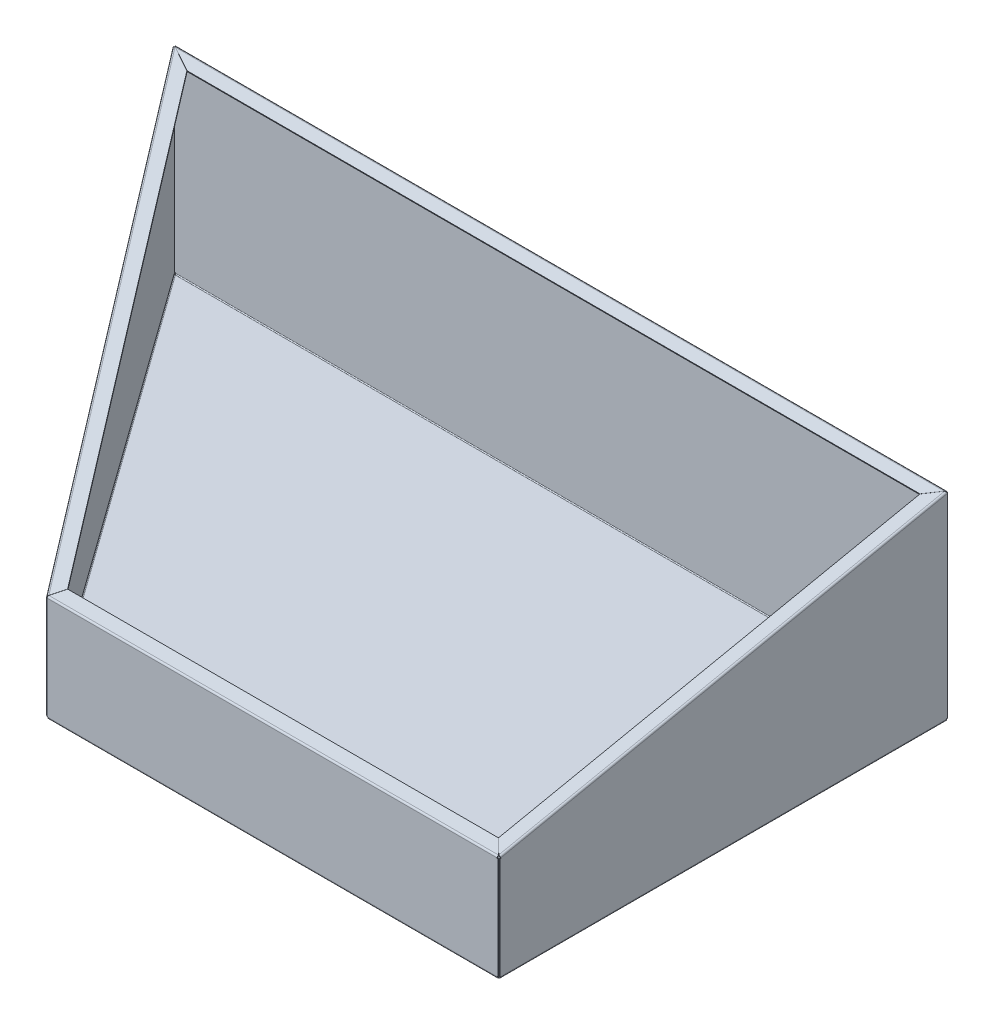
ISO-10303-21;
HEADER;
FILE_DESCRIPTION(('STEP AP214'),'2;1');
FILE_NAME('part.step','',(''),(''),'','','');
FILE_SCHEMA(('AUTOMOTIVE_DESIGN { 1 0 10303 214 1 1 1 1 }'));
ENDSEC;
DATA;
#1=APPLICATION_CONTEXT('core data for automotive mechanical design processes');
#2=APPLICATION_PROTOCOL_DEFINITION('international standard','automotive_design',2000,#1);
#3=PRODUCT_CONTEXT('',#1,'mechanical');
#4=PRODUCT('Part','Part','',(#3));
#5=PRODUCT_RELATED_PRODUCT_CATEGORY('part','',(#4));
#6=PRODUCT_DEFINITION_FORMATION('','',#4);
#7=PRODUCT_DEFINITION_CONTEXT('part definition',#1,'design');
#8=PRODUCT_DEFINITION('design','',#6,#7);
#9=PRODUCT_DEFINITION_SHAPE('','',#8);
#10=(LENGTH_UNIT() NAMED_UNIT(*) SI_UNIT(.MILLI.,.METRE.));
#11=(NAMED_UNIT(*) PLANE_ANGLE_UNIT() SI_UNIT($,.RADIAN.));
#12=(NAMED_UNIT(*) SI_UNIT($,.STERADIAN.) SOLID_ANGLE_UNIT());
#13=UNCERTAINTY_MEASURE_WITH_UNIT(LENGTH_MEASURE(1.E-05),#10,'distance_accuracy_value','');
#14=(GEOMETRIC_REPRESENTATION_CONTEXT(3) GLOBAL_UNCERTAINTY_ASSIGNED_CONTEXT((#13)) GLOBAL_UNIT_ASSIGNED_CONTEXT((#10,
#11,#12)) REPRESENTATION_CONTEXT('',''));
#15=CARTESIAN_POINT('',(0.,0.,0.));
#16=DIRECTION('',(0.,0.,1.));
#17=DIRECTION('',(1.,0.,0.));
#18=AXIS2_PLACEMENT_3D('',#15,#16,#17);
#19=CARTESIAN_POINT('',(359.227664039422,-104.112916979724,504.080897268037));
#20=DIRECTION('',(-0.887315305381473,0.0932798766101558,-0.451630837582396));
#21=DIRECTION('',(0.461163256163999,0.179478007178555,-0.868974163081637));
#22=AXIS2_PLACEMENT_3D('',#19,#20,#21);
#23=PLANE('',#22);
#24=CARTESIAN_POINT('',(360.623664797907,-103.56961386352,501.450400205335));
#25=CARTESIAN_POINT('',(360.623664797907,-102.590284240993,501.652671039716));
#26=B_SPLINE_CURVE_WITH_KNOTS('',1,(#24,#25),.UNSPECIFIED.,.F.,.F.,(2,2),(0.,1.),.UNSPECIFIED.);
#27=CARTESIAN_POINT('',(360.623664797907,-103.56961386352,501.450400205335));
#28=VERTEX_POINT('',#27);
#29=CARTESIAN_POINT('',(360.623664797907,-102.590284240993,501.652671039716));
#30=VERTEX_POINT('',#29);
#31=EDGE_CURVE('E11',#28,#30,#26,.T.);
#32=ORIENTED_EDGE('',*,*,#31,.F.);
#33=DIRECTION('',(0.461163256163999,0.179478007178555,-0.868974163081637));
#34=VECTOR('',#33,1.);
#35=CARTESIAN_POINT('',(359.227664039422,-104.112916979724,504.080897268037));
#36=LINE('',#35,#34);
#37=CARTESIAN_POINT('',(367.931919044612,-100.725347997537,487.679389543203));
#38=VERTEX_POINT('',#37);
#39=EDGE_CURVE('E672',#38,#28,#36,.F.);
#40=ORIENTED_EDGE('',*,*,#39,.F.);
#41=DIRECTION('',(0.,0.979329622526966,0.20227083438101));
#42=VECTOR('',#41,1.);
#43=CARTESIAN_POINT('',(367.931919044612,-100.725347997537,487.679389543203));
#44=LINE('',#43,#42);
#45=CARTESIAN_POINT('',(367.931919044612,-99.7460183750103,487.881660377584));
#46=VERTEX_POINT('',#45);
#47=EDGE_CURVE('E49',#38,#46,#44,.T.);
#48=ORIENTED_EDGE('',*,*,#47,.T.);
#49=DIRECTION('',(0.461163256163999,0.179478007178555,-0.868974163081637));
#50=VECTOR('',#49,1.);
#51=CARTESIAN_POINT('',(359.227664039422,-103.133587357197,504.283168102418));
#52=LINE('',#51,#50);
#53=EDGE_CURVE('E1290',#46,#30,#52,.F.);
#54=ORIENTED_EDGE('',*,*,#53,.T.);
#55=EDGE_LOOP('',(#32,#40,#48,#54));
#56=FACE_BOUND('',#55,.T.);
#57=ADVANCED_FACE('F35',(#56),#23,.F.);
#58=CARTESIAN_POINT('',(28.7053588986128,-3.0067668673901,14.557787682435));
#59=DIRECTION('',(0.818394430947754,0.116236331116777,-0.562778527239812));
#60=DIRECTION('',(0.574656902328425,-0.165537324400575,0.801477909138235));
#61=AXIS2_PLACEMENT_3D('',#58,#59,#60);
#62=PLANE('',#61);
#63=ORIENTED_EDGE('',*,*,#47,.F.);
#64=DIRECTION('',(0.574656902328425,-0.165537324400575,0.801477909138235));
#65=VECTOR('',#64,1.);
#66=CARTESIAN_POINT('',(28.7053588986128,-3.0067668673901,14.557787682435));
#67=LINE('',#66,#65);
#68=CARTESIAN_POINT('',(28.8273111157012,-3.041896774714,14.7278752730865));
#69=VERTEX_POINT('',#68);
#70=EDGE_CURVE('E646',#69,#38,#67,.T.);
#71=ORIENTED_EDGE('',*,*,#70,.F.);
#72=DIRECTION('',(0.,0.979329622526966,0.20227083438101));
#73=VECTOR('',#72,1.);
#74=CARTESIAN_POINT('',(28.8273111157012,-3.041896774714,14.7278752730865));
#75=LINE('',#74,#73);
#76=CARTESIAN_POINT('',(28.8273111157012,-2.06256715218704,14.9301461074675));
#77=VERTEX_POINT('',#76);
#78=EDGE_CURVE('E262',#69,#77,#75,.T.);
#79=ORIENTED_EDGE('',*,*,#78,.T.);
#80=DIRECTION('',(0.574656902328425,-0.165537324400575,0.801477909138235));
#81=VECTOR('',#80,1.);
#82=CARTESIAN_POINT('',(28.7053588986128,-2.02743724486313,14.760058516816));
#83=LINE('',#82,#81);
#84=EDGE_CURVE('E654',#77,#46,#83,.T.);
#85=ORIENTED_EDGE('',*,*,#84,.T.);
#86=EDGE_LOOP('',(#63,#71,#79,#85));
#87=FACE_BOUND('',#86,.T.);
#88=ADVANCED_FACE('F628',(#87),#62,.T.);
#89=CARTESIAN_POINT('',(29.0156148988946,-3.06169239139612,14.8237192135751));
#90=DIRECTION('',(-0.461163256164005,-0.179478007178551,0.868974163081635));
#91=DIRECTION('',(-0.887315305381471,0.0932798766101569,-0.451630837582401));
#92=AXIS2_PLACEMENT_3D('',#89,#90,#91);
#93=PLANE('',#92);
#94=ORIENTED_EDGE('',*,*,#78,.F.);
#95=DIRECTION('',(-0.887315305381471,0.0932798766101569,-0.451630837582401));
#96=VECTOR('',#95,1.);
#97=CARTESIAN_POINT('',(29.0156148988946,-3.06169239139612,14.8237192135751));
#98=LINE('',#97,#96);
#99=CARTESIAN_POINT('',(1.7715223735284,-0.19763090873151,0.956864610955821));
#100=VERTEX_POINT('',#99);
#101=EDGE_CURVE('E639',#100,#69,#98,.F.);
#102=ORIENTED_EDGE('',*,*,#101,.F.);
#103=DIRECTION('',(0.,0.979329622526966,0.20227083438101));
#104=VECTOR('',#103,1.);
#105=CARTESIAN_POINT('',(1.7715223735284,-0.19763090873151,0.956864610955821));
#106=LINE('',#105,#104);
#107=CARTESIAN_POINT('',(1.7715223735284,0.781698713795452,1.15913544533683));
#108=VERTEX_POINT('',#107);
#109=EDGE_CURVE('E600',#100,#108,#106,.T.);
#110=ORIENTED_EDGE('',*,*,#109,.T.);
#111=DIRECTION('',(-0.887315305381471,0.0932798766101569,-0.451630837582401));
#112=VECTOR('',#111,1.);
#113=CARTESIAN_POINT('',(29.0156148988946,-2.08236276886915,15.0259900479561));
#114=LINE('',#113,#112);
#115=EDGE_CURVE('E641',#108,#77,#114,.F.);
#116=ORIENTED_EDGE('',*,*,#115,.T.);
#117=EDGE_LOOP('',(#94,#102,#110,#116));
#118=FACE_BOUND('',#117,.T.);
#119=ADVANCED_FACE('F630',(#118),#93,.F.);
#120=CARTESIAN_POINT('',(286.838756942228,-82.3149205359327,398.542084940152));
#121=DIRECTION('',(-0.818394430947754,-0.116236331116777,0.562778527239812));
#122=DIRECTION('',(-0.574656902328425,0.165537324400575,-0.801477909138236));
#123=AXIS2_PLACEMENT_3D('',#120,#121,#122);
#124=PLANE('',#123);
#125=ORIENTED_EDGE('',*,*,#109,.F.);
#126=DIRECTION('',(-0.574656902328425,0.165537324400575,-0.801477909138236));
#127=VECTOR('',#126,1.);
#128=CARTESIAN_POINT('',(286.838756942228,-82.3149205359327,398.542084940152));
#129=LINE('',#128,#127);
#130=CARTESIAN_POINT('',(1.94747779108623,-0.248317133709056,1.20227083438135));
#131=VERTEX_POINT('',#130);
#132=EDGE_CURVE('E515',#131,#100,#129,.T.);
#133=ORIENTED_EDGE('',*,*,#132,.F.);
#134=CARTESIAN_POINT('',(1.94747779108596,0.73101248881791,1.40454166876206));
#135=CARTESIAN_POINT('',(1.94747779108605,-0.248317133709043,1.20227083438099));
#136=B_SPLINE_CURVE_WITH_KNOTS('',1,(#134,#135),.UNSPECIFIED.,.F.,.F.,(2,2),(0.,1.),.UNSPECIFIED.);
#137=CARTESIAN_POINT('',(1.94747779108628,0.731012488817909,1.40454166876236));
#138=VERTEX_POINT('',#137);
#139=EDGE_CURVE('E586',#131,#138,#136,.F.);
#140=ORIENTED_EDGE('',*,*,#139,.T.);
#141=DIRECTION('',(-0.574656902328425,0.165537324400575,-0.801477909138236));
#142=VECTOR('',#141,1.);
#143=CARTESIAN_POINT('',(286.838756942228,-81.3355909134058,398.744355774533));
#144=LINE('',#143,#142);
#145=EDGE_CURVE('E1357',#138,#108,#144,.T.);
#146=ORIENTED_EDGE('',*,*,#145,.T.);
#147=EDGE_LOOP('',(#125,#133,#140,#146));
#148=FACE_BOUND('',#147,.T.);
#149=ADVANCED_FACE('F546',(#148),#124,.T.);
#150=CARTESIAN_POINT('',(-0.727037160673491,-0.925430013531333,0.702156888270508));
#151=CARTESIAN_POINT('',(-0.71807937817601,-0.739677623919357,0.714650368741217));
#152=CARTESIAN_POINT('',(-0.675884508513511,-0.579043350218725,0.730182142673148));
#153=CARTESIAN_POINT('',(-0.552718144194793,-0.303162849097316,0.774771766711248));
#154=CARTESIAN_POINT('',(-0.471652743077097,-0.187811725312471,0.803803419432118));
#155=CARTESIAN_POINT('',(-0.287277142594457,0.00825162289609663,0.876211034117));
#156=CARTESIAN_POINT('',(-0.183856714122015,0.0890922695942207,0.919534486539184));
#157=CARTESIAN_POINT('',(0.0364160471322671,0.22763611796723,1.01592593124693));
#158=CARTESIAN_POINT('',(0.153346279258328,0.285392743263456,1.06894910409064));
#159=CARTESIAN_POINT('',(0.396605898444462,0.387240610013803,1.17629372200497));
#160=CARTESIAN_POINT('',(0.522984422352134,0.431369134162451,1.23058763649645));
#161=CARTESIAN_POINT('',(0.784016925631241,0.512246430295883,1.32928356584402));
#162=CARTESIAN_POINT('',(0.918711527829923,0.549050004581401,1.37366777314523));
#163=CARTESIAN_POINT('',(1.19690585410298,0.617108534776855,1.43924862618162));
#164=CARTESIAN_POINT('',(1.34047058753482,0.64845021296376,1.46041657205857));
#165=CARTESIAN_POINT('',(1.63714767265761,0.700875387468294,1.46476572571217));
#166=CARTESIAN_POINT('',(1.790309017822,0.722058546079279,1.44789374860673));
#167=CARTESIAN_POINT('',(1.94747779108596,0.73101248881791,1.40454166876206));
#168=CARTESIAN_POINT('',(0.0856530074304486,-0.925430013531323,0.119460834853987));
#169=CARTESIAN_POINT('',(0.0856530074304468,-0.831265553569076,0.119460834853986));
#170=CARTESIAN_POINT('',(0.109653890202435,-0.751782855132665,0.131276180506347));
#171=CARTESIAN_POINT('',(0.188720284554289,-0.618878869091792,0.177954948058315));
#172=CARTESIAN_POINT('',(0.243837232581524,-0.565404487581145,0.212811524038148));
#173=CARTESIAN_POINT('',(0.373817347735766,-0.478259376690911,0.301724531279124));
#174=CARTESIAN_POINT('',(0.448735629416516,-0.444524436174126,0.355754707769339));
#175=CARTESIAN_POINT('',(0.610850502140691,-0.390225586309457,0.476445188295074));
#176=CARTESIAN_POINT('',(0.698086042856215,-0.369634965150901,0.543083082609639));
#177=CARTESIAN_POINT('',(0.879757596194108,-0.336006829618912,0.680496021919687));
#178=CARTESIAN_POINT('',(0.974218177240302,-0.322950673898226,0.751257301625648));
#179=CARTESIAN_POINT('',(1.16671649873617,-0.300366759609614,0.88705208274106));
#180=CARTESIAN_POINT('',(1.26477455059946,-0.29081159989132,0.952076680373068));
#181=CARTESIAN_POINT('',(1.46167118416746,-0.273432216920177,1.06548042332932));
#182=CARTESIAN_POINT('',(1.56054227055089,-0.265564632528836,1.11384521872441));
#183=CARTESIAN_POINT('',(1.7563747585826,-0.2530332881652,1.18225992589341));
#184=CARTESIAN_POINT('',(1.85336510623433,-0.248317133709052,1.20227083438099));
#185=CARTESIAN_POINT('',(1.94747779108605,-0.248317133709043,1.20227083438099));
#186=B_SPLINE_SURFACE_WITH_KNOTS('',1,3,((#150,#151,#152,#153,#154,#155,#156,#157,#158,#159,
#160,#161,#162,#163,#164,#165,#166,#167),(#168,#169,#170,#171,#172,#173,#174,#175,#176,#177,
#178,#179,#180,#181,#182,#183,#184,#185)),.UNSPECIFIED.,.F.,.F.,.F.,(2,2),(4,2,2,2,2,2,2,2,4),
(0.,1.),(0.,0.125,0.25,0.375,0.5,0.625,0.75,0.875,1.),.UNSPECIFIED.);
#187=CARTESIAN_POINT('',(1.94747779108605,-0.248317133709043,1.20227083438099));
#188=CARTESIAN_POINT('',(1.85336510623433,-0.248317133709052,1.20227083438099));
#189=CARTESIAN_POINT('',(1.7563747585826,-0.2530332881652,1.18225992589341));
#190=CARTESIAN_POINT('',(1.56054227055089,-0.265564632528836,1.11384521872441));
#191=CARTESIAN_POINT('',(1.46167118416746,-0.273432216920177,1.06548042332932));
#192=CARTESIAN_POINT('',(1.26477455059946,-0.29081159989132,0.952076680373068));
#193=CARTESIAN_POINT('',(1.16671649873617,-0.300366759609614,0.88705208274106));
#194=CARTESIAN_POINT('',(0.974218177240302,-0.322950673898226,0.751257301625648));
#195=CARTESIAN_POINT('',(0.879757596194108,-0.336006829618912,0.680496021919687));
#196=CARTESIAN_POINT('',(0.698086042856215,-0.369634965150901,0.543083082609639));
#197=CARTESIAN_POINT('',(0.610850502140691,-0.390225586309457,0.476445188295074));
#198=CARTESIAN_POINT('',(0.448735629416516,-0.444524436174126,0.355754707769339));
#199=CARTESIAN_POINT('',(0.373817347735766,-0.478259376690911,0.301724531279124));
#200=CARTESIAN_POINT('',(0.243837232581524,-0.565404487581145,0.212811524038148));
#201=CARTESIAN_POINT('',(0.188720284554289,-0.618878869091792,0.177954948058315));
#202=CARTESIAN_POINT('',(0.109653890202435,-0.751782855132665,0.131276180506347));
#203=CARTESIAN_POINT('',(0.0856530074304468,-0.831265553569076,0.119460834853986));
#204=CARTESIAN_POINT('',(0.0856530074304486,-0.925430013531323,0.119460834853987));
#205=B_SPLINE_CURVE_WITH_KNOTS('',3,(#187,#188,#189,#190,#191,#192,#193,#194,#195,#196,#197,
#198,#199,#200,#201,#202,#203,#204),.UNSPECIFIED.,.F.,.F.,(4,2,2,2,2,2,2,2,4),(0.,0.125,0.25,
0.375,0.5,0.625,0.75,0.875,1.),.UNSPECIFIED.);
#206=CARTESIAN_POINT('',(0.0856530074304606,-0.925430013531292,0.119460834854));
#207=VERTEX_POINT('',#206);
#208=EDGE_CURVE('E1245',#131,#207,#205,.T.);
#209=CARTESIAN_POINT('',(0.0856530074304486,-0.925430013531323,0.119460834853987));
#210=CARTESIAN_POINT('',(-0.727037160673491,-0.925430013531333,0.702156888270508));
#211=B_SPLINE_CURVE_WITH_KNOTS('',1,(#209,#210),.UNSPECIFIED.,.F.,.F.,(2,2),(0.,1.),.UNSPECIFIED.);
#212=CARTESIAN_POINT('',(-0.727037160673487,-0.925430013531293,0.702156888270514));
#213=VERTEX_POINT('',#212);
#214=EDGE_CURVE('E246',#207,#213,#211,.T.);
#215=CARTESIAN_POINT('',(-0.727037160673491,-0.925430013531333,0.702156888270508));
#216=CARTESIAN_POINT('',(-0.71807937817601,-0.739677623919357,0.714650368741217));
#217=CARTESIAN_POINT('',(-0.675884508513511,-0.579043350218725,0.730182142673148));
#218=CARTESIAN_POINT('',(-0.552718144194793,-0.303162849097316,0.774771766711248));
#219=CARTESIAN_POINT('',(-0.471652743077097,-0.187811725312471,0.803803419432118));
#220=CARTESIAN_POINT('',(-0.287277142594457,0.00825162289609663,0.876211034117));
#221=CARTESIAN_POINT('',(-0.183856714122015,0.0890922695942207,0.919534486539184));
#222=CARTESIAN_POINT('',(0.0364160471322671,0.22763611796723,1.01592593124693));
#223=CARTESIAN_POINT('',(0.153346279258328,0.285392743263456,1.06894910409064));
#224=CARTESIAN_POINT('',(0.396605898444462,0.387240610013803,1.17629372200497));
#225=CARTESIAN_POINT('',(0.522984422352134,0.431369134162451,1.23058763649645));
#226=CARTESIAN_POINT('',(0.784016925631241,0.512246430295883,1.32928356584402));
#227=CARTESIAN_POINT('',(0.918711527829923,0.549050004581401,1.37366777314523));
#228=CARTESIAN_POINT('',(1.19690585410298,0.617108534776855,1.43924862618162));
#229=CARTESIAN_POINT('',(1.34047058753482,0.64845021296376,1.46041657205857));
#230=CARTESIAN_POINT('',(1.63714767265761,0.700875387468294,1.46476572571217));
#231=CARTESIAN_POINT('',(1.790309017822,0.722058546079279,1.44789374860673));
#232=CARTESIAN_POINT('',(1.94747779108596,0.73101248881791,1.40454166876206));
#233=B_SPLINE_CURVE_WITH_KNOTS('',3,(#215,#216,#217,#218,#219,#220,#221,#222,#223,#224,#225,
#226,#227,#228,#229,#230,#231,#232),.UNSPECIFIED.,.F.,.F.,(4,2,2,2,2,2,2,2,4),(0.,0.125,0.25,
0.375,0.5,0.625,0.75,0.875,1.),.UNSPECIFIED.);
#234=EDGE_CURVE('E511',#138,#213,#233,.F.);
#235=ORIENTED_EDGE('',*,*,#139,.F.);
#236=ORIENTED_EDGE('',*,*,#208,.T.);
#237=ORIENTED_EDGE('',*,*,#214,.T.);
#238=ORIENTED_EDGE('',*,*,#234,.F.);
#239=EDGE_LOOP('',(#235,#236,#237,#238));
#240=FACE_BOUND('',#239,.T.);
#241=ADVANCED_FACE('F533',(#240),#186,.F.);
#242=CARTESIAN_POINT('',(0.0856530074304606,-1779.3663984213,0.119460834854));
#243=DIRECTION('',(0.582696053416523,0.,0.812690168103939));
#244=DIRECTION('',(0.,1.,0.));
#245=AXIS2_PLACEMENT_3D('',#242,#243,#244);
#246=PLANE('',#245);
#247=ORIENTED_EDGE('',*,*,#214,.F.);
#248=DIRECTION('',(0.,1.,0.));
#249=VECTOR('',#248,1.);
#250=CARTESIAN_POINT('',(0.0856530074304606,-1779.3663984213,0.119460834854));
#251=LINE('',#250,#249);
#252=CARTESIAN_POINT('',(0.0856530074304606,-219.554717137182,0.119460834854));
#253=VERTEX_POINT('',#252);
#254=EDGE_CURVE('E1066',#253,#207,#251,.T.);
#255=ORIENTED_EDGE('',*,*,#254,.F.);
#256=DIRECTION('',(-0.812690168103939,0.,0.582696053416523));
#257=VECTOR('',#256,1.);
#258=CARTESIAN_POINT('',(0.0856530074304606,-219.554717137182,0.119460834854));
#259=LINE('',#258,#257);
#260=CARTESIAN_POINT('',(-0.727037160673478,-219.554717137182,0.702156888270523));
#261=VERTEX_POINT('',#260);
#262=EDGE_CURVE('E1243',#253,#261,#259,.T.);
#263=ORIENTED_EDGE('',*,*,#262,.T.);
#264=DIRECTION('',(0.,1.,0.));
#265=VECTOR('',#264,1.);
#266=CARTESIAN_POINT('',(-0.727037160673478,-1779.3663984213,0.702156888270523));
#267=LINE('',#266,#265);
#268=EDGE_CURVE('E1256',#261,#213,#267,.T.);
#269=ORIENTED_EDGE('',*,*,#268,.T.);
#270=EDGE_LOOP('',(#247,#255,#263,#269));
#271=FACE_BOUND('',#270,.T.);
#272=ADVANCED_FACE('F545',(#271),#246,.F.);
#273=CARTESIAN_POINT('',(0.,-219.554717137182,0.));
#274=DIRECTION('',(0.,-1.,0.));
#275=DIRECTION('',(0.582696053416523,0.,0.812690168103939));
#276=AXIS2_PLACEMENT_3D('',#273,#274,#275);
#277=PLANE('',#276);
#278=ORIENTED_EDGE('',*,*,#262,.F.);
#279=DIRECTION('',(0.582696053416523,0.,0.812690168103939));
#280=VECTOR('',#279,1.);
#281=CARTESIAN_POINT('',(0.,-219.554717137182,0.));
#282=LINE('',#281,#280);
#283=CARTESIAN_POINT('',(0.716996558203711,-219.554717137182,0.999999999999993));
#284=VERTEX_POINT('',#283);
#285=EDGE_CURVE('E518',#253,#284,#282,.T.);
#286=ORIENTED_EDGE('',*,*,#285,.T.);
#287=DIRECTION('',(-0.812690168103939,0.,0.582696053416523));
#288=VECTOR('',#287,1.);
#289=CARTESIAN_POINT('',(0.716996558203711,-219.554717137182,0.999999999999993));
#290=LINE('',#289,#288);
#291=CARTESIAN_POINT('',(-0.0956936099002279,-219.554717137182,1.58269605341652));
#292=VERTEX_POINT('',#291);
#293=EDGE_CURVE('E1242',#284,#292,#290,.T.);
#294=ORIENTED_EDGE('',*,*,#293,.T.);
#295=DIRECTION('',(0.582696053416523,0.,0.812690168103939));
#296=VECTOR('',#295,1.);
#297=CARTESIAN_POINT('',(-0.812690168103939,-219.554717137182,0.582696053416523));
#298=LINE('',#297,#296);
#299=EDGE_CURVE('E1392',#261,#292,#298,.T.);
#300=ORIENTED_EDGE('',*,*,#299,.F.);
#301=EDGE_LOOP('',(#278,#286,#294,#300));
#302=FACE_BOUND('',#301,.T.);
#303=ADVANCED_FACE('F1882',(#302),#277,.T.);
#304=CARTESIAN_POINT('',(0.716996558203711,-1779.3663984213,0.999999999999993));
#305=DIRECTION('',(0.582696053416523,0.,0.812690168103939));
#306=DIRECTION('',(0.,1.,0.));
#307=AXIS2_PLACEMENT_3D('',#304,#305,#306);
#308=PLANE('',#307);
#309=ORIENTED_EDGE('',*,*,#293,.F.);
#310=DIRECTION('',(0.,1.,0.));
#311=VECTOR('',#310,1.);
#312=CARTESIAN_POINT('',(0.716996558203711,-1779.3663984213,0.999999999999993));
#313=LINE('',#312,#311);
#314=CARTESIAN_POINT('',(0.716996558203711,-220.044816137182,0.999999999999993));
#315=VERTEX_POINT('',#314);
#316=EDGE_CURVE('E724',#315,#284,#313,.T.);
#317=ORIENTED_EDGE('',*,*,#316,.F.);
#318=DIRECTION('',(-0.812690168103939,0.,0.582696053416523));
#319=VECTOR('',#318,1.);
#320=CARTESIAN_POINT('',(0.716996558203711,-220.044816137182,0.999999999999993));
#321=LINE('',#320,#319);
#322=CARTESIAN_POINT('',(-0.0956936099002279,-220.044816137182,1.58269605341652));
#323=VERTEX_POINT('',#322);
#324=EDGE_CURVE('E1240',#315,#323,#321,.T.);
#325=ORIENTED_EDGE('',*,*,#324,.T.);
#326=DIRECTION('',(0.,1.,0.));
#327=VECTOR('',#326,1.);
#328=CARTESIAN_POINT('',(-0.0956936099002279,-1779.3663984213,1.58269605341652));
#329=LINE('',#328,#327);
#330=EDGE_CURVE('E1380',#323,#292,#329,.T.);
#331=ORIENTED_EDGE('',*,*,#330,.T.);
#332=EDGE_LOOP('',(#309,#317,#325,#331));
#333=FACE_BOUND('',#332,.T.);
#334=ADVANCED_FACE('F1875',(#333),#308,.F.);
#335=CARTESIAN_POINT('',(0.716996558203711,-220.044816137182,0.999999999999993));
#336=CARTESIAN_POINT('',(0.446099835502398,-220.044816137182,1.1942320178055));
#337=CARTESIAN_POINT('',(0.175203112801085,-220.044816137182,1.38846403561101));
#338=CARTESIAN_POINT('',(-0.0956936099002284,-220.044816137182,1.58269605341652));
#339=CARTESIAN_POINT('',(0.716996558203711,-222.044816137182,0.999999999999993));
#340=CARTESIAN_POINT('',(0.446099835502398,-222.711482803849,1.1942320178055));
#341=CARTESIAN_POINT('',(0.175203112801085,-223.378149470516,1.38846403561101));
#342=CARTESIAN_POINT('',(-0.0956936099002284,-224.044816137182,1.58269605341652));
#343=CARTESIAN_POINT('',(3.17795902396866,-222.044816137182,0.999999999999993));
#344=CARTESIAN_POINT('',(3.44885574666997,-222.711482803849,0.805767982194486));
#345=CARTESIAN_POINT('',(3.71975246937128,-223.378149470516,0.611535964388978));
#346=CARTESIAN_POINT('',(3.9906491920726,-224.044816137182,0.41730394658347));
#347=CARTESIAN_POINT('',(3.17795902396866,-220.044816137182,0.999999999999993));
#348=CARTESIAN_POINT('',(3.44885574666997,-220.044816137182,0.805767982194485));
#349=CARTESIAN_POINT('',(3.71975246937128,-220.044816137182,0.611535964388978));
#350=CARTESIAN_POINT('',(3.9906491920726,-220.044816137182,0.41730394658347));
#351=CARTESIAN_POINT('',(3.17795902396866,-218.044816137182,0.999999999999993));
#352=CARTESIAN_POINT('',(3.44885574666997,-217.378149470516,0.805767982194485));
#353=CARTESIAN_POINT('',(3.71975246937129,-216.711482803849,0.611535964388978));
#354=CARTESIAN_POINT('',(3.9906491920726,-216.044816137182,0.41730394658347));
#355=CARTESIAN_POINT('',(0.716996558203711,-218.044816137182,0.999999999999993));
#356=CARTESIAN_POINT('',(0.446099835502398,-217.378149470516,1.1942320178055));
#357=CARTESIAN_POINT('',(0.175203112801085,-216.711482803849,1.38846403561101));
#358=CARTESIAN_POINT('',(-0.0956936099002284,-216.044816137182,1.58269605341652));
#359=CARTESIAN_POINT('',(0.716996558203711,-220.044816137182,0.999999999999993));
#360=CARTESIAN_POINT('',(0.446099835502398,-220.044816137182,1.1942320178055));
#361=CARTESIAN_POINT('',(0.175203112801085,-220.044816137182,1.38846403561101));
#362=CARTESIAN_POINT('',(-0.0956936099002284,-220.044816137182,1.58269605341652));
#363=(BOUNDED_SURFACE() B_SPLINE_SURFACE(3,3,((#335,#336,#337,#338),(#339,#340,#341,#342),(#343,
#344,#345,#346),(#347,#348,#349,#350),(#351,#352,#353,#354),(#355,#356,#357,#358),(#359,#360,
#361,#362)),.UNSPECIFIED.,.T.,.F.,.F.) B_SPLINE_SURFACE_WITH_KNOTS((4,3,4),(4,4),(0.,0.5,1.),
(0.,1.),.UNSPECIFIED.) GEOMETRIC_REPRESENTATION_ITEM() RATIONAL_B_SPLINE_SURFACE(((1.,1.,1.,1.),
(0.333333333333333,0.333333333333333,0.333333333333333,0.333333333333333),(0.333333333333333,
0.333333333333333,0.333333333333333,0.333333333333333),(1.,1.,1.,1.),(0.333333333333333,
0.333333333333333,0.333333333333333,0.333333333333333),(0.333333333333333,0.333333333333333,
0.333333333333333,0.333333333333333),(1.,1.,1.,1.))) REPRESENTATION_ITEM('') SURFACE());
#364=CARTESIAN_POINT('',(1.94747779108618,-220.044816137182,0.999999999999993));
#365=DIRECTION('',(0.,0.,1.));
#366=DIRECTION('',(-1.,0.,0.));
#367=AXIS2_PLACEMENT_3D('',#364,#365,#366);
#368=ELLIPSE('',#367,1.23048123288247,1.);
#369=CARTESIAN_POINT('',(1.94747779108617,-221.044816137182,0.999999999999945));
#370=VERTEX_POINT('',#369);
#371=EDGE_CURVE('E756',#315,#370,#368,.T.);
#372=DIRECTION('',(0.,-1.,0.));
#373=VECTOR('',#372,1.);
#374=CARTESIAN_POINT('',(1.94747779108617,-221.044816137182,0.999999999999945));
#375=LINE('',#374,#373);
#376=CARTESIAN_POINT('',(1.94747779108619,-222.044816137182,0.999999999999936));
#377=VERTEX_POINT('',#376);
#378=EDGE_CURVE('E1238',#370,#377,#375,.T.);
#379=CARTESIAN_POINT('',(1.94747779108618,-220.044816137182,0.999999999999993));
#380=DIRECTION('',(0.274256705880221,0.,0.961656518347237));
#381=DIRECTION('',(-0.961656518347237,0.,0.274256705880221));
#382=AXIS2_PLACEMENT_3D('',#379,#380,#381);
#383=ELLIPSE('',#382,2.12463739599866,2.);
#384=EDGE_CURVE('E1386',#323,#377,#383,.T.);
#385=ORIENTED_EDGE('',*,*,#324,.F.);
#386=ORIENTED_EDGE('',*,*,#371,.T.);
#387=ORIENTED_EDGE('',*,*,#378,.T.);
#388=ORIENTED_EDGE('',*,*,#384,.F.);
#389=EDGE_LOOP('',(#385,#386,#387,#388));
#390=FACE_BOUND('',#389,.T.);
#391=ADVANCED_FACE('F1745',(#390),#363,.T.);
#392=CARTESIAN_POINT('',(1.23048123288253,-220.044816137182,-1.));
#393=CARTESIAN_POINT('',(1.23048123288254,-220.044816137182,-0.666666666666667));
#394=CARTESIAN_POINT('',(1.23048123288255,-220.044816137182,-0.333333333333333));
#395=CARTESIAN_POINT('',(1.23048123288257,-220.044816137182,0.));
#396=CARTESIAN_POINT('',(1.23048123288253,-216.044816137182,-1.));
#397=CARTESIAN_POINT('',(1.23048123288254,-216.711482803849,-0.666666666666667));
#398=CARTESIAN_POINT('',(1.23048123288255,-217.378149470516,-0.333333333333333));
#399=CARTESIAN_POINT('',(1.23048123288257,-218.044816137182,0.));
#400=CARTESIAN_POINT('',(2.66447434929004,-216.044816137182,3.));
#401=CARTESIAN_POINT('',(2.66447434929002,-216.711482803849,2.66666666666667));
#402=CARTESIAN_POINT('',(2.66447434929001,-217.378149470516,2.33333333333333));
#403=CARTESIAN_POINT('',(2.66447434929,-218.044816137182,2.));
#404=CARTESIAN_POINT('',(2.66447434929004,-220.044816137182,3.));
#405=CARTESIAN_POINT('',(2.66447434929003,-220.044816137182,2.66666666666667));
#406=CARTESIAN_POINT('',(2.66447434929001,-220.044816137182,2.33333333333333));
#407=CARTESIAN_POINT('',(2.66447434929,-220.044816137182,2.));
#408=CARTESIAN_POINT('',(2.66447434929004,-224.044816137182,3.));
#409=CARTESIAN_POINT('',(2.66447434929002,-223.378149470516,2.66666666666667));
#410=CARTESIAN_POINT('',(2.66447434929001,-222.711482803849,2.33333333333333));
#411=CARTESIAN_POINT('',(2.66447434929,-222.044816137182,2.));
#412=CARTESIAN_POINT('',(1.23048123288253,-224.044816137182,-1.));
#413=CARTESIAN_POINT('',(1.23048123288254,-223.378149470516,-0.666666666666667));
#414=CARTESIAN_POINT('',(1.23048123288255,-222.711482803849,-0.333333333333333));
#415=CARTESIAN_POINT('',(1.23048123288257,-222.044816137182,0.));
#416=CARTESIAN_POINT('',(1.23048123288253,-220.044816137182,-1.));
#417=CARTESIAN_POINT('',(1.23048123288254,-220.044816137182,-0.666666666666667));
#418=CARTESIAN_POINT('',(1.23048123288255,-220.044816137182,-0.333333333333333));
#419=CARTESIAN_POINT('',(1.23048123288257,-220.044816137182,0.));
#420=(BOUNDED_SURFACE() B_SPLINE_SURFACE(3,3,((#392,#393,#394,#395),(#396,#397,#398,#399),(#400,
#401,#402,#403),(#404,#405,#406,#407),(#408,#409,#410,#411),(#412,#413,#414,#415),(#416,#417,
#418,#419)),.UNSPECIFIED.,.T.,.F.,.F.) B_SPLINE_SURFACE_WITH_KNOTS((4,3,4),(4,4),(0.,0.5,1.),
(0.,1.),.UNSPECIFIED.) GEOMETRIC_REPRESENTATION_ITEM() RATIONAL_B_SPLINE_SURFACE(((1.,1.,1.,1.),
(0.333333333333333,0.333333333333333,0.333333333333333,0.333333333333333),(0.333333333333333,
0.333333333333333,0.333333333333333,0.333333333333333),(1.,1.,1.,1.),(0.333333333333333,
0.333333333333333,0.333333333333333,0.333333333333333),(0.333333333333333,0.333333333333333,
0.333333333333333,0.333333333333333),(1.,1.,1.,1.))) REPRESENTATION_ITEM('') SURFACE());
#421=CARTESIAN_POINT('',(1.94747779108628,-220.044816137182,1.));
#422=DIRECTION('',(-0.812690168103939,0.,0.582696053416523));
#423=DIRECTION('',(-0.582696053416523,0.,-0.812690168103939));
#424=AXIS2_PLACEMENT_3D('',#421,#422,#423);
#425=ELLIPSE('',#424,1.23048123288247,1.);
#426=CARTESIAN_POINT('',(1.23048123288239,-220.044816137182,0.));
#427=VERTEX_POINT('',#426);
#428=EDGE_CURVE('E752',#370,#427,#425,.F.);
#429=DIRECTION('',(0.,0.,-1.));
#430=VECTOR('',#429,1.);
#431=CARTESIAN_POINT('',(1.23048123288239,-220.044816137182,0.));
#432=LINE('',#431,#430);
#433=CARTESIAN_POINT('',(1.23048123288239,-220.044816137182,-1.));
#434=VERTEX_POINT('',#433);
#435=EDGE_CURVE('E1236',#427,#434,#432,.T.);
#436=CARTESIAN_POINT('',(1.94747779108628,-220.044816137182,1.));
#437=DIRECTION('',(-0.94133709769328,0.,0.337467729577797));
#438=DIRECTION('',(-0.337467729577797,0.,-0.94133709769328));
#439=AXIS2_PLACEMENT_3D('',#436,#437,#438);
#440=ELLIPSE('',#439,2.12463739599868,2.);
#441=EDGE_CURVE('E1366',#377,#434,#440,.F.);
#442=ORIENTED_EDGE('',*,*,#378,.F.);
#443=ORIENTED_EDGE('',*,*,#428,.T.);
#444=ORIENTED_EDGE('',*,*,#435,.T.);
#445=ORIENTED_EDGE('',*,*,#441,.F.);
#446=EDGE_LOOP('',(#442,#443,#444,#445));
#447=FACE_BOUND('',#446,.T.);
#448=ADVANCED_FACE('F1749',(#447),#420,.F.);
#449=CARTESIAN_POINT('',(1.23048123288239,0.,0.));
#450=DIRECTION('',(1.,0.,0.));
#451=DIRECTION('',(0.,1.,0.));
#452=AXIS2_PLACEMENT_3D('',#449,#450,#451);
#453=PLANE('',#452);
#454=ORIENTED_EDGE('',*,*,#435,.F.);
#455=DIRECTION('',(0.,1.,0.));
#456=VECTOR('',#455,1.);
#457=CARTESIAN_POINT('',(1.23048123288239,0.,0.));
#458=LINE('',#457,#456);
#459=CARTESIAN_POINT('',(1.23048123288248,-219.554717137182,0.));
#460=VERTEX_POINT('',#459);
#461=EDGE_CURVE('E725',#427,#460,#458,.T.);
#462=ORIENTED_EDGE('',*,*,#461,.T.);
#463=DIRECTION('',(0.,0.,-1.));
#464=VECTOR('',#463,1.);
#465=CARTESIAN_POINT('',(1.23048123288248,-219.554717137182,0.));
#466=LINE('',#465,#464);
#467=CARTESIAN_POINT('',(1.2304812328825,-219.554717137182,-1.));
#468=VERTEX_POINT('',#467);
#469=EDGE_CURVE('E1234',#460,#468,#466,.T.);
#470=ORIENTED_EDGE('',*,*,#469,.T.);
#471=DIRECTION('',(0.,1.,0.));
#472=VECTOR('',#471,1.);
#473=CARTESIAN_POINT('',(1.23048123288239,0.,-1.));
#474=LINE('',#473,#472);
#475=EDGE_CURVE('E1379',#434,#468,#474,.T.);
#476=ORIENTED_EDGE('',*,*,#475,.F.);
#477=EDGE_LOOP('',(#454,#462,#470,#476));
#478=FACE_BOUND('',#477,.T.);
#479=ADVANCED_FACE('F1500',(#478),#453,.F.);
#480=CARTESIAN_POINT('',(866.4,-219.554717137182,0.));
#481=DIRECTION('',(0.,-1.,0.));
#482=DIRECTION('',(1.,0.,0.));
#483=AXIS2_PLACEMENT_3D('',#480,#481,#482);
#484=PLANE('',#483);
#485=ORIENTED_EDGE('',*,*,#469,.F.);
#486=DIRECTION('',(1.,0.,0.));
#487=VECTOR('',#486,1.);
#488=CARTESIAN_POINT('',(866.4,-219.554717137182,0.));
#489=LINE('',#488,#487);
#490=CARTESIAN_POINT('',(0.119460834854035,-219.554717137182,0.));
#491=VERTEX_POINT('',#490);
#492=EDGE_CURVE('E729',#491,#460,#489,.T.);
#493=ORIENTED_EDGE('',*,*,#492,.F.);
#494=DIRECTION('',(0.,0.,-1.));
#495=VECTOR('',#494,1.);
#496=CARTESIAN_POINT('',(0.119460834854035,-219.554717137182,0.));
#497=LINE('',#496,#495);
#498=CARTESIAN_POINT('',(0.119460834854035,-219.554717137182,-1.));
#499=VERTEX_POINT('',#498);
#500=EDGE_CURVE('E1227',#491,#499,#497,.T.);
#501=ORIENTED_EDGE('',*,*,#500,.T.);
#502=DIRECTION('',(1.,0.,0.));
#503=VECTOR('',#502,1.);
#504=CARTESIAN_POINT('',(866.4,-219.554717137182,-1.));
#505=LINE('',#504,#503);
#506=EDGE_CURVE('E1376',#499,#468,#505,.T.);
#507=ORIENTED_EDGE('',*,*,#506,.T.);
#508=EDGE_LOOP('',(#485,#493,#501,#507));
#509=FACE_BOUND('',#508,.T.);
#510=ADVANCED_FACE('F1496',(#509),#484,.T.);
#511=CARTESIAN_POINT('',(0.119460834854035,0.,0.));
#512=DIRECTION('',(1.,0.,0.));
#513=DIRECTION('',(0.,1.,0.));
#514=AXIS2_PLACEMENT_3D('',#511,#512,#513);
#515=PLANE('',#514);
#516=ORIENTED_EDGE('',*,*,#500,.F.);
#517=DIRECTION('',(0.,1.,0.));
#518=VECTOR('',#517,1.);
#519=CARTESIAN_POINT('',(0.119460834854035,0.,0.));
#520=LINE('',#519,#518);
#521=CARTESIAN_POINT('',(0.119460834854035,-1.22764675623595,0.));
#522=VERTEX_POINT('',#521);
#523=EDGE_CURVE('E810',#491,#522,#520,.T.);
#524=ORIENTED_EDGE('',*,*,#523,.T.);
#525=CARTESIAN_POINT('',(0.119460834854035,-1.22764675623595,-1.));
#526=CARTESIAN_POINT('',(0.119460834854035,-1.22764675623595,0.));
#527=B_SPLINE_CURVE_WITH_KNOTS('',1,(#525,#526),.UNSPECIFIED.,.F.,.F.,(2,2),(0.,1.),.UNSPECIFIED.);
#528=CARTESIAN_POINT('',(0.119460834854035,-1.22764675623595,-1.));
#529=VERTEX_POINT('',#528);
#530=EDGE_CURVE('E1213',#522,#529,#527,.F.);
#531=ORIENTED_EDGE('',*,*,#530,.T.);
#532=DIRECTION('',(0.,1.,0.));
#533=VECTOR('',#532,1.);
#534=CARTESIAN_POINT('',(0.119460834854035,0.,-1.));
#535=LINE('',#534,#533);
#536=EDGE_CURVE('E463',#499,#529,#535,.T.);
#537=ORIENTED_EDGE('',*,*,#536,.F.);
#538=EDGE_LOOP('',(#516,#524,#531,#537));
#539=FACE_BOUND('',#538,.T.);
#540=ADVANCED_FACE('F1169',(#539),#515,.F.);
#541=CARTESIAN_POINT('',(2.47051286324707,0.731012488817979,1.40454166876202));
#542=CARTESIAN_POINT('',(2.26235857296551,0.774777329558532,1.19264653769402));
#543=CARTESIAN_POINT('',(2.01119515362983,0.785020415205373,0.977082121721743));
#544=CARTESIAN_POINT('',(1.49227865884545,0.728868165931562,0.527343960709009));
#545=CARTESIAN_POINT('',(1.22442856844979,0.662377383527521,0.291568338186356));
#546=CARTESIAN_POINT('',(0.861700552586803,0.468864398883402,-0.0678794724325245));
#547=CARTESIAN_POINT('',(0.747299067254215,0.388405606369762,-0.188326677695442));
#548=CARTESIAN_POINT('',(0.540117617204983,0.187296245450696,-0.421858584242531));
#549=CARTESIAN_POINT('',(0.447337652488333,0.0665266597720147,-0.535018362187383));
#550=CARTESIAN_POINT('',(0.292005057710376,-0.22238094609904,-0.737989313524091));
#551=CARTESIAN_POINT('',(0.22945242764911,-0.390735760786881,-0.827827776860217));
#552=CARTESIAN_POINT('',(0.143180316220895,-0.775858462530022,-0.958892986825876));
#553=CARTESIAN_POINT('',(0.119460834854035,-0.992641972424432,-1.));
#554=CARTESIAN_POINT('',(0.119460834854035,-1.22764675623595,-1.));
#555=CARTESIAN_POINT('',(2.47051286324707,-0.248317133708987,1.20227083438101));
#556=CARTESIAN_POINT('',(2.26230128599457,-0.226428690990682,1.0962941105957));
#557=CARTESIAN_POINT('',(2.01119515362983,-0.22131317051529,0.988541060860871));
#558=CARTESIAN_POINT('',(1.49227865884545,-0.249389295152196,0.763671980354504));
#559=CARTESIAN_POINT('',(1.22442856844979,-0.282634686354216,0.645784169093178));
#560=CARTESIAN_POINT('',(0.861700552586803,-0.379391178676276,0.466060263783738));
#561=CARTESIAN_POINT('',(0.747299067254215,-0.419620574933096,0.405836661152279));
#562=CARTESIAN_POINT('',(0.540117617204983,-0.520175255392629,0.289070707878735));
#563=CARTESIAN_POINT('',(0.447337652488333,-0.580560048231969,0.232490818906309));
#564=CARTESIAN_POINT('',(0.292005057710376,-0.725013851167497,0.131005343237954));
#565=CARTESIAN_POINT('',(0.22945242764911,-0.809191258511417,0.0860861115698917));
#566=CARTESIAN_POINT('',(0.143180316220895,-1.00175260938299,0.0205535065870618));
#567=CARTESIAN_POINT('',(0.119460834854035,-1.11014436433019,0.));
#568=CARTESIAN_POINT('',(0.119460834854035,-1.22764675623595,0.));
#569=B_SPLINE_SURFACE_WITH_KNOTS('',1,3,((#541,#542,#543,#544,#545,#546,#547,#548,#549,#550,
#551,#552,#553,#554),(#555,#556,#557,#558,#559,#560,#561,#562,#563,#564,#565,#566,#567,#568)),
.UNSPECIFIED.,.F.,.F.,.F.,(2,2),(4,2,2,2,2,2,4),(0.,1.),(0.,0.25,0.5,0.625,0.75,0.875,1.),.UNSPECIFIED.);
#570=CARTESIAN_POINT('',(0.119460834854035,-1.22764675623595,0.));
#571=CARTESIAN_POINT('',(0.119460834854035,-1.11014436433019,0.));
#572=CARTESIAN_POINT('',(0.143180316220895,-1.00175260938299,0.0205535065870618));
#573=CARTESIAN_POINT('',(0.22945242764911,-0.809191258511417,0.0860861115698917));
#574=CARTESIAN_POINT('',(0.292005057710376,-0.725013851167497,0.131005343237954));
#575=CARTESIAN_POINT('',(0.447337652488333,-0.580560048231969,0.232490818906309));
#576=CARTESIAN_POINT('',(0.540117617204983,-0.520175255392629,0.289070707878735));
#577=CARTESIAN_POINT('',(0.747299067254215,-0.419620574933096,0.405836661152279));
#578=CARTESIAN_POINT('',(0.861700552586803,-0.379391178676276,0.466060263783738));
#579=CARTESIAN_POINT('',(1.22442856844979,-0.282634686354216,0.645784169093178));
#580=CARTESIAN_POINT('',(1.49227865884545,-0.249389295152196,0.763671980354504));
#581=CARTESIAN_POINT('',(2.01119515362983,-0.22131317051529,0.988541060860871));
#582=CARTESIAN_POINT('',(2.26230128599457,-0.226428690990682,1.0962941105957));
#583=CARTESIAN_POINT('',(2.47051286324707,-0.248317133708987,1.20227083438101));
#584=B_SPLINE_CURVE_WITH_KNOTS('',3,(#570,#571,#572,#573,#574,#575,#576,#577,#578,#579,#580,
#581,#582,#583),.UNSPECIFIED.,.F.,.F.,(4,2,2,2,2,2,4),(0.,0.125,0.25,0.375,0.5,0.75,1.),.UNSPECIFIED.);
#585=CARTESIAN_POINT('',(2.47051286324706,-0.248317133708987,1.20227083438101));
#586=VERTEX_POINT('',#585);
#587=EDGE_CURVE('E652',#522,#586,#584,.T.);
#588=CARTESIAN_POINT('',(2.47051286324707,-0.248317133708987,1.20227083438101));
#589=CARTESIAN_POINT('',(2.47051286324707,0.731012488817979,1.40454166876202));
#590=B_SPLINE_CURVE_WITH_KNOTS('',1,(#588,#589),.UNSPECIFIED.,.F.,.F.,(2,2),(0.,1.),.UNSPECIFIED.);
#591=CARTESIAN_POINT('',(2.47051286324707,0.73101248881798,1.40454166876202));
#592=VERTEX_POINT('',#591);
#593=EDGE_CURVE('E1201',#586,#592,#590,.T.);
#594=CARTESIAN_POINT('',(2.47051286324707,0.731012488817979,1.40454166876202));
#595=CARTESIAN_POINT('',(2.26235857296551,0.774777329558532,1.19264653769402));
#596=CARTESIAN_POINT('',(2.01119515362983,0.785020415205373,0.977082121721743));
#597=CARTESIAN_POINT('',(1.49227865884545,0.728868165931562,0.527343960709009));
#598=CARTESIAN_POINT('',(1.22442856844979,0.662377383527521,0.291568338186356));
#599=CARTESIAN_POINT('',(0.861700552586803,0.468864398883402,-0.0678794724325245));
#600=CARTESIAN_POINT('',(0.747299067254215,0.388405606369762,-0.188326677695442));
#601=CARTESIAN_POINT('',(0.540117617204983,0.187296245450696,-0.421858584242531));
#602=CARTESIAN_POINT('',(0.447337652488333,0.0665266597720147,-0.535018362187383));
#603=CARTESIAN_POINT('',(0.292005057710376,-0.22238094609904,-0.737989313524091));
#604=CARTESIAN_POINT('',(0.22945242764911,-0.390735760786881,-0.827827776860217));
#605=CARTESIAN_POINT('',(0.143180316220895,-0.775858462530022,-0.958892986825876));
#606=CARTESIAN_POINT('',(0.119460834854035,-0.992641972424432,-1.));
#607=CARTESIAN_POINT('',(0.119460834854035,-1.22764675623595,-1.));
#608=B_SPLINE_CURVE_WITH_KNOTS('',3,(#594,#595,#596,#597,#598,#599,#600,#601,#602,#603,#604,
#605,#606,#607),.UNSPECIFIED.,.F.,.F.,(4,2,2,2,2,2,4),(0.,0.25,0.5,0.625,0.75,0.875,1.),.UNSPECIFIED.);
#609=EDGE_CURVE('E1149',#529,#592,#608,.F.);
#610=ORIENTED_EDGE('',*,*,#530,.F.);
#611=ORIENTED_EDGE('',*,*,#587,.T.);
#612=ORIENTED_EDGE('',*,*,#593,.T.);
#613=ORIENTED_EDGE('',*,*,#609,.F.);
#614=EDGE_LOOP('',(#610,#611,#612,#613));
#615=FACE_BOUND('',#614,.T.);
#616=ADVANCED_FACE('F1156',(#615),#569,.F.);
#617=CARTESIAN_POINT('',(29.061731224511,-3.04374459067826,14.7368217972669));
#618=DIRECTION('',(-0.461163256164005,-0.179478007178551,0.868974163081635));
#619=DIRECTION('',(-0.887315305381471,0.0932798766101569,-0.451630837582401));
#620=AXIS2_PLACEMENT_3D('',#617,#618,#619);
#621=PLANE('',#620);
#622=ORIENTED_EDGE('',*,*,#593,.F.);
#623=DIRECTION('',(-0.887315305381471,0.0932798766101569,-0.451630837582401));
#624=VECTOR('',#623,1.);
#625=CARTESIAN_POINT('',(29.061731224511,-3.04374459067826,14.7368217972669));
#626=LINE('',#625,#624);
#627=CARTESIAN_POINT('',(28.8734274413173,-3.0239489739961,14.6409778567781));
#628=VERTEX_POINT('',#627);
#629=EDGE_CURVE('E647',#628,#586,#626,.T.);
#630=ORIENTED_EDGE('',*,*,#629,.F.);
#631=DIRECTION('',(0.,0.979329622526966,0.20227083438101));
#632=VECTOR('',#631,1.);
#633=CARTESIAN_POINT('',(28.8734274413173,-3.0239489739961,14.6409778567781));
#634=LINE('',#633,#632);
#635=CARTESIAN_POINT('',(28.8734274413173,-2.04461935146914,14.8432486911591));
#636=VERTEX_POINT('',#635);
#637=EDGE_CURVE('E1400',#628,#636,#634,.T.);
#638=ORIENTED_EDGE('',*,*,#637,.T.);
#639=DIRECTION('',(-0.887315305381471,0.0932798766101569,-0.451630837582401));
#640=VECTOR('',#639,1.);
#641=CARTESIAN_POINT('',(29.061731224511,-2.06441496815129,14.9390926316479));
#642=LINE('',#641,#640);
#643=EDGE_CURVE('E1375',#636,#592,#642,.T.);
#644=ORIENTED_EDGE('',*,*,#643,.T.);
#645=EDGE_LOOP('',(#622,#630,#638,#644));
#646=FACE_BOUND('',#645,.T.);
#647=ADVANCED_FACE('F1168',(#646),#621,.T.);
#648=CARTESIAN_POINT('',(851.6,-3.0239489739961,14.6409778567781));
#649=DIRECTION('',(0.,-0.20227083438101,0.979329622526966));
#650=DIRECTION('',(-1.,0.,0.));
#651=AXIS2_PLACEMENT_3D('',#648,#649,#650);
#652=PLANE('',#651);
#653=ORIENTED_EDGE('',*,*,#637,.F.);
#654=DIRECTION('',(-1.,0.,0.));
#655=VECTOR('',#654,1.);
#656=CARTESIAN_POINT('',(851.6,-3.0239489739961,14.6409778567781));
#657=LINE('',#656,#655);
#658=CARTESIAN_POINT('',(851.379289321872,-3.02394897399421,14.6409778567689));
#659=VERTEX_POINT('',#658);
#660=EDGE_CURVE('E657',#659,#628,#657,.T.);
#661=ORIENTED_EDGE('',*,*,#660,.F.);
#662=DIRECTION('',(0.,0.979329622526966,0.20227083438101));
#663=VECTOR('',#662,1.);
#664=CARTESIAN_POINT('',(851.379289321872,-3.02394897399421,14.6409778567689));
#665=LINE('',#664,#663);
#666=CARTESIAN_POINT('',(851.379289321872,-2.04461935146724,14.8432486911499));
#667=VERTEX_POINT('',#666);
#668=EDGE_CURVE('E1482',#659,#667,#665,.T.);
#669=ORIENTED_EDGE('',*,*,#668,.T.);
#670=DIRECTION('',(1.,0.,0.));
#671=VECTOR('',#670,1.);
#672=CARTESIAN_POINT('',(866.4,-2.04461935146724,14.8432486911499));
#673=LINE('',#672,#671);
#674=EDGE_CURVE('E1094',#667,#636,#673,.F.);
#675=ORIENTED_EDGE('',*,*,#674,.T.);
#676=EDGE_LOOP('',(#653,#661,#669,#675));
#677=FACE_BOUND('',#676,.T.);
#678=ADVANCED_FACE('F1832',(#677),#652,.T.);
#679=CARTESIAN_POINT('',(851.223223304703,-3.05551657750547,14.7938179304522));
#680=DIRECTION('',(-0.707106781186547,0.143027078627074,-0.69249061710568));
#681=DIRECTION('',(0.707106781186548,0.143027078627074,-0.692490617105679));
#682=AXIS2_PLACEMENT_3D('',#679,#680,#681);
#683=PLANE('',#682);
#684=ORIENTED_EDGE('',*,*,#668,.F.);
#685=DIRECTION('',(0.707106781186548,0.143027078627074,-0.692490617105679));
#686=VECTOR('',#685,1.);
#687=CARTESIAN_POINT('',(851.223223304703,-3.05551657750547,14.7938179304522));
#688=LINE('',#687,#686);
#689=CARTESIAN_POINT('',(865.101642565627,-0.248317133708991,1.20227083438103));
#690=VERTEX_POINT('',#689);
#691=EDGE_CURVE('E660',#690,#659,#688,.F.);
#692=ORIENTED_EDGE('',*,*,#691,.F.);
#693=CARTESIAN_POINT('',(865.101642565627,0.731012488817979,1.40454166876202));
#694=CARTESIAN_POINT('',(865.101642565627,-0.248317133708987,1.20227083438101));
#695=B_SPLINE_CURVE_WITH_KNOTS('',1,(#693,#694),.UNSPECIFIED.,.F.,.F.,(2,2),(0.,1.),.UNSPECIFIED.);
#696=CARTESIAN_POINT('',(865.101642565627,0.731012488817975,1.40454166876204));
#697=VERTEX_POINT('',#696);
#698=EDGE_CURVE('E1409',#690,#697,#695,.F.);
#699=ORIENTED_EDGE('',*,*,#698,.T.);
#700=DIRECTION('',(0.707106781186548,0.143027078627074,-0.692490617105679));
#701=VECTOR('',#700,1.);
#702=CARTESIAN_POINT('',(851.223223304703,-2.07618695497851,14.9960887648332));
#703=LINE('',#702,#701);
#704=EDGE_CURVE('E1090',#697,#667,#703,.F.);
#705=ORIENTED_EDGE('',*,*,#704,.T.);
#706=EDGE_LOOP('',(#684,#692,#699,#705));
#707=FACE_BOUND('',#706,.T.);
#708=ADVANCED_FACE('F1435',(#707),#683,.F.);
#709=CARTESIAN_POINT('',(866.319289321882,-1.22764675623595,-1.));
#710=CARTESIAN_POINT('',(866.319289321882,-0.8986777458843,-1.));
#711=CARTESIAN_POINT('',(866.272230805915,-0.571849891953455,-0.916619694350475));
#712=CARTESIAN_POINT('',(866.116533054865,-0.00387849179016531,-0.614277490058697));
#713=CARTESIAN_POINT('',(866.007893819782,0.2359322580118,-0.396415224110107));
#714=CARTESIAN_POINT('',(865.761570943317,0.584208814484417,0.100434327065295));
#715=CARTESIAN_POINT('',(865.623887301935,0.692798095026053,0.378112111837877));
#716=CARTESIAN_POINT('',(865.352011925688,0.789261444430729,0.916727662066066));
#717=CARTESIAN_POINT('',(865.217627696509,0.777933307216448,1.17736631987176));
#718=CARTESIAN_POINT('',(865.101642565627,0.731012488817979,1.40454166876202));
#719=CARTESIAN_POINT('',(866.319289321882,-1.22764675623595,0.));
#720=CARTESIAN_POINT('',(866.319289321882,-1.06316225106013,0.));
#721=CARTESIAN_POINT('',(866.272230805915,-0.899748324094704,0.0416901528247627));
#722=CARTESIAN_POINT('',(866.116533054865,-0.615762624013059,0.192861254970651));
#723=CARTESIAN_POINT('',(866.007893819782,-0.495857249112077,0.301792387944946));
#724=CARTESIAN_POINT('',(865.761570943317,-0.321718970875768,0.550217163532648));
#725=CARTESIAN_POINT('',(865.623887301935,-0.26742433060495,0.689056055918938));
#726=CARTESIAN_POINT('',(865.352011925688,-0.219192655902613,0.958363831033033));
#727=CARTESIAN_POINT('',(865.217699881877,-0.224842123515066,1.08861246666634));
#728=CARTESIAN_POINT('',(865.101642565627,-0.248317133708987,1.20227083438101));
#729=B_SPLINE_SURFACE_WITH_KNOTS('',1,3,((#709,#710,#711,#712,#713,#714,#715,#716,#717,#718),
(#719,#720,#721,#722,#723,#724,#725,#726,#727,#728)),.UNSPECIFIED.,.F.,.F.,.F.,(2,2),(4,2,2,2,
4),(0.,1.),(0.,0.25,0.5,0.75,1.),.UNSPECIFIED.);
#730=CARTESIAN_POINT('',(865.101642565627,-0.248317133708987,1.20227083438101));
#731=CARTESIAN_POINT('',(865.217699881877,-0.224842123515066,1.08861246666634));
#732=CARTESIAN_POINT('',(865.352011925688,-0.219192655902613,0.958363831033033));
#733=CARTESIAN_POINT('',(865.623887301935,-0.26742433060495,0.689056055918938));
#734=CARTESIAN_POINT('',(865.761570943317,-0.321718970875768,0.550217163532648));
#735=CARTESIAN_POINT('',(866.007893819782,-0.495857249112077,0.301792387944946));
#736=CARTESIAN_POINT('',(866.116533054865,-0.615762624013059,0.192861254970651));
#737=CARTESIAN_POINT('',(866.272230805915,-0.899748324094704,0.0416901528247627));
#738=CARTESIAN_POINT('',(866.319289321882,-1.06316225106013,0.));
#739=CARTESIAN_POINT('',(866.319289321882,-1.22764675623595,0.));
#740=B_SPLINE_CURVE_WITH_KNOTS('',3,(#730,#731,#732,#733,#734,#735,#736,#737,#738,#739),
.UNSPECIFIED.,.F.,.F.,(4,2,2,2,4),(0.,0.25,0.5,0.75,1.),.UNSPECIFIED.);
#741=CARTESIAN_POINT('',(866.319289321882,-1.22764675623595,0.));
#742=VERTEX_POINT('',#741);
#743=EDGE_CURVE('E649',#690,#742,#740,.T.);
#744=CARTESIAN_POINT('',(866.319289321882,-1.22764675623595,0.));
#745=CARTESIAN_POINT('',(866.319289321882,-1.22764675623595,-1.));
#746=B_SPLINE_CURVE_WITH_KNOTS('',1,(#744,#745),.UNSPECIFIED.,.F.,.F.,(2,2),(0.,1.),.UNSPECIFIED.);
#747=CARTESIAN_POINT('',(866.319289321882,-1.22764675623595,-1.));
#748=VERTEX_POINT('',#747);
#749=EDGE_CURVE('E1412',#742,#748,#746,.T.);
#750=CARTESIAN_POINT('',(866.319289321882,-1.22764675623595,-1.));
#751=CARTESIAN_POINT('',(866.319289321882,-0.8986777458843,-1.));
#752=CARTESIAN_POINT('',(866.272230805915,-0.571849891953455,-0.916619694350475));
#753=CARTESIAN_POINT('',(866.116533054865,-0.00387849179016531,-0.614277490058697));
#754=CARTESIAN_POINT('',(866.007893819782,0.2359322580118,-0.396415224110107));
#755=CARTESIAN_POINT('',(865.761570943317,0.584208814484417,0.100434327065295));
#756=CARTESIAN_POINT('',(865.623887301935,0.692798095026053,0.378112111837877));
#757=CARTESIAN_POINT('',(865.352011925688,0.789261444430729,0.916727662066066));
#758=CARTESIAN_POINT('',(865.217627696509,0.777933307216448,1.17736631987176));
#759=CARTESIAN_POINT('',(865.101642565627,0.731012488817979,1.40454166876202));
#760=B_SPLINE_CURVE_WITH_KNOTS('',3,(#750,#751,#752,#753,#754,#755,#756,#757,#758,#759),
.UNSPECIFIED.,.F.,.F.,(4,2,2,2,4),(0.,0.25,0.5,0.75,1.),.UNSPECIFIED.);
#761=EDGE_CURVE('E1086',#697,#748,#760,.F.);
#762=ORIENTED_EDGE('',*,*,#698,.F.);
#763=ORIENTED_EDGE('',*,*,#743,.T.);
#764=ORIENTED_EDGE('',*,*,#749,.T.);
#765=ORIENTED_EDGE('',*,*,#761,.F.);
#766=EDGE_LOOP('',(#762,#763,#764,#765));
#767=FACE_BOUND('',#766,.T.);
#768=ADVANCED_FACE('F1408',(#767),#729,.F.);
#769=CARTESIAN_POINT('',(866.319289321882,0.,0.));
#770=DIRECTION('',(-1.,0.,0.));
#771=DIRECTION('',(0.,-1.,0.));
#772=AXIS2_PLACEMENT_3D('',#769,#770,#771);
#773=PLANE('',#772);
#774=ORIENTED_EDGE('',*,*,#749,.F.);
#775=DIRECTION('',(0.,-1.,0.));
#776=VECTOR('',#775,1.);
#777=CARTESIAN_POINT('',(866.319289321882,0.,0.));
#778=LINE('',#777,#776);
#779=CARTESIAN_POINT('',(866.319289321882,-219.554717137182,0.));
#780=VERTEX_POINT('',#779);
#781=EDGE_CURVE('E1063',#742,#780,#778,.T.);
#782=ORIENTED_EDGE('',*,*,#781,.T.);
#783=DIRECTION('',(0.,0.,-1.));
#784=VECTOR('',#783,1.);
#785=CARTESIAN_POINT('',(866.319289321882,-219.554717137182,0.));
#786=LINE('',#785,#784);
#787=CARTESIAN_POINT('',(866.319289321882,-219.554717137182,-1.));
#788=VERTEX_POINT('',#787);
#789=EDGE_CURVE('E1772',#780,#788,#786,.T.);
#790=ORIENTED_EDGE('',*,*,#789,.T.);
#791=DIRECTION('',(0.,1.,0.));
#792=VECTOR('',#791,1.);
#793=CARTESIAN_POINT('',(866.319289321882,0.,-1.));
#794=LINE('',#793,#792);
#795=EDGE_CURVE('E870',#748,#788,#794,.F.);
#796=ORIENTED_EDGE('',*,*,#795,.F.);
#797=EDGE_LOOP('',(#774,#782,#790,#796));
#798=FACE_BOUND('',#797,.T.);
#799=ADVANCED_FACE('F1434',(#798),#773,.F.);
#800=CARTESIAN_POINT('',(866.4,-219.554717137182,0.));
#801=DIRECTION('',(0.,1.,0.));
#802=DIRECTION('',(-1.,0.,0.));
#803=AXIS2_PLACEMENT_3D('',#800,#801,#802);
#804=PLANE('',#803);
#805=ORIENTED_EDGE('',*,*,#789,.F.);
#806=DIRECTION('',(-1.,0.,0.));
#807=VECTOR('',#806,1.);
#808=CARTESIAN_POINT('',(866.4,-219.554717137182,0.));
#809=LINE('',#808,#807);
#810=CARTESIAN_POINT('',(865.4,-219.554717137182,0.));
#811=VERTEX_POINT('',#810);
#812=EDGE_CURVE('E709',#780,#811,#809,.T.);
#813=ORIENTED_EDGE('',*,*,#812,.T.);
#814=DIRECTION('',(0.,0.,-1.));
#815=VECTOR('',#814,1.);
#816=CARTESIAN_POINT('',(865.4,-219.554717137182,0.));
#817=LINE('',#816,#815);
#818=CARTESIAN_POINT('',(865.4,-219.554717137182,-1.));
#819=VERTEX_POINT('',#818);
#820=EDGE_CURVE('E1771',#811,#819,#817,.T.);
#821=ORIENTED_EDGE('',*,*,#820,.T.);
#822=DIRECTION('',(1.,0.,0.));
#823=VECTOR('',#822,1.);
#824=CARTESIAN_POINT('',(866.4,-219.554717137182,-1.));
#825=LINE('',#824,#823);
#826=EDGE_CURVE('E1369',#788,#819,#825,.F.);
#827=ORIENTED_EDGE('',*,*,#826,.F.);
#828=EDGE_LOOP('',(#805,#813,#821,#827));
#829=FACE_BOUND('',#828,.T.);
#830=ADVANCED_FACE('F1769',(#829),#804,.F.);
#831=CARTESIAN_POINT('',(865.4,0.,0.));
#832=DIRECTION('',(1.,0.,0.));
#833=DIRECTION('',(0.,1.,0.));
#834=AXIS2_PLACEMENT_3D('',#831,#832,#833);
#835=PLANE('',#834);
#836=ORIENTED_EDGE('',*,*,#820,.F.);
#837=DIRECTION('',(0.,1.,0.));
#838=VECTOR('',#837,1.);
#839=CARTESIAN_POINT('',(865.4,0.,0.));
#840=LINE('',#839,#838);
#841=CARTESIAN_POINT('',(865.4,-220.044816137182,0.));
#842=VERTEX_POINT('',#841);
#843=EDGE_CURVE('E714',#842,#811,#840,.T.);
#844=ORIENTED_EDGE('',*,*,#843,.F.);
#845=DIRECTION('',(0.,0.,-1.));
#846=VECTOR('',#845,1.);
#847=CARTESIAN_POINT('',(865.4,-220.044816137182,0.));
#848=LINE('',#847,#846);
#849=CARTESIAN_POINT('',(865.4,-220.044816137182,-1.));
#850=VERTEX_POINT('',#849);
#851=EDGE_CURVE('E1774',#842,#850,#848,.T.);
#852=ORIENTED_EDGE('',*,*,#851,.T.);
#853=DIRECTION('',(0.,1.,0.));
#854=VECTOR('',#853,1.);
#855=CARTESIAN_POINT('',(865.4,0.,-1.));
#856=LINE('',#855,#854);
#857=EDGE_CURVE('E1354',#850,#819,#856,.T.);
#858=ORIENTED_EDGE('',*,*,#857,.T.);
#859=EDGE_LOOP('',(#836,#844,#852,#858));
#860=FACE_BOUND('',#859,.T.);
#861=ADVANCED_FACE('F1813',(#860),#835,.T.);
#862=CARTESIAN_POINT('',(865.4,-220.044816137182,1.));
#863=DIRECTION('',(-1.,0.,0.));
#864=DIRECTION('',(0.,0.,1.));
#865=AXIS2_PLACEMENT_3D('',#862,#863,#864);
#866=PLANE('',#865);
#867=ORIENTED_EDGE('',*,*,#851,.F.);
#868=CARTESIAN_POINT('',(865.4,-220.044816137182,1.));
#869=DIRECTION('',(1.,0.,0.));
#870=DIRECTION('',(0.,0.,-1.));
#871=AXIS2_PLACEMENT_3D('',#868,#869,#870);
#872=CIRCLE('',#871,1.);
#873=CARTESIAN_POINT('',(865.4,-221.044816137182,0.999999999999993));
#874=VERTEX_POINT('',#873);
#875=EDGE_CURVE('E755',#842,#874,#872,.F.);
#876=ORIENTED_EDGE('',*,*,#875,.T.);
#877=DIRECTION('',(0.,-1.,0.));
#878=VECTOR('',#877,1.);
#879=CARTESIAN_POINT('',(865.4,-221.044816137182,0.999999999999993));
#880=LINE('',#879,#878);
#881=CARTESIAN_POINT('',(865.4,-222.044816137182,0.999999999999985));
#882=VERTEX_POINT('',#881);
#883=EDGE_CURVE('E1778',#874,#882,#880,.T.);
#884=ORIENTED_EDGE('',*,*,#883,.T.);
#885=CARTESIAN_POINT('',(865.4,-220.044816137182,1.));
#886=DIRECTION('',(-1.,0.,0.));
#887=DIRECTION('',(0.,0.,1.));
#888=AXIS2_PLACEMENT_3D('',#885,#886,#887);
#889=CIRCLE('',#888,2.);
#890=EDGE_CURVE('E1363',#850,#882,#889,.T.);
#891=ORIENTED_EDGE('',*,*,#890,.F.);
#892=EDGE_LOOP('',(#867,#876,#884,#891));
#893=FACE_BOUND('',#892,.T.);
#894=ADVANCED_FACE('F1809',(#893),#866,.F.);
#895=CARTESIAN_POINT('',(865.4,-220.044816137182,0.999999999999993));
#896=DIRECTION('',(0.,0.,1.));
#897=DIRECTION('',(1.,0.,0.));
#898=AXIS2_PLACEMENT_3D('',#895,#896,#897);
#899=PLANE('',#898);
#900=ORIENTED_EDGE('',*,*,#883,.F.);
#901=CARTESIAN_POINT('',(865.4,-220.044816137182,0.999999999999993));
#902=DIRECTION('',(0.,0.,-1.));
#903=DIRECTION('',(-1.,0.,0.));
#904=AXIS2_PLACEMENT_3D('',#901,#902,#903);
#905=CIRCLE('',#904,1.);
#906=CARTESIAN_POINT('',(866.4,-220.044816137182,0.999999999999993));
#907=VERTEX_POINT('',#906);
#908=EDGE_CURVE('E777',#874,#907,#905,.F.);
#909=ORIENTED_EDGE('',*,*,#908,.T.);
#910=DIRECTION('',(1.,0.,0.));
#911=VECTOR('',#910,1.);
#912=CARTESIAN_POINT('',(866.4,-220.044816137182,0.999999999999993));
#913=LINE('',#912,#911);
#914=CARTESIAN_POINT('',(867.4,-220.044816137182,0.999999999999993));
#915=VERTEX_POINT('',#914);
#916=EDGE_CURVE('E1780',#907,#915,#913,.T.);
#917=ORIENTED_EDGE('',*,*,#916,.T.);
#918=CARTESIAN_POINT('',(865.4,-220.044816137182,0.999999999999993));
#919=DIRECTION('',(0.,0.,-1.));
#920=DIRECTION('',(-1.,0.,0.));
#921=AXIS2_PLACEMENT_3D('',#918,#919,#920);
#922=CIRCLE('',#921,2.);
#923=EDGE_CURVE('E1358',#882,#915,#922,.F.);
#924=ORIENTED_EDGE('',*,*,#923,.F.);
#925=EDGE_LOOP('',(#900,#909,#917,#924));
#926=FACE_BOUND('',#925,.T.);
#927=ADVANCED_FACE('F1803',(#926),#899,.F.);
#928=CARTESIAN_POINT('',(866.4,-221.044816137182,0.999999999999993));
#929=DIRECTION('',(0.,0.,-1.));
#930=DIRECTION('',(0.,-1.,0.));
#931=AXIS2_PLACEMENT_3D('',#928,#929,#930);
#932=PLANE('',#931);
#933=ORIENTED_EDGE('',*,*,#916,.F.);
#934=DIRECTION('',(0.,-1.,0.));
#935=VECTOR('',#934,1.);
#936=CARTESIAN_POINT('',(866.4,-221.044816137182,0.999999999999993));
#937=LINE('',#936,#935);
#938=CARTESIAN_POINT('',(866.4,-219.554717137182,0.999999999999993));
#939=VERTEX_POINT('',#938);
#940=EDGE_CURVE('E519',#939,#907,#937,.T.);
#941=ORIENTED_EDGE('',*,*,#940,.F.);
#942=DIRECTION('',(1.,0.,0.));
#943=VECTOR('',#942,1.);
#944=CARTESIAN_POINT('',(866.4,-219.554717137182,0.999999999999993));
#945=LINE('',#944,#943);
#946=CARTESIAN_POINT('',(867.4,-219.554717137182,0.999999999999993));
#947=VERTEX_POINT('',#946);
#948=EDGE_CURVE('E1782',#939,#947,#945,.T.);
#949=ORIENTED_EDGE('',*,*,#948,.T.);
#950=DIRECTION('',(0.,1.,0.));
#951=VECTOR('',#950,1.);
#952=CARTESIAN_POINT('',(867.4,-221.044816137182,0.999999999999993));
#953=LINE('',#952,#951);
#954=EDGE_CURVE('E1353',#947,#915,#953,.F.);
#955=ORIENTED_EDGE('',*,*,#954,.T.);
#956=EDGE_LOOP('',(#933,#941,#949,#955));
#957=FACE_BOUND('',#956,.T.);
#958=ADVANCED_FACE('F1799',(#957),#932,.T.);
#959=CARTESIAN_POINT('',(866.4,-219.554717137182,0.));
#960=DIRECTION('',(0.,1.,0.));
#961=DIRECTION('',(0.,0.,-1.));
#962=AXIS2_PLACEMENT_3D('',#959,#960,#961);
#963=PLANE('',#962);
#964=ORIENTED_EDGE('',*,*,#948,.F.);
#965=DIRECTION('',(0.,0.,-1.));
#966=VECTOR('',#965,1.);
#967=CARTESIAN_POINT('',(866.4,-219.554717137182,0.));
#968=LINE('',#967,#966);
#969=CARTESIAN_POINT('',(866.4,-219.554717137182,0.0807106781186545));
#970=VERTEX_POINT('',#969);
#971=EDGE_CURVE('E717',#939,#970,#968,.T.);
#972=ORIENTED_EDGE('',*,*,#971,.T.);
#973=DIRECTION('',(1.,0.,0.));
#974=VECTOR('',#973,1.);
#975=CARTESIAN_POINT('',(866.4,-219.554717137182,0.0807106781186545));
#976=LINE('',#975,#974);
#977=CARTESIAN_POINT('',(867.4,-219.554717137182,0.0807106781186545));
#978=VERTEX_POINT('',#977);
#979=EDGE_CURVE('E1582',#970,#978,#976,.T.);
#980=ORIENTED_EDGE('',*,*,#979,.T.);
#981=DIRECTION('',(0.,0.,1.));
#982=VECTOR('',#981,1.);
#983=CARTESIAN_POINT('',(867.4,-219.554717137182,0.));
#984=LINE('',#983,#982);
#985=EDGE_CURVE('E1350',#947,#978,#984,.F.);
#986=ORIENTED_EDGE('',*,*,#985,.F.);
#987=EDGE_LOOP('',(#964,#972,#980,#986));
#988=FACE_BOUND('',#987,.T.);
#989=ADVANCED_FACE('F1793',(#988),#963,.F.);
#990=CARTESIAN_POINT('',(866.4,-221.044816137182,0.0807106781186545));
#991=DIRECTION('',(0.,0.,1.));
#992=DIRECTION('',(0.,1.,0.));
#993=AXIS2_PLACEMENT_3D('',#990,#991,#992);
#994=PLANE('',#993);
#995=ORIENTED_EDGE('',*,*,#979,.F.);
#996=DIRECTION('',(0.,1.,0.));
#997=VECTOR('',#996,1.);
#998=CARTESIAN_POINT('',(866.4,-221.044816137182,0.0807106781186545));
#999=LINE('',#998,#997);
#1000=CARTESIAN_POINT('',(866.4,-1.03777665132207,0.0807106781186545));
#1001=VERTEX_POINT('',#1000);
#1002=EDGE_CURVE('E678',#970,#1001,#999,.T.);
#1003=ORIENTED_EDGE('',*,*,#1002,.T.);
#1004=CARTESIAN_POINT('',(867.4,-1.03777665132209,0.0807106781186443));
#1005=CARTESIAN_POINT('',(866.4,-1.03777665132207,0.0807106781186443));
#1006=B_SPLINE_CURVE_WITH_KNOTS('',1,(#1004,#1005),.UNSPECIFIED.,.F.,.F.,(2,2),(0.,1.),.UNSPECIFIED.);
#1007=CARTESIAN_POINT('',(867.4,-1.03777665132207,0.0807106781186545));
#1008=VERTEX_POINT('',#1007);
#1009=EDGE_CURVE('E1576',#1001,#1008,#1006,.F.);
#1010=ORIENTED_EDGE('',*,*,#1009,.T.);
#1011=DIRECTION('',(0.,1.,0.));
#1012=VECTOR('',#1011,1.);
#1013=CARTESIAN_POINT('',(867.4,-221.044816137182,0.0807106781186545));
#1014=LINE('',#1013,#1012);
#1015=EDGE_CURVE('E867',#978,#1008,#1014,.T.);
#1016=ORIENTED_EDGE('',*,*,#1015,.F.);
#1017=EDGE_LOOP('',(#995,#1003,#1010,#1016));
#1018=FACE_BOUND('',#1017,.T.);
#1019=ADVANCED_FACE('F1030',(#1018),#994,.F.);
#1020=CARTESIAN_POINT('',(865.4,0.731012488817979,1.40454166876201));
#1021=CARTESIAN_POINT('',(865.68321475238,0.731012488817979,1.40454166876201));
#1022=CARTESIAN_POINT('',(865.950514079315,0.685932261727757,1.32802048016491));
#1023=CARTESIAN_POINT('',(866.430016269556,0.523162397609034,1.09642290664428));
#1024=CARTESIAN_POINT('',(866.642493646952,0.405448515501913,0.941341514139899));
#1025=CARTESIAN_POINT('',(866.998310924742,0.104277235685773,0.624903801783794));
#1026=CARTESIAN_POINT('',(867.141998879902,-0.0794995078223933,0.463481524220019));
#1027=CARTESIAN_POINT('',(867.342815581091,-0.511702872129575,0.205450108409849));
#1028=CARTESIAN_POINT('',(867.4,-0.760405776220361,0.108756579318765));
#1029=CARTESIAN_POINT('',(867.4,-1.03777665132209,0.0807106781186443));
#1030=CARTESIAN_POINT('',(865.4,-0.248317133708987,1.202270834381));
#1031=CARTESIAN_POINT('',(865.54160737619,-0.248317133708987,1.202270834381));
#1032=CARTESIAN_POINT('',(865.675257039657,-0.264200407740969,1.13177998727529));
#1033=CARTESIAN_POINT('',(865.915008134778,-0.325976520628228,0.921041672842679));
#1034=CARTESIAN_POINT('',(866.021246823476,-0.37188148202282,0.780791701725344));
#1035=CARTESIAN_POINT('',(866.199155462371,-0.497286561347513,0.500656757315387));
#1036=CARTESIAN_POINT('',(866.270999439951,-0.576946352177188,0.360738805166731));
#1037=CARTESIAN_POINT('',(866.371407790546,-0.776332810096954,0.150793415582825));
#1038=CARTESIAN_POINT('',(866.4,-0.896198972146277,0.0807106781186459));
#1039=CARTESIAN_POINT('',(866.4,-1.03777665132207,0.0807106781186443));
#1040=B_SPLINE_SURFACE_WITH_KNOTS('',1,3,((#1020,#1021,#1022,#1023,#1024,#1025,#1026,#1027,
#1028,#1029),(#1030,#1031,#1032,#1033,#1034,#1035,#1036,#1037,#1038,#1039)),.UNSPECIFIED.,.F.,
.F.,.F.,(2,2),(4,2,2,2,4),(0.,1.),(0.,0.25,0.5,0.75,1.),.UNSPECIFIED.);
#1041=CARTESIAN_POINT('',(866.4,-1.03777665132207,0.0807106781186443));
#1042=CARTESIAN_POINT('',(866.4,-0.896198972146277,0.0807106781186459));
#1043=CARTESIAN_POINT('',(866.371407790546,-0.776332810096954,0.150793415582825));
#1044=CARTESIAN_POINT('',(866.270999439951,-0.576946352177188,0.360738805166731));
#1045=CARTESIAN_POINT('',(866.199155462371,-0.497286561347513,0.500656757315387));
#1046=CARTESIAN_POINT('',(866.021246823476,-0.37188148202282,0.780791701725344));
#1047=CARTESIAN_POINT('',(865.915008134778,-0.325976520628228,0.921041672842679));
#1048=CARTESIAN_POINT('',(865.675257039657,-0.264200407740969,1.13177998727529));
#1049=CARTESIAN_POINT('',(865.54160737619,-0.248317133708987,1.202270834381));
#1050=CARTESIAN_POINT('',(865.4,-0.248317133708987,1.202270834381));
#1051=B_SPLINE_CURVE_WITH_KNOTS('',3,(#1041,#1042,#1043,#1044,#1045,#1046,#1047,#1048,#1049,
#1050),.UNSPECIFIED.,.F.,.F.,(4,2,2,2,4),(0.,0.25,0.5,0.75,1.),.UNSPECIFIED.);
#1052=CARTESIAN_POINT('',(865.4,-0.248317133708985,1.202270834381));
#1053=VERTEX_POINT('',#1052);
#1054=EDGE_CURVE('E792',#1001,#1053,#1051,.T.);
#1055=CARTESIAN_POINT('',(865.4,-0.248317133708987,1.202270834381));
#1056=CARTESIAN_POINT('',(865.4,0.731012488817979,1.40454166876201));
#1057=B_SPLINE_CURVE_WITH_KNOTS('',1,(#1055,#1056),.UNSPECIFIED.,.F.,.F.,(2,2),(0.,1.),.UNSPECIFIED.);
#1058=CARTESIAN_POINT('',(865.4,0.731012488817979,1.40454166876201));
#1059=VERTEX_POINT('',#1058);
#1060=EDGE_CURVE('E1009',#1053,#1059,#1057,.T.);
#1061=CARTESIAN_POINT('',(865.4,0.731012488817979,1.40454166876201));
#1062=CARTESIAN_POINT('',(865.68321475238,0.731012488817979,1.40454166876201));
#1063=CARTESIAN_POINT('',(865.950514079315,0.685932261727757,1.32802048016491));
#1064=CARTESIAN_POINT('',(866.430016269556,0.523162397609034,1.09642290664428));
#1065=CARTESIAN_POINT('',(866.642493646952,0.405448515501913,0.941341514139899));
#1066=CARTESIAN_POINT('',(866.998310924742,0.104277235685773,0.624903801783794));
#1067=CARTESIAN_POINT('',(867.141998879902,-0.0794995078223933,0.463481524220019));
#1068=CARTESIAN_POINT('',(867.342815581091,-0.511702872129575,0.205450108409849));
#1069=CARTESIAN_POINT('',(867.4,-0.760405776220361,0.108756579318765));
#1070=CARTESIAN_POINT('',(867.4,-1.03777665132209,0.0807106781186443));
#1071=B_SPLINE_CURVE_WITH_KNOTS('',3,(#1061,#1062,#1063,#1064,#1065,#1066,#1067,#1068,#1069,
#1070),.UNSPECIFIED.,.F.,.F.,(4,2,2,2,4),(0.,0.25,0.5,0.75,1.),.UNSPECIFIED.);
#1072=EDGE_CURVE('E864',#1008,#1059,#1071,.F.);
#1073=ORIENTED_EDGE('',*,*,#1009,.F.);
#1074=ORIENTED_EDGE('',*,*,#1054,.T.);
#1075=ORIENTED_EDGE('',*,*,#1060,.T.);
#1076=ORIENTED_EDGE('',*,*,#1072,.F.);
#1077=EDGE_LOOP('',(#1073,#1074,#1075,#1076));
#1078=FACE_BOUND('',#1077,.T.);
#1079=ADVANCED_FACE('F1017',(#1078),#1040,.F.);
#1080=CARTESIAN_POINT('',(865.4,0.,0.));
#1081=DIRECTION('',(-1.,0.,0.));
#1082=DIRECTION('',(0.,0.20227083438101,-0.979329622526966));
#1083=AXIS2_PLACEMENT_3D('',#1080,#1081,#1082);
#1084=PLANE('',#1083);
#1085=ORIENTED_EDGE('',*,*,#1060,.F.);
#1086=DIRECTION('',(0.,0.20227083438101,-0.979329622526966));
#1087=VECTOR('',#1086,1.);
#1088=CARTESIAN_POINT('',(865.4,0.,0.));
#1089=LINE('',#1088,#1087);
#1090=CARTESIAN_POINT('',(865.4,-0.216573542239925,1.04857868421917));
#1091=VERTEX_POINT('',#1090);
#1092=EDGE_CURVE('E685',#1053,#1091,#1089,.T.);
#1093=ORIENTED_EDGE('',*,*,#1092,.T.);
#1094=DIRECTION('',(0.,0.979329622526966,0.20227083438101));
#1095=VECTOR('',#1094,1.);
#1096=CARTESIAN_POINT('',(865.4,-0.216573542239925,1.04857868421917));
#1097=LINE('',#1096,#1095);
#1098=CARTESIAN_POINT('',(865.4,0.762756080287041,1.25084951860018));
#1099=VERTEX_POINT('',#1098);
#1100=EDGE_CURVE('E1007',#1091,#1099,#1097,.T.);
#1101=ORIENTED_EDGE('',*,*,#1100,.T.);
#1102=DIRECTION('',(0.,0.20227083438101,-0.979329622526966));
#1103=VECTOR('',#1102,1.);
#1104=CARTESIAN_POINT('',(865.4,0.979329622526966,0.20227083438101));
#1105=LINE('',#1104,#1103);
#1106=EDGE_CURVE('E851',#1059,#1099,#1105,.T.);
#1107=ORIENTED_EDGE('',*,*,#1106,.F.);
#1108=EDGE_LOOP('',(#1085,#1093,#1101,#1107));
#1109=FACE_BOUND('',#1108,.T.);
#1110=ADVANCED_FACE('F1029',(#1109),#1084,.F.);
#1111=CARTESIAN_POINT('',(851.293933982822,-3.06981928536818,14.8630669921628));
#1112=DIRECTION('',(-0.707106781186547,0.143027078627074,-0.69249061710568));
#1113=DIRECTION('',(0.707106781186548,0.143027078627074,-0.692490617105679));
#1114=AXIS2_PLACEMENT_3D('',#1111,#1112,#1113);
#1115=PLANE('',#1114);
#1116=ORIENTED_EDGE('',*,*,#1100,.F.);
#1117=DIRECTION('',(0.707106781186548,0.143027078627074,-0.692490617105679));
#1118=VECTOR('',#1117,1.);
#1119=CARTESIAN_POINT('',(851.293933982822,-3.06981928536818,14.8630669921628));
#1120=LINE('',#1119,#1118);
#1121=CARTESIAN_POINT('',(851.449999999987,-3.03825168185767,14.7102269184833));
#1122=VERTEX_POINT('',#1121);
#1123=EDGE_CURVE('E661',#1122,#1091,#1120,.T.);
#1124=ORIENTED_EDGE('',*,*,#1123,.F.);
#1125=DIRECTION('',(0.,0.979329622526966,0.20227083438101));
#1126=VECTOR('',#1125,1.);
#1127=CARTESIAN_POINT('',(851.449999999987,-3.03825168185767,14.7102269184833));
#1128=LINE('',#1127,#1126);
#1129=CARTESIAN_POINT('',(851.449999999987,-2.05892205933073,14.9124977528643));
#1130=VERTEX_POINT('',#1129);
#1131=EDGE_CURVE('E1005',#1122,#1130,#1128,.T.);
#1132=ORIENTED_EDGE('',*,*,#1131,.T.);
#1133=DIRECTION('',(0.707106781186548,0.143027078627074,-0.692490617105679));
#1134=VECTOR('',#1133,1.);
#1135=CARTESIAN_POINT('',(851.293933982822,-2.09048966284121,15.0653378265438));
#1136=LINE('',#1135,#1134);
#1137=EDGE_CURVE('E1093',#1130,#1099,#1136,.T.);
#1138=ORIENTED_EDGE('',*,*,#1137,.T.);
#1139=EDGE_LOOP('',(#1116,#1124,#1132,#1138));
#1140=FACE_BOUND('',#1139,.T.);
#1141=ADVANCED_FACE('F2530',(#1140),#1115,.T.);
#1142=CARTESIAN_POINT('',(851.449999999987,-100.765016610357,487.871452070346));
#1143=DIRECTION('',(-1.,0.,0.));
#1144=DIRECTION('',(0.,0.202270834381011,-0.979329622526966));
#1145=AXIS2_PLACEMENT_3D('',#1142,#1143,#1144);
#1146=PLANE('',#1145);
#1147=ORIENTED_EDGE('',*,*,#1131,.F.);
#1148=DIRECTION('',(0.,0.202270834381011,-0.979329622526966));
#1149=VECTOR('',#1148,1.);
#1150=CARTESIAN_POINT('',(851.449999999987,-100.765016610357,487.871452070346));
#1151=LINE('',#1150,#1149);
#1152=CARTESIAN_POINT('',(851.450000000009,-100.720373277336,487.655303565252));
#1153=VERTEX_POINT('',#1152);
#1154=EDGE_CURVE('E664',#1153,#1122,#1151,.T.);
#1155=ORIENTED_EDGE('',*,*,#1154,.F.);
#1156=DIRECTION('',(0.,0.979329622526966,0.20227083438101));
#1157=VECTOR('',#1156,1.);
#1158=CARTESIAN_POINT('',(851.450000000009,-100.720373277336,487.655303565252));
#1159=LINE('',#1158,#1157);
#1160=CARTESIAN_POINT('',(851.450000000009,-99.7410436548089,487.857574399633));
#1161=VERTEX_POINT('',#1160);
#1162=EDGE_CURVE('E998',#1153,#1161,#1159,.T.);
#1163=ORIENTED_EDGE('',*,*,#1162,.T.);
#1164=DIRECTION('',(0.,0.20227083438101,-0.979329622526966));
#1165=VECTOR('',#1164,1.);
#1166=CARTESIAN_POINT('',(851.450000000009,0.979329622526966,0.20227083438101));
#1167=LINE('',#1166,#1165);
#1168=EDGE_CURVE('E1302',#1161,#1130,#1167,.T.);
#1169=ORIENTED_EDGE('',*,*,#1168,.T.);
#1170=EDGE_LOOP('',(#1147,#1155,#1163,#1169));
#1171=FACE_BOUND('',#1170,.T.);
#1172=ADVANCED_FACE('F2521',(#1171),#1146,.T.);
#1173=CARTESIAN_POINT('',(851.293933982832,-100.688805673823,487.50246349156));
#1174=DIRECTION('',(0.70710678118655,0.143027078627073,-0.692490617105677));
#1175=DIRECTION('',(0.707106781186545,-0.143027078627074,0.692490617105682));
#1176=AXIS2_PLACEMENT_3D('',#1173,#1174,#1175);
#1177=PLANE('',#1176);
#1178=ORIENTED_EDGE('',*,*,#1162,.F.);
#1179=DIRECTION('',(0.707106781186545,-0.143027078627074,0.692490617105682));
#1180=VECTOR('',#1179,1.);
#1181=CARTESIAN_POINT('',(851.293933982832,-100.688805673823,487.50246349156));
#1182=LINE('',#1181,#1180);
#1183=CARTESIAN_POINT('',(865.4,-103.542051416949,501.316951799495));
#1184=VERTEX_POINT('',#1183);
#1185=EDGE_CURVE('E667',#1184,#1153,#1182,.F.);
#1186=ORIENTED_EDGE('',*,*,#1185,.F.);
#1187=CARTESIAN_POINT('',(865.4,-102.562721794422,501.519222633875));
#1188=CARTESIAN_POINT('',(865.4,-103.542051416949,501.316951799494));
#1189=B_SPLINE_CURVE_WITH_KNOTS('',1,(#1187,#1188),.UNSPECIFIED.,.F.,.F.,(2,2),(0.,1.),.UNSPECIFIED.);
#1190=CARTESIAN_POINT('',(865.4,-102.562721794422,501.519222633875));
#1191=VERTEX_POINT('',#1190);
#1192=EDGE_CURVE('E984',#1184,#1191,#1189,.F.);
#1193=ORIENTED_EDGE('',*,*,#1192,.T.);
#1194=DIRECTION('',(0.707106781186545,-0.143027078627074,0.692490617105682));
#1195=VECTOR('',#1194,1.);
#1196=CARTESIAN_POINT('',(851.293933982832,-99.709476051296,487.704734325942));
#1197=LINE('',#1196,#1195);
#1198=EDGE_CURVE('E1297',#1191,#1161,#1197,.F.);
#1199=ORIENTED_EDGE('',*,*,#1198,.T.);
#1200=EDGE_LOOP('',(#1178,#1186,#1193,#1199));
#1201=FACE_BOUND('',#1200,.T.);
#1202=ADVANCED_FACE('F940',(#1201),#1177,.F.);
#1203=CARTESIAN_POINT('',(867.4,-104.573191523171,501.365530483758));
#1204=CARTESIAN_POINT('',(867.4,-104.45594110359,501.389747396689));
#1205=CARTESIAN_POINT('',(867.389069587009,-104.330366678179,501.41700161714));
#1206=CARTESIAN_POINT('',(867.338077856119,-104.072950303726,501.47343045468));
#1207=CARTESIAN_POINT('',(867.297966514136,-103.941133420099,501.502599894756));
#1208=CARTESIAN_POINT('',(867.186419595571,-103.683183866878,501.558380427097));
#1209=CARTESIAN_POINT('',(867.114982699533,-103.557141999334,501.584972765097));
#1210=CARTESIAN_POINT('',(866.944663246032,-103.32216791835,501.631229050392));
#1211=CARTESIAN_POINT('',(866.845831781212,-103.213316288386,501.650876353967));
#1212=CARTESIAN_POINT('',(866.62991997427,-103.020832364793,501.679557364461));
#1213=CARTESIAN_POINT('',(866.512924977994,-102.937240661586,501.688582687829));
#1214=CARTESIAN_POINT('',(866.273064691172,-102.79814883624,501.6934162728));
#1215=CARTESIAN_POINT('',(866.150286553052,-102.742636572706,501.689227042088));
#1216=CARTESIAN_POINT('',(865.792407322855,-102.61400558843,501.654692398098));
#1217=CARTESIAN_POINT('',(865.56881804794,-102.57979527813,501.601886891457));
#1218=CARTESIAN_POINT('',(865.4,-102.562721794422,501.519222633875));
#1219=CARTESIAN_POINT('',(866.4,-104.573191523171,501.365530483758));
#1220=CARTESIAN_POINT('',(866.4,-104.514566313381,501.377638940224));
#1221=CARTESIAN_POINT('',(866.394534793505,-104.451909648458,501.391898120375));
#1222=CARTESIAN_POINT('',(866.369038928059,-104.323524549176,501.421676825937));
#1223=CARTESIAN_POINT('',(866.348983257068,-104.257808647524,501.437193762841));
#1224=CARTESIAN_POINT('',(866.293209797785,-104.129081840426,501.466284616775));
#1225=CARTESIAN_POINT('',(866.257491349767,-104.066116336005,501.479849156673));
#1226=CARTESIAN_POINT('',(866.172331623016,-103.948403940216,501.501886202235));
#1227=CARTESIAN_POINT('',(866.122915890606,-103.893697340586,501.51035038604));
#1228=CARTESIAN_POINT('',(866.014959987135,-103.796358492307,501.519380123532));
#1229=CARTESIAN_POINT('',(865.956462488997,-103.753746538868,501.519941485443));
#1230=CARTESIAN_POINT('',(865.836532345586,-103.68183400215,501.510899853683));
#1231=CARTESIAN_POINT('',(865.775143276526,-103.652527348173,501.501298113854));
#1232=CARTESIAN_POINT('',(865.596203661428,-103.582160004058,501.454729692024));
#1233=CARTESIAN_POINT('',(865.484514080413,-103.559146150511,501.399718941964));
#1234=CARTESIAN_POINT('',(865.4,-103.542051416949,501.316951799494));
#1235=B_SPLINE_SURFACE_WITH_KNOTS('',1,3,((#1203,#1204,#1205,#1206,#1207,#1208,#1209,#1210,
#1211,#1212,#1213,#1214,#1215,#1216,#1217,#1218),(#1219,#1220,#1221,#1222,#1223,#1224,#1225,
#1226,#1227,#1228,#1229,#1230,#1231,#1232,#1233,#1234)),.UNSPECIFIED.,.F.,.F.,.F.,(2,2),(4,2,2,
2,2,2,2,4),(0.,1.),(0.,0.125,0.25,0.375,0.5,0.625,0.75,1.),.UNSPECIFIED.);
#1236=CARTESIAN_POINT('',(865.4,-103.542051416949,501.316951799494));
#1237=CARTESIAN_POINT('',(865.484514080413,-103.559146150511,501.399718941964));
#1238=CARTESIAN_POINT('',(865.596203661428,-103.582160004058,501.454729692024));
#1239=CARTESIAN_POINT('',(865.775143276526,-103.652527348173,501.501298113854));
#1240=CARTESIAN_POINT('',(865.836532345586,-103.68183400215,501.510899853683));
#1241=CARTESIAN_POINT('',(865.956462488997,-103.753746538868,501.519941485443));
#1242=CARTESIAN_POINT('',(866.014959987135,-103.796358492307,501.519380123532));
#1243=CARTESIAN_POINT('',(866.122915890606,-103.893697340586,501.51035038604));
#1244=CARTESIAN_POINT('',(866.172331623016,-103.948403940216,501.501886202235));
#1245=CARTESIAN_POINT('',(866.257491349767,-104.066116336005,501.479849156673));
#1246=CARTESIAN_POINT('',(866.293209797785,-104.129081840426,501.466284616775));
#1247=CARTESIAN_POINT('',(866.348983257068,-104.257808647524,501.437193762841));
#1248=CARTESIAN_POINT('',(866.369038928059,-104.323524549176,501.421676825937));
#1249=CARTESIAN_POINT('',(866.394534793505,-104.451909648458,501.391898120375));
#1250=CARTESIAN_POINT('',(866.4,-104.514566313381,501.377638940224));
#1251=CARTESIAN_POINT('',(866.4,-104.573191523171,501.365530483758));
#1252=B_SPLINE_CURVE_WITH_KNOTS('',3,(#1236,#1237,#1238,#1239,#1240,#1241,#1242,#1243,#1244,
#1245,#1246,#1247,#1248,#1249,#1250,#1251),.UNSPECIFIED.,.F.,.F.,(4,2,2,2,2,2,2,4),(0.,0.25,
0.375,0.5,0.625,0.75,0.875,1.),.UNSPECIFIED.);
#1253=CARTESIAN_POINT('',(866.4,-104.573191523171,501.365530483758));
#1254=VERTEX_POINT('',#1253);
#1255=EDGE_CURVE('E798',#1184,#1254,#1252,.T.);
#1256=CARTESIAN_POINT('',(866.4,-104.573191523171,501.365530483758));
#1257=CARTESIAN_POINT('',(867.4,-104.573191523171,501.365530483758));
#1258=B_SPLINE_CURVE_WITH_KNOTS('',1,(#1256,#1257),.UNSPECIFIED.,.F.,.F.,(2,2),(0.,1.),.UNSPECIFIED.);
#1259=CARTESIAN_POINT('',(867.4,-104.573191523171,501.365530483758));
#1260=VERTEX_POINT('',#1259);
#1261=EDGE_CURVE('E971',#1254,#1260,#1258,.T.);
#1262=CARTESIAN_POINT('',(867.4,-104.573191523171,501.365530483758));
#1263=CARTESIAN_POINT('',(867.4,-104.45594110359,501.389747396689));
#1264=CARTESIAN_POINT('',(867.389069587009,-104.330366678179,501.41700161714));
#1265=CARTESIAN_POINT('',(867.338077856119,-104.072950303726,501.47343045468));
#1266=CARTESIAN_POINT('',(867.297966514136,-103.941133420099,501.502599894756));
#1267=CARTESIAN_POINT('',(867.186419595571,-103.683183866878,501.558380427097));
#1268=CARTESIAN_POINT('',(867.114982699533,-103.557141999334,501.584972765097));
#1269=CARTESIAN_POINT('',(866.944663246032,-103.32216791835,501.631229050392));
#1270=CARTESIAN_POINT('',(866.845831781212,-103.213316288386,501.650876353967));
#1271=CARTESIAN_POINT('',(866.62991997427,-103.020832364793,501.679557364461));
#1272=CARTESIAN_POINT('',(866.512924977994,-102.937240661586,501.688582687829));
#1273=CARTESIAN_POINT('',(866.273064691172,-102.79814883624,501.6934162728));
#1274=CARTESIAN_POINT('',(866.150286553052,-102.742636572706,501.689227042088));
#1275=CARTESIAN_POINT('',(865.792407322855,-102.61400558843,501.654692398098));
#1276=CARTESIAN_POINT('',(865.56881804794,-102.57979527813,501.601886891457));
#1277=CARTESIAN_POINT('',(865.4,-102.562721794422,501.519222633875));
#1278=B_SPLINE_CURVE_WITH_KNOTS('',3,(#1262,#1263,#1264,#1265,#1266,#1267,#1268,#1269,#1270,
#1271,#1272,#1273,#1274,#1275,#1276,#1277),.UNSPECIFIED.,.F.,.F.,(4,2,2,2,2,2,2,4),(0.,0.125,
0.25,0.375,0.5,0.625,0.75,1.),.UNSPECIFIED.);
#1279=EDGE_CURVE('E920',#1191,#1260,#1278,.F.);
#1280=ORIENTED_EDGE('',*,*,#1192,.F.);
#1281=ORIENTED_EDGE('',*,*,#1255,.T.);
#1282=ORIENTED_EDGE('',*,*,#1261,.T.);
#1283=ORIENTED_EDGE('',*,*,#1279,.F.);
#1284=EDGE_LOOP('',(#1280,#1281,#1282,#1283));
#1285=FACE_BOUND('',#1284,.T.);
#1286=ADVANCED_FACE('F927',(#1285),#1235,.F.);
#1287=CARTESIAN_POINT('',(866.4,-315.594963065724,457.781073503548));
#1288=DIRECTION('',(0.,-0.202270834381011,0.979329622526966));
#1289=DIRECTION('',(0.,0.979329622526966,0.202270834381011));
#1290=AXIS2_PLACEMENT_3D('',#1287,#1288,#1289);
#1291=PLANE('',#1290);
#1292=ORIENTED_EDGE('',*,*,#1261,.F.);
#1293=DIRECTION('',(0.,0.979329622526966,0.202270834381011));
#1294=VECTOR('',#1293,1.);
#1295=CARTESIAN_POINT('',(866.4,-315.594963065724,457.781073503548));
#1296=LINE('',#1295,#1294);
#1297=CARTESIAN_POINT('',(866.4,-105.053159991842,501.266397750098));
#1298=VERTEX_POINT('',#1297);
#1299=EDGE_CURVE('E698',#1298,#1254,#1296,.T.);
#1300=ORIENTED_EDGE('',*,*,#1299,.F.);
#1301=DIRECTION('',(1.,0.,0.));
#1302=VECTOR('',#1301,1.);
#1303=CARTESIAN_POINT('',(866.4,-105.053159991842,501.266397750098));
#1304=LINE('',#1303,#1302);
#1305=CARTESIAN_POINT('',(867.4,-105.053159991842,501.266397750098));
#1306=VERTEX_POINT('',#1305);
#1307=EDGE_CURVE('E1575',#1298,#1306,#1304,.T.);
#1308=ORIENTED_EDGE('',*,*,#1307,.T.);
#1309=DIRECTION('',(0.,0.979329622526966,0.202270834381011));
#1310=VECTOR('',#1309,1.);
#1311=CARTESIAN_POINT('',(867.4,-315.594963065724,457.781073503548));
#1312=LINE('',#1311,#1310);
#1313=EDGE_CURVE('E1330',#1306,#1260,#1312,.T.);
#1314=ORIENTED_EDGE('',*,*,#1313,.T.);
#1315=EDGE_LOOP('',(#1292,#1300,#1308,#1314));
#1316=FACE_BOUND('',#1315,.T.);
#1317=ADVANCED_FACE('F939',(#1316),#1291,.T.);
#1318=CARTESIAN_POINT('',(866.4,-10.5030130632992,43.4853242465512));
#1319=DIRECTION('',(0.,-0.979329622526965,-0.202270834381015));
#1320=DIRECTION('',(0.,-0.202270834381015,0.979329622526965));
#1321=AXIS2_PLACEMENT_3D('',#1318,#1319,#1320);
#1322=PLANE('',#1321);
#1323=ORIENTED_EDGE('',*,*,#1307,.F.);
#1324=DIRECTION('',(0.,-0.202270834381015,0.979329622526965));
#1325=VECTOR('',#1324,1.);
#1326=CARTESIAN_POINT('',(866.4,-10.5030130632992,43.4853242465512));
#1327=LINE('',#1326,#1325);
#1328=CARTESIAN_POINT('',(866.4,-105.263504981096,502.284819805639));
#1329=VERTEX_POINT('',#1328);
#1330=EDGE_CURVE('E695',#1298,#1329,#1327,.T.);
#1331=ORIENTED_EDGE('',*,*,#1330,.T.);
#1332=DIRECTION('',(1.,0.,0.));
#1333=VECTOR('',#1332,1.);
#1334=CARTESIAN_POINT('',(866.4,-105.263504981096,502.284819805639));
#1335=LINE('',#1334,#1333);
#1336=CARTESIAN_POINT('',(867.4,-105.263504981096,502.284819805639));
#1337=VERTEX_POINT('',#1336);
#1338=EDGE_CURVE('E1574',#1329,#1337,#1335,.T.);
#1339=ORIENTED_EDGE('',*,*,#1338,.T.);
#1340=DIRECTION('',(0.,-0.202270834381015,0.979329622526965));
#1341=VECTOR('',#1340,1.);
#1342=CARTESIAN_POINT('',(867.4,-10.5030130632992,43.4853242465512));
#1343=LINE('',#1342,#1341);
#1344=EDGE_CURVE('E1332',#1306,#1337,#1343,.T.);
#1345=ORIENTED_EDGE('',*,*,#1344,.F.);
#1346=EDGE_LOOP('',(#1323,#1331,#1339,#1345));
#1347=FACE_BOUND('',#1346,.T.);
#1348=ADVANCED_FACE('F2486',(#1347),#1322,.F.);
#1349=CARTESIAN_POINT('',(866.4,-221.044816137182,502.284819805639));
#1350=DIRECTION('',(0.,0.,-1.));
#1351=DIRECTION('',(0.,-1.,0.));
#1352=AXIS2_PLACEMENT_3D('',#1349,#1350,#1351);
#1353=PLANE('',#1352);
#1354=ORIENTED_EDGE('',*,*,#1338,.F.);
#1355=DIRECTION('',(0.,-1.,0.));
#1356=VECTOR('',#1355,1.);
#1357=CARTESIAN_POINT('',(866.4,-221.044816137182,502.284819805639));
#1358=LINE('',#1357,#1356);
#1359=CARTESIAN_POINT('',(866.4,-219.554717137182,502.284819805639));
#1360=VERTEX_POINT('',#1359);
#1361=EDGE_CURVE('E682',#1329,#1360,#1358,.T.);
#1362=ORIENTED_EDGE('',*,*,#1361,.T.);
#1363=DIRECTION('',(1.,0.,0.));
#1364=VECTOR('',#1363,1.);
#1365=CARTESIAN_POINT('',(866.4,-219.554717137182,502.284819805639));
#1366=LINE('',#1365,#1364);
#1367=CARTESIAN_POINT('',(867.4,-219.554717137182,502.284819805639));
#1368=VERTEX_POINT('',#1367);
#1369=EDGE_CURVE('E1567',#1360,#1368,#1366,.T.);
#1370=ORIENTED_EDGE('',*,*,#1369,.T.);
#1371=DIRECTION('',(0.,1.,0.));
#1372=VECTOR('',#1371,1.);
#1373=CARTESIAN_POINT('',(867.4,-221.044816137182,502.284819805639));
#1374=LINE('',#1373,#1372);
#1375=EDGE_CURVE('E460',#1337,#1368,#1374,.F.);
#1376=ORIENTED_EDGE('',*,*,#1375,.F.);
#1377=EDGE_LOOP('',(#1354,#1362,#1370,#1376));
#1378=FACE_BOUND('',#1377,.T.);
#1379=ADVANCED_FACE('F2476',(#1378),#1353,.F.);
#1380=CARTESIAN_POINT('',(866.4,-219.554717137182,0.));
#1381=DIRECTION('',(0.,1.,0.));
#1382=DIRECTION('',(0.,0.,-1.));
#1383=AXIS2_PLACEMENT_3D('',#1380,#1381,#1382);
#1384=PLANE('',#1383);
#1385=ORIENTED_EDGE('',*,*,#1369,.F.);
#1386=DIRECTION('',(0.,0.,-1.));
#1387=VECTOR('',#1386,1.);
#1388=CARTESIAN_POINT('',(866.4,-219.554717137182,0.));
#1389=LINE('',#1388,#1387);
#1390=CARTESIAN_POINT('',(866.4,-219.554717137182,501.365530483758));
#1391=VERTEX_POINT('',#1390);
#1392=EDGE_CURVE('E705',#1360,#1391,#1389,.T.);
#1393=ORIENTED_EDGE('',*,*,#1392,.T.);
#1394=DIRECTION('',(1.,0.,0.));
#1395=VECTOR('',#1394,1.);
#1396=CARTESIAN_POINT('',(866.4,-219.554717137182,501.365530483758));
#1397=LINE('',#1396,#1395);
#1398=CARTESIAN_POINT('',(867.4,-219.554717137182,501.365530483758));
#1399=VERTEX_POINT('',#1398);
#1400=EDGE_CURVE('E1561',#1391,#1399,#1397,.T.);
#1401=ORIENTED_EDGE('',*,*,#1400,.T.);
#1402=DIRECTION('',(0.,0.,1.));
#1403=VECTOR('',#1402,1.);
#1404=CARTESIAN_POINT('',(867.4,-219.554717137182,0.));
#1405=LINE('',#1404,#1403);
#1406=EDGE_CURVE('E1546',#1368,#1399,#1405,.F.);
#1407=ORIENTED_EDGE('',*,*,#1406,.F.);
#1408=EDGE_LOOP('',(#1385,#1393,#1401,#1407));
#1409=FACE_BOUND('',#1408,.T.);
#1410=ADVANCED_FACE('F2466',(#1409),#1384,.F.);
#1411=CARTESIAN_POINT('',(866.4,-221.044816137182,501.365530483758));
#1412=DIRECTION('',(0.,0.,1.));
#1413=DIRECTION('',(0.,1.,0.));
#1414=AXIS2_PLACEMENT_3D('',#1411,#1412,#1413);
#1415=PLANE('',#1414);
#1416=ORIENTED_EDGE('',*,*,#1400,.F.);
#1417=DIRECTION('',(0.,1.,0.));
#1418=VECTOR('',#1417,1.);
#1419=CARTESIAN_POINT('',(866.4,-221.044816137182,501.365530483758));
#1420=LINE('',#1419,#1418);
#1421=CARTESIAN_POINT('',(866.4,-220.044816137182,501.365530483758));
#1422=VERTEX_POINT('',#1421);
#1423=EDGE_CURVE('E706',#1422,#1391,#1420,.T.);
#1424=ORIENTED_EDGE('',*,*,#1423,.F.);
#1425=DIRECTION('',(1.,0.,0.));
#1426=VECTOR('',#1425,1.);
#1427=CARTESIAN_POINT('',(866.4,-220.044816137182,501.365530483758));
#1428=LINE('',#1427,#1426);
#1429=CARTESIAN_POINT('',(867.4,-220.044816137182,501.365530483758));
#1430=VERTEX_POINT('',#1429);
#1431=EDGE_CURVE('E1562',#1422,#1430,#1428,.T.);
#1432=ORIENTED_EDGE('',*,*,#1431,.T.);
#1433=DIRECTION('',(0.,1.,0.));
#1434=VECTOR('',#1433,1.);
#1435=CARTESIAN_POINT('',(867.4,-221.044816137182,501.365530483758));
#1436=LINE('',#1435,#1434);
#1437=EDGE_CURVE('E1372',#1430,#1399,#1436,.T.);
#1438=ORIENTED_EDGE('',*,*,#1437,.T.);
#1439=EDGE_LOOP('',(#1416,#1424,#1432,#1438));
#1440=FACE_BOUND('',#1439,.T.);
#1441=ADVANCED_FACE('F1559',(#1440),#1415,.T.);
#1442=CARTESIAN_POINT('',(865.4,-220.044816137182,501.365530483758));
#1443=DIRECTION('',(0.,0.,-1.));
#1444=DIRECTION('',(-1.,0.,0.));
#1445=AXIS2_PLACEMENT_3D('',#1442,#1443,#1444);
#1446=PLANE('',#1445);
#1447=ORIENTED_EDGE('',*,*,#1431,.F.);
#1448=CARTESIAN_POINT('',(865.4,-220.044816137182,501.365530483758));
#1449=DIRECTION('',(0.,0.,1.));
#1450=DIRECTION('',(1.,0.,0.));
#1451=AXIS2_PLACEMENT_3D('',#1448,#1449,#1450);
#1452=CIRCLE('',#1451,1.);
#1453=CARTESIAN_POINT('',(865.4,-221.044816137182,501.365530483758));
#1454=VERTEX_POINT('',#1453);
#1455=EDGE_CURVE('E768',#1422,#1454,#1452,.F.);
#1456=ORIENTED_EDGE('',*,*,#1455,.T.);
#1457=DIRECTION('',(0.,-1.,0.));
#1458=VECTOR('',#1457,1.);
#1459=CARTESIAN_POINT('',(865.4,-221.044816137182,501.365530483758));
#1460=LINE('',#1459,#1458);
#1461=CARTESIAN_POINT('',(865.4,-222.044816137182,501.365530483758));
#1462=VERTEX_POINT('',#1461);
#1463=EDGE_CURVE('E1565',#1454,#1462,#1460,.T.);
#1464=ORIENTED_EDGE('',*,*,#1463,.T.);
#1465=CARTESIAN_POINT('',(865.4,-220.044816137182,501.365530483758));
#1466=DIRECTION('',(0.,0.,-1.));
#1467=DIRECTION('',(-1.,0.,0.));
#1468=AXIS2_PLACEMENT_3D('',#1465,#1466,#1467);
#1469=CIRCLE('',#1468,2.);
#1470=EDGE_CURVE('E1361',#1430,#1462,#1469,.T.);
#1471=ORIENTED_EDGE('',*,*,#1470,.F.);
#1472=EDGE_LOOP('',(#1447,#1456,#1464,#1471));
#1473=FACE_BOUND('',#1472,.T.);
#1474=ADVANCED_FACE('F2447',(#1473),#1446,.F.);
#1475=CARTESIAN_POINT('',(865.4,-220.044816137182,501.365530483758));
#1476=DIRECTION('',(-1.,0.,0.));
#1477=DIRECTION('',(0.,0.,1.));
#1478=AXIS2_PLACEMENT_3D('',#1475,#1476,#1477);
#1479=PLANE('',#1478);
#1480=ORIENTED_EDGE('',*,*,#1463,.F.);
#1481=CARTESIAN_POINT('',(865.4,-220.044816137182,501.365530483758));
#1482=DIRECTION('',(1.,0.,0.));
#1483=DIRECTION('',(0.,0.,-1.));
#1484=AXIS2_PLACEMENT_3D('',#1481,#1482,#1483);
#1485=CIRCLE('',#1484,1.);
#1486=CARTESIAN_POINT('',(865.4,-220.044816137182,502.365530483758));
#1487=VERTEX_POINT('',#1486);
#1488=EDGE_CURVE('E780',#1454,#1487,#1485,.F.);
#1489=ORIENTED_EDGE('',*,*,#1488,.T.);
#1490=DIRECTION('',(0.,0.,1.));
#1491=VECTOR('',#1490,1.);
#1492=CARTESIAN_POINT('',(865.4,-220.044816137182,502.365530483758));
#1493=LINE('',#1492,#1491);
#1494=CARTESIAN_POINT('',(865.4,-220.044816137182,503.365530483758));
#1495=VERTEX_POINT('',#1494);
#1496=EDGE_CURVE('E1569',#1487,#1495,#1493,.T.);
#1497=ORIENTED_EDGE('',*,*,#1496,.T.);
#1498=CARTESIAN_POINT('',(865.4,-220.044816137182,501.365530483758));
#1499=DIRECTION('',(-1.,0.,0.));
#1500=DIRECTION('',(0.,0.,1.));
#1501=AXIS2_PLACEMENT_3D('',#1498,#1499,#1500);
#1502=CIRCLE('',#1501,2.);
#1503=EDGE_CURVE('E1362',#1462,#1495,#1502,.T.);
#1504=ORIENTED_EDGE('',*,*,#1503,.F.);
#1505=EDGE_LOOP('',(#1480,#1489,#1497,#1504));
#1506=FACE_BOUND('',#1505,.T.);
#1507=ADVANCED_FACE('F1700',(#1506),#1479,.F.);
#1508=CARTESIAN_POINT('',(865.4,-103.758624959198,502.365530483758));
#1509=DIRECTION('',(1.,0.,0.));
#1510=DIRECTION('',(0.,-1.,0.));
#1511=AXIS2_PLACEMENT_3D('',#1508,#1509,#1510);
#1512=PLANE('',#1511);
#1513=ORIENTED_EDGE('',*,*,#1496,.F.);
#1514=DIRECTION('',(0.,-1.,0.));
#1515=VECTOR('',#1514,1.);
#1516=CARTESIAN_POINT('',(865.4,-103.758624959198,502.365530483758));
#1517=LINE('',#1516,#1515);
#1518=CARTESIAN_POINT('',(865.4,-219.554717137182,502.365530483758));
#1519=VERTEX_POINT('',#1518);
#1520=EDGE_CURVE('E702',#1519,#1487,#1517,.T.);
#1521=ORIENTED_EDGE('',*,*,#1520,.F.);
#1522=DIRECTION('',(0.,0.,1.));
#1523=VECTOR('',#1522,1.);
#1524=CARTESIAN_POINT('',(865.4,-219.554717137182,502.365530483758));
#1525=LINE('',#1524,#1523);
#1526=CARTESIAN_POINT('',(865.4,-219.554717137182,503.365530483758));
#1527=VERTEX_POINT('',#1526);
#1528=EDGE_CURVE('E1697',#1519,#1527,#1525,.T.);
#1529=ORIENTED_EDGE('',*,*,#1528,.T.);
#1530=DIRECTION('',(0.,1.,0.));
#1531=VECTOR('',#1530,1.);
#1532=CARTESIAN_POINT('',(865.4,-103.758624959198,503.365530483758));
#1533=LINE('',#1532,#1531);
#1534=EDGE_CURVE('E1334',#1527,#1495,#1533,.F.);
#1535=ORIENTED_EDGE('',*,*,#1534,.T.);
#1536=EDGE_LOOP('',(#1513,#1521,#1529,#1535));
#1537=FACE_BOUND('',#1536,.T.);
#1538=ADVANCED_FACE('F1710',(#1537),#1512,.T.);
#1539=CARTESIAN_POINT('',(866.4,-219.554717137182,502.365530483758));
#1540=DIRECTION('',(0.,1.,0.));
#1541=DIRECTION('',(1.,0.,0.));
#1542=AXIS2_PLACEMENT_3D('',#1539,#1540,#1541);
#1543=PLANE('',#1542);
#1544=ORIENTED_EDGE('',*,*,#1528,.F.);
#1545=DIRECTION('',(1.,0.,0.));
#1546=VECTOR('',#1545,1.);
#1547=CARTESIAN_POINT('',(866.4,-219.554717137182,502.365530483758));
#1548=LINE('',#1547,#1546);
#1549=CARTESIAN_POINT('',(866.319289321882,-219.554717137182,502.365530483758));
#1550=VERTEX_POINT('',#1549);
#1551=EDGE_CURVE('E699',#1519,#1550,#1548,.T.);
#1552=ORIENTED_EDGE('',*,*,#1551,.T.);
#1553=DIRECTION('',(0.,0.,1.));
#1554=VECTOR('',#1553,1.);
#1555=CARTESIAN_POINT('',(866.319289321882,-219.554717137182,502.365530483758));
#1556=LINE('',#1555,#1554);
#1557=CARTESIAN_POINT('',(866.319289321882,-219.554717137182,503.365530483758));
#1558=VERTEX_POINT('',#1557);
#1559=EDGE_CURVE('E1695',#1550,#1558,#1556,.T.);
#1560=ORIENTED_EDGE('',*,*,#1559,.T.);
#1561=DIRECTION('',(-1.,0.,0.));
#1562=VECTOR('',#1561,1.);
#1563=CARTESIAN_POINT('',(866.4,-219.554717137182,503.365530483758));
#1564=LINE('',#1563,#1562);
#1565=EDGE_CURVE('E1331',#1527,#1558,#1564,.F.);
#1566=ORIENTED_EDGE('',*,*,#1565,.F.);
#1567=EDGE_LOOP('',(#1544,#1552,#1560,#1566));
#1568=FACE_BOUND('',#1567,.T.);
#1569=ADVANCED_FACE('F2417',(#1568),#1543,.F.);
#1570=CARTESIAN_POINT('',(866.319289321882,-103.758624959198,502.365530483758));
#1571=DIRECTION('',(-1.,0.,0.));
#1572=DIRECTION('',(0.,1.,0.));
#1573=AXIS2_PLACEMENT_3D('',#1570,#1571,#1572);
#1574=PLANE('',#1573);
#1575=ORIENTED_EDGE('',*,*,#1559,.F.);
#1576=DIRECTION('',(0.,1.,0.));
#1577=VECTOR('',#1576,1.);
#1578=CARTESIAN_POINT('',(866.319289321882,-103.758624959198,502.365530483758));
#1579=LINE('',#1578,#1577);
#1580=CARTESIAN_POINT('',(866.319289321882,-105.280174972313,502.365530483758));
#1581=VERTEX_POINT('',#1580);
#1582=EDGE_CURVE('E679',#1550,#1581,#1579,.T.);
#1583=ORIENTED_EDGE('',*,*,#1582,.T.);
#1584=DIRECTION('',(0.,0.,1.));
#1585=VECTOR('',#1584,1.);
#1586=CARTESIAN_POINT('',(866.319289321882,-105.280174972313,502.365530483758));
#1587=LINE('',#1586,#1585);
#1588=CARTESIAN_POINT('',(866.319289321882,-105.280174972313,503.365530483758));
#1589=VERTEX_POINT('',#1588);
#1590=EDGE_CURVE('E1693',#1581,#1589,#1587,.T.);
#1591=ORIENTED_EDGE('',*,*,#1590,.T.);
#1592=DIRECTION('',(0.,1.,0.));
#1593=VECTOR('',#1592,1.);
#1594=CARTESIAN_POINT('',(866.319289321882,-103.758624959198,503.365530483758));
#1595=LINE('',#1594,#1593);
#1596=EDGE_CURVE('E456',#1558,#1589,#1595,.T.);
#1597=ORIENTED_EDGE('',*,*,#1596,.F.);
#1598=EDGE_LOOP('',(#1575,#1583,#1591,#1597));
#1599=FACE_BOUND('',#1598,.T.);
#1600=ADVANCED_FACE('F2406',(#1599),#1574,.F.);
#1601=CARTESIAN_POINT('',(866.4,-105.280174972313,502.365530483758));
#1602=DIRECTION('',(0.,-1.,0.));
#1603=DIRECTION('',(-1.,0.,0.));
#1604=AXIS2_PLACEMENT_3D('',#1601,#1602,#1603);
#1605=PLANE('',#1604);
#1606=ORIENTED_EDGE('',*,*,#1590,.F.);
#1607=DIRECTION('',(-1.,0.,0.));
#1608=VECTOR('',#1607,1.);
#1609=CARTESIAN_POINT('',(866.4,-105.280174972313,502.365530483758));
#1610=LINE('',#1609,#1608);
#1611=CARTESIAN_POINT('',(865.4,-105.280174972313,502.365530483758));
#1612=VERTEX_POINT('',#1611);
#1613=EDGE_CURVE('E689',#1581,#1612,#1610,.T.);
#1614=ORIENTED_EDGE('',*,*,#1613,.T.);
#1615=DIRECTION('',(0.,0.,1.));
#1616=VECTOR('',#1615,1.);
#1617=CARTESIAN_POINT('',(865.4,-105.280174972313,502.365530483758));
#1618=LINE('',#1617,#1616);
#1619=CARTESIAN_POINT('',(865.4,-105.280174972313,503.365530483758));
#1620=VERTEX_POINT('',#1619);
#1621=EDGE_CURVE('E1691',#1612,#1620,#1618,.T.);
#1622=ORIENTED_EDGE('',*,*,#1621,.T.);
#1623=DIRECTION('',(-1.,0.,0.));
#1624=VECTOR('',#1623,1.);
#1625=CARTESIAN_POINT('',(866.4,-105.280174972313,503.365530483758));
#1626=LINE('',#1625,#1624);
#1627=EDGE_CURVE('E1343',#1589,#1620,#1626,.T.);
#1628=ORIENTED_EDGE('',*,*,#1627,.F.);
#1629=EDGE_LOOP('',(#1606,#1614,#1622,#1628));
#1630=FACE_BOUND('',#1629,.T.);
#1631=ADVANCED_FACE('F2395',(#1630),#1605,.F.);
#1632=CARTESIAN_POINT('',(865.4,-103.758624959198,502.365530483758));
#1633=DIRECTION('',(1.,0.,0.));
#1634=DIRECTION('',(0.,-1.,0.));
#1635=AXIS2_PLACEMENT_3D('',#1632,#1633,#1634);
#1636=PLANE('',#1635);
#1637=ORIENTED_EDGE('',*,*,#1621,.F.);
#1638=DIRECTION('',(0.,-1.,0.));
#1639=VECTOR('',#1638,1.);
#1640=CARTESIAN_POINT('',(865.4,-103.758624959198,502.365530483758));
#1641=LINE('',#1640,#1639);
#1642=CARTESIAN_POINT('',(865.4,-104.573191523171,502.365530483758));
#1643=VERTEX_POINT('',#1642);
#1644=EDGE_CURVE('E692',#1643,#1612,#1641,.T.);
#1645=ORIENTED_EDGE('',*,*,#1644,.F.);
#1646=DIRECTION('',(0.,0.,1.));
#1647=VECTOR('',#1646,1.);
#1648=CARTESIAN_POINT('',(865.4,-104.573191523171,502.365530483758));
#1649=LINE('',#1648,#1647);
#1650=CARTESIAN_POINT('',(865.4,-104.573191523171,503.365530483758));
#1651=VERTEX_POINT('',#1650);
#1652=EDGE_CURVE('E1689',#1643,#1651,#1649,.T.);
#1653=ORIENTED_EDGE('',*,*,#1652,.T.);
#1654=DIRECTION('',(0.,1.,0.));
#1655=VECTOR('',#1654,1.);
#1656=CARTESIAN_POINT('',(865.4,-103.758624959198,503.365530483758));
#1657=LINE('',#1656,#1655);
#1658=EDGE_CURVE('E1337',#1651,#1620,#1657,.F.);
#1659=ORIENTED_EDGE('',*,*,#1658,.T.);
#1660=EDGE_LOOP('',(#1637,#1645,#1653,#1659));
#1661=FACE_BOUND('',#1660,.T.);
#1662=ADVANCED_FACE('F2384',(#1661),#1636,.T.);
#1663=CARTESIAN_POINT('',(865.4,-104.573191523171,501.365530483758));
#1664=DIRECTION('',(-1.,0.,0.));
#1665=DIRECTION('',(0.,0.,1.));
#1666=AXIS2_PLACEMENT_3D('',#1663,#1664,#1665);
#1667=PLANE('',#1666);
#1668=ORIENTED_EDGE('',*,*,#1652,.F.);
#1669=CARTESIAN_POINT('',(865.4,-104.573191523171,501.365530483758));
#1670=DIRECTION('',(1.,0.,0.));
#1671=DIRECTION('',(0.,0.,-1.));
#1672=AXIS2_PLACEMENT_3D('',#1669,#1670,#1671);
#1673=CIRCLE('',#1672,1.);
#1674=CARTESIAN_POINT('',(865.4,-103.593861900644,501.567801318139));
#1675=VERTEX_POINT('',#1674);
#1676=EDGE_CURVE('E795',#1643,#1675,#1673,.F.);
#1677=ORIENTED_EDGE('',*,*,#1676,.T.);
#1678=DIRECTION('',(0.,0.979329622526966,0.20227083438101));
#1679=VECTOR('',#1678,1.);
#1680=CARTESIAN_POINT('',(865.4,-103.593861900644,501.567801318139));
#1681=LINE('',#1680,#1679);
#1682=CARTESIAN_POINT('',(865.4,-102.614532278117,501.77007215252));
#1683=VERTEX_POINT('',#1682);
#1684=EDGE_CURVE('E1687',#1675,#1683,#1681,.T.);
#1685=ORIENTED_EDGE('',*,*,#1684,.T.);
#1686=CARTESIAN_POINT('',(865.4,-104.573191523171,501.365530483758));
#1687=DIRECTION('',(-1.,0.,0.));
#1688=DIRECTION('',(0.,0.,1.));
#1689=AXIS2_PLACEMENT_3D('',#1686,#1687,#1688);
#1690=CIRCLE('',#1689,2.);
#1691=EDGE_CURVE('E1538',#1651,#1683,#1690,.T.);
#1692=ORIENTED_EDGE('',*,*,#1691,.F.);
#1693=EDGE_LOOP('',(#1668,#1677,#1685,#1692));
#1694=FACE_BOUND('',#1693,.T.);
#1695=ADVANCED_FACE('F2373',(#1694),#1667,.F.);
#1696=CARTESIAN_POINT('',(866.4,-103.593861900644,501.567801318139));
#1697=DIRECTION('',(0.,-0.20227083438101,0.979329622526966));
#1698=DIRECTION('',(-1.,0.,0.));
#1699=AXIS2_PLACEMENT_3D('',#1696,#1697,#1698);
#1700=PLANE('',#1699);
#1701=ORIENTED_EDGE('',*,*,#1684,.F.);
#1702=DIRECTION('',(-1.,0.,0.));
#1703=VECTOR('',#1702,1.);
#1704=CARTESIAN_POINT('',(866.4,-103.593861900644,501.567801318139));
#1705=LINE('',#1704,#1703);
#1706=CARTESIAN_POINT('',(865.514722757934,-103.593861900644,501.567801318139));
#1707=VERTEX_POINT('',#1706);
#1708=EDGE_CURVE('E686',#1707,#1675,#1705,.T.);
#1709=ORIENTED_EDGE('',*,*,#1708,.F.);
#1710=DIRECTION('',(0.,0.979329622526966,0.20227083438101));
#1711=VECTOR('',#1710,1.);
#1712=CARTESIAN_POINT('',(865.514722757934,-103.593861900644,501.567801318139));
#1713=LINE('',#1712,#1711);
#1714=CARTESIAN_POINT('',(865.514722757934,-102.614532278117,501.77007215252));
#1715=VERTEX_POINT('',#1714);
#1716=EDGE_CURVE('E1685',#1707,#1715,#1713,.T.);
#1717=ORIENTED_EDGE('',*,*,#1716,.T.);
#1718=DIRECTION('',(1.,0.,0.));
#1719=VECTOR('',#1718,1.);
#1720=CARTESIAN_POINT('',(866.4,-102.614532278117,501.77007215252));
#1721=LINE('',#1720,#1719);
#1722=EDGE_CURVE('E1535',#1715,#1683,#1721,.F.);
#1723=ORIENTED_EDGE('',*,*,#1722,.T.);
#1724=EDGE_LOOP('',(#1701,#1709,#1717,#1723));
#1725=FACE_BOUND('',#1724,.T.);
#1726=ADVANCED_FACE('F2362',(#1725),#1700,.T.);
#1727=CARTESIAN_POINT('',(851.223223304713,-100.703108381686,487.571712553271));
#1728=DIRECTION('',(0.70710678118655,0.143027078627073,-0.692490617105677));
#1729=DIRECTION('',(0.707106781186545,-0.143027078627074,0.692490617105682));
#1730=AXIS2_PLACEMENT_3D('',#1727,#1728,#1729);
#1731=PLANE('',#1730);
#1732=ORIENTED_EDGE('',*,*,#1716,.F.);
#1733=DIRECTION('',(0.707106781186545,-0.143027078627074,0.692490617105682));
#1734=VECTOR('',#1733,1.);
#1735=CARTESIAN_POINT('',(851.223223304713,-100.703108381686,487.571712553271));
#1736=LINE('',#1735,#1734);
#1737=CARTESIAN_POINT('',(851.379289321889,-100.734675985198,487.724552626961));
#1738=VERTEX_POINT('',#1737);
#1739=EDGE_CURVE('E668',#1738,#1707,#1736,.T.);
#1740=ORIENTED_EDGE('',*,*,#1739,.F.);
#1741=DIRECTION('',(0.,0.979329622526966,0.20227083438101));
#1742=VECTOR('',#1741,1.);
#1743=CARTESIAN_POINT('',(851.379289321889,-100.734675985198,487.724552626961));
#1744=LINE('',#1743,#1742);
#1745=CARTESIAN_POINT('',(851.379289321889,-99.7553463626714,487.926823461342));
#1746=VERTEX_POINT('',#1745);
#1747=EDGE_CURVE('E1683',#1738,#1746,#1744,.T.);
#1748=ORIENTED_EDGE('',*,*,#1747,.T.);
#1749=DIRECTION('',(0.707106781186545,-0.143027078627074,0.692490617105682));
#1750=VECTOR('',#1749,1.);
#1751=CARTESIAN_POINT('',(851.223223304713,-99.7237787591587,487.773983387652));
#1752=LINE('',#1751,#1750);
#1753=EDGE_CURVE('E1296',#1746,#1715,#1752,.T.);
#1754=ORIENTED_EDGE('',*,*,#1753,.T.);
#1755=EDGE_LOOP('',(#1732,#1740,#1748,#1754));
#1756=FACE_BOUND('',#1755,.T.);
#1757=ADVANCED_FACE('F2351',(#1756),#1731,.T.);
#1758=CARTESIAN_POINT('',(367.790287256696,-100.734675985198,487.724552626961));
#1759=DIRECTION('',(0.,0.20227083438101,-0.979329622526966));
#1760=DIRECTION('',(1.,0.,0.));
#1761=AXIS2_PLACEMENT_3D('',#1758,#1759,#1760);
#1762=PLANE('',#1761);
#1763=ORIENTED_EDGE('',*,*,#1747,.F.);
#1764=DIRECTION('',(1.,0.,0.));
#1765=VECTOR('',#1764,1.);
#1766=CARTESIAN_POINT('',(367.790287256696,-100.734675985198,487.724552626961));
#1767=LINE('',#1766,#1765);
#1768=CARTESIAN_POINT('',(368.02065057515,-100.734675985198,487.724552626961));
#1769=VERTEX_POINT('',#1768);
#1770=EDGE_CURVE('E671',#1769,#1738,#1767,.T.);
#1771=ORIENTED_EDGE('',*,*,#1770,.F.);
#1772=DIRECTION('',(0.,0.979329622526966,0.20227083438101));
#1773=VECTOR('',#1772,1.);
#1774=CARTESIAN_POINT('',(368.02065057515,-100.734675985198,487.724552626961));
#1775=LINE('',#1774,#1773);
#1776=CARTESIAN_POINT('',(368.02065057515,-99.7553463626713,487.926823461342));
#1777=VERTEX_POINT('',#1776);
#1778=EDGE_CURVE('E1681',#1769,#1777,#1775,.T.);
#1779=ORIENTED_EDGE('',*,*,#1778,.T.);
#1780=DIRECTION('',(1.,0.,0.));
#1781=VECTOR('',#1780,1.);
#1782=CARTESIAN_POINT('',(866.4,-99.7553463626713,487.926823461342));
#1783=LINE('',#1782,#1781);
#1784=EDGE_CURVE('E1300',#1777,#1746,#1783,.T.);
#1785=ORIENTED_EDGE('',*,*,#1784,.T.);
#1786=EDGE_LOOP('',(#1763,#1771,#1779,#1785));
#1787=FACE_BOUND('',#1786,.T.);
#1788=ADVANCED_FACE('F2341',(#1787),#1762,.T.);
#1789=CARTESIAN_POINT('',(359.31639556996,-104.122244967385,504.126060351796));
#1790=DIRECTION('',(-0.887315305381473,0.0932798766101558,-0.451630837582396));
#1791=DIRECTION('',(0.461163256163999,0.179478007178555,-0.868974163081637));
#1792=AXIS2_PLACEMENT_3D('',#1789,#1790,#1791);
#1793=PLANE('',#1792);
#1794=ORIENTED_EDGE('',*,*,#1778,.F.);
#1795=DIRECTION('',(0.461163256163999,0.179478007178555,-0.868974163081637));
#1796=VECTOR('',#1795,1.);
#1797=CARTESIAN_POINT('',(359.31639556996,-104.122244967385,504.126060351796));
#1798=LINE('',#1797,#1796);
#1799=CARTESIAN_POINT('',(360.674059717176,-103.593861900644,501.567801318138));
#1800=VERTEX_POINT('',#1799);
#1801=EDGE_CURVE('E675',#1800,#1769,#1798,.T.);
#1802=ORIENTED_EDGE('',*,*,#1801,.F.);
#1803=DIRECTION('',(0.,0.979329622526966,0.20227083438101));
#1804=VECTOR('',#1803,1.);
#1805=CARTESIAN_POINT('',(360.674059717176,-103.593861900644,501.567801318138));
#1806=LINE('',#1805,#1804);
#1807=CARTESIAN_POINT('',(360.674059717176,-102.614532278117,501.770072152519));
#1808=VERTEX_POINT('',#1807);
#1809=EDGE_CURVE('E1674',#1800,#1808,#1806,.T.);
#1810=ORIENTED_EDGE('',*,*,#1809,.T.);
#1811=DIRECTION('',(0.461163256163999,0.179478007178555,-0.868974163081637));
#1812=VECTOR('',#1811,1.);
#1813=CARTESIAN_POINT('',(359.31639556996,-103.142915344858,504.328331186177));
#1814=LINE('',#1813,#1812);
#1815=EDGE_CURVE('E871',#1808,#1777,#1814,.T.);
#1816=ORIENTED_EDGE('',*,*,#1815,.T.);
#1817=EDGE_LOOP('',(#1794,#1802,#1810,#1816));
#1818=FACE_BOUND('',#1817,.T.);
#1819=ADVANCED_FACE('F2332',(#1818),#1793,.T.);
#1820=CARTESIAN_POINT('',(866.4,-103.593861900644,501.567801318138));
#1821=DIRECTION('',(0.,0.20227083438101,-0.979329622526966));
#1822=DIRECTION('',(1.,0.,0.));
#1823=AXIS2_PLACEMENT_3D('',#1820,#1821,#1822);
#1824=PLANE('',#1823);
#1825=ORIENTED_EDGE('',*,*,#1809,.F.);
#1826=DIRECTION('',(1.,0.,0.));
#1827=VECTOR('',#1826,1.);
#1828=CARTESIAN_POINT('',(866.4,-103.593861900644,501.567801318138));
#1829=LINE('',#1828,#1827);
#1830=CARTESIAN_POINT('',(360.707840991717,-103.593861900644,501.567801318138));
#1831=VERTEX_POINT('',#1830);
#1832=EDGE_CURVE('E743',#1800,#1831,#1829,.T.);
#1833=ORIENTED_EDGE('',*,*,#1832,.T.);
#1834=CARTESIAN_POINT('',(360.707840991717,-102.614532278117,501.770072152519));
#1835=CARTESIAN_POINT('',(360.707840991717,-103.593861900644,501.567801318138));
#1836=B_SPLINE_CURVE_WITH_KNOTS('',1,(#1834,#1835),.UNSPECIFIED.,.F.,.F.,(2,2),(0.,1.),.UNSPECIFIED.);
#1837=CARTESIAN_POINT('',(360.707840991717,-102.614532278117,501.770072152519));
#1838=VERTEX_POINT('',#1837);
#1839=EDGE_CURVE('E1660',#1831,#1838,#1836,.F.);
#1840=ORIENTED_EDGE('',*,*,#1839,.T.);
#1841=DIRECTION('',(1.,0.,0.));
#1842=VECTOR('',#1841,1.);
#1843=CARTESIAN_POINT('',(866.4,-102.614532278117,501.770072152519));
#1844=LINE('',#1843,#1842);
#1845=EDGE_CURVE('E1101',#1808,#1838,#1844,.T.);
#1846=ORIENTED_EDGE('',*,*,#1845,.F.);
#1847=EDGE_LOOP('',(#1825,#1833,#1840,#1846));
#1848=FACE_BOUND('',#1847,.T.);
#1849=ADVANCED_FACE('F1615',(#1848),#1824,.F.);
#1850=CARTESIAN_POINT('',(360.27582212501,-104.573191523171,503.365530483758));
#1851=CARTESIAN_POINT('',(360.27582212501,-104.350818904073,503.365530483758));
#1852=CARTESIAN_POINT('',(360.318805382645,-104.113673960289,503.326906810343));
#1853=CARTESIAN_POINT('',(360.439764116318,-103.660635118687,503.161468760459));
#1854=CARTESIAN_POINT('',(360.517739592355,-103.445553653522,503.034763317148));
#1855=CARTESIAN_POINT('',(360.657708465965,-103.081791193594,502.719646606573));
#1856=CARTESIAN_POINT('',(360.719701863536,-102.933634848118,502.53200880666));
#1857=CARTESIAN_POINT('',(360.776732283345,-102.718549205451,502.145991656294));
#1858=CARTESIAN_POINT('',(360.771680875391,-102.651312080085,501.948147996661));
#1859=CARTESIAN_POINT('',(360.707840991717,-102.614532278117,501.770072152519));
#1860=CARTESIAN_POINT('',(360.27582212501,-104.573191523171,502.365530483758));
#1861=CARTESIAN_POINT('',(360.27582212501,-104.462005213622,502.365530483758));
#1862=CARTESIAN_POINT('',(360.318805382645,-104.34343274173,502.34621864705));
#1863=CARTESIAN_POINT('',(360.439764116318,-104.116913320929,502.263499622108));
#1864=CARTESIAN_POINT('',(360.517739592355,-104.009372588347,502.200146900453));
#1865=CARTESIAN_POINT('',(360.657708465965,-103.827491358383,502.042588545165));
#1866=CARTESIAN_POINT('',(360.719701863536,-103.753413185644,501.948769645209));
#1867=CARTESIAN_POINT('',(360.776732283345,-103.645870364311,501.755761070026));
#1868=CARTESIAN_POINT('',(360.771702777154,-103.612258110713,501.656869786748));
#1869=CARTESIAN_POINT('',(360.707840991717,-103.593861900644,501.567801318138));
#1870=B_SPLINE_SURFACE_WITH_KNOTS('',1,3,((#1850,#1851,#1852,#1853,#1854,#1855,#1856,#1857,
#1858,#1859),(#1860,#1861,#1862,#1863,#1864,#1865,#1866,#1867,#1868,#1869)),.UNSPECIFIED.,.F.,
.F.,.F.,(2,2),(4,2,2,2,4),(0.,1.),(0.,0.25,0.5,0.75,1.),.UNSPECIFIED.);
#1871=CARTESIAN_POINT('',(360.707840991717,-103.593861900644,501.567801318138));
#1872=CARTESIAN_POINT('',(360.771702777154,-103.612258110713,501.656869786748));
#1873=CARTESIAN_POINT('',(360.776732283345,-103.645870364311,501.755761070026));
#1874=CARTESIAN_POINT('',(360.719701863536,-103.753413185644,501.948769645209));
#1875=CARTESIAN_POINT('',(360.657708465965,-103.827491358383,502.042588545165));
#1876=CARTESIAN_POINT('',(360.517739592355,-104.009372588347,502.200146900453));
#1877=CARTESIAN_POINT('',(360.439764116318,-104.116913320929,502.263499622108));
#1878=CARTESIAN_POINT('',(360.318805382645,-104.34343274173,502.34621864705));
#1879=CARTESIAN_POINT('',(360.27582212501,-104.462005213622,502.365530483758));
#1880=CARTESIAN_POINT('',(360.27582212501,-104.573191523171,502.365530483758));
#1881=B_SPLINE_CURVE_WITH_KNOTS('',3,(#1871,#1872,#1873,#1874,#1875,#1876,#1877,#1878,#1879,
#1880),.UNSPECIFIED.,.F.,.F.,(4,2,2,2,4),(0.,0.25,0.5,0.75,1.),.UNSPECIFIED.);
#1882=CARTESIAN_POINT('',(360.27582212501,-104.573191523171,502.365530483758));
#1883=VERTEX_POINT('',#1882);
#1884=EDGE_CURVE('E799',#1831,#1883,#1881,.T.);
#1885=CARTESIAN_POINT('',(360.27582212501,-104.573191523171,502.365530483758));
#1886=CARTESIAN_POINT('',(360.27582212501,-104.573191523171,503.365530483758));
#1887=B_SPLINE_CURVE_WITH_KNOTS('',1,(#1885,#1886),.UNSPECIFIED.,.F.,.F.,(2,2),(0.,1.),.UNSPECIFIED.);
#1888=CARTESIAN_POINT('',(360.27582212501,-104.573191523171,503.365530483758));
#1889=VERTEX_POINT('',#1888);
#1890=EDGE_CURVE('E1647',#1883,#1889,#1887,.T.);
#1891=CARTESIAN_POINT('',(360.27582212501,-104.573191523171,503.365530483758));
#1892=CARTESIAN_POINT('',(360.27582212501,-104.350818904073,503.365530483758));
#1893=CARTESIAN_POINT('',(360.318805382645,-104.113673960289,503.326906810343));
#1894=CARTESIAN_POINT('',(360.439764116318,-103.660635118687,503.161468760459));
#1895=CARTESIAN_POINT('',(360.517739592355,-103.445553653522,503.034763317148));
#1896=CARTESIAN_POINT('',(360.657708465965,-103.081791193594,502.719646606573));
#1897=CARTESIAN_POINT('',(360.719701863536,-102.933634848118,502.53200880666));
#1898=CARTESIAN_POINT('',(360.776732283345,-102.718549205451,502.145991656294));
#1899=CARTESIAN_POINT('',(360.771680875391,-102.651312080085,501.948147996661));
#1900=CARTESIAN_POINT('',(360.707840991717,-102.614532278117,501.770072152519));
#1901=B_SPLINE_CURVE_WITH_KNOTS('',3,(#1891,#1892,#1893,#1894,#1895,#1896,#1897,#1898,#1899,
#1900),.UNSPECIFIED.,.F.,.F.,(4,2,2,2,4),(0.,0.25,0.5,0.75,1.),.UNSPECIFIED.);
#1902=EDGE_CURVE('E1540',#1838,#1889,#1901,.F.);
#1903=ORIENTED_EDGE('',*,*,#1839,.F.);
#1904=ORIENTED_EDGE('',*,*,#1884,.T.);
#1905=ORIENTED_EDGE('',*,*,#1890,.T.);
#1906=ORIENTED_EDGE('',*,*,#1902,.F.);
#1907=EDGE_LOOP('',(#1903,#1904,#1905,#1906));
#1908=FACE_BOUND('',#1907,.T.);
#1909=ADVANCED_FACE('F1602',(#1908),#1870,.F.);
#1910=CARTESIAN_POINT('',(360.27582212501,-103.758624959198,502.365530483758));
#1911=DIRECTION('',(1.,0.,0.));
#1912=DIRECTION('',(0.,-1.,0.));
#1913=AXIS2_PLACEMENT_3D('',#1910,#1911,#1912);
#1914=PLANE('',#1913);
#1915=ORIENTED_EDGE('',*,*,#1890,.F.);
#1916=DIRECTION('',(0.,-1.,0.));
#1917=VECTOR('',#1916,1.);
#1918=CARTESIAN_POINT('',(360.27582212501,-103.758624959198,502.365530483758));
#1919=LINE('',#1918,#1917);
#1920=CARTESIAN_POINT('',(360.27582212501,-219.554717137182,502.365530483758));
#1921=VERTEX_POINT('',#1920);
#1922=EDGE_CURVE('E807',#1883,#1921,#1919,.T.);
#1923=ORIENTED_EDGE('',*,*,#1922,.T.);
#1924=DIRECTION('',(0.,0.,1.));
#1925=VECTOR('',#1924,1.);
#1926=CARTESIAN_POINT('',(360.27582212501,-219.554717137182,502.365530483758));
#1927=LINE('',#1926,#1925);
#1928=CARTESIAN_POINT('',(360.27582212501,-219.554717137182,503.365530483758));
#1929=VERTEX_POINT('',#1928);
#1930=EDGE_CURVE('E2757',#1921,#1929,#1927,.T.);
#1931=ORIENTED_EDGE('',*,*,#1930,.T.);
#1932=DIRECTION('',(0.,1.,0.));
#1933=VECTOR('',#1932,1.);
#1934=CARTESIAN_POINT('',(360.27582212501,-103.758624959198,503.365530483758));
#1935=LINE('',#1934,#1933);
#1936=EDGE_CURVE('E457',#1889,#1929,#1935,.F.);
#1937=ORIENTED_EDGE('',*,*,#1936,.F.);
#1938=EDGE_LOOP('',(#1915,#1923,#1931,#1937));
#1939=FACE_BOUND('',#1938,.T.);
#1940=ADVANCED_FACE('F1614',(#1939),#1914,.F.);
#1941=CARTESIAN_POINT('',(866.4,-219.554717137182,502.365530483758));
#1942=DIRECTION('',(0.,1.,0.));
#1943=DIRECTION('',(1.,0.,0.));
#1944=AXIS2_PLACEMENT_3D('',#1941,#1942,#1943);
#1945=PLANE('',#1944);
#1946=ORIENTED_EDGE('',*,*,#1930,.F.);
#1947=DIRECTION('',(1.,0.,0.));
#1948=VECTOR('',#1947,1.);
#1949=CARTESIAN_POINT('',(866.4,-219.554717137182,502.365530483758));
#1950=LINE('',#1949,#1948);
#1951=CARTESIAN_POINT('',(361.42483754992,-219.554717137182,502.365530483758));
#1952=VERTEX_POINT('',#1951);
#1953=EDGE_CURVE('E728',#1921,#1952,#1950,.T.);
#1954=ORIENTED_EDGE('',*,*,#1953,.T.);
#1955=DIRECTION('',(0.,0.,1.));
#1956=VECTOR('',#1955,1.);
#1957=CARTESIAN_POINT('',(361.42483754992,-219.554717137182,502.365530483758));
#1958=LINE('',#1957,#1956);
#1959=CARTESIAN_POINT('',(361.42483754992,-219.554717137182,503.365530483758));
#1960=VERTEX_POINT('',#1959);
#1961=EDGE_CURVE('E2759',#1952,#1960,#1958,.T.);
#1962=ORIENTED_EDGE('',*,*,#1961,.T.);
#1963=DIRECTION('',(-1.,0.,0.));
#1964=VECTOR('',#1963,1.);
#1965=CARTESIAN_POINT('',(866.4,-219.554717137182,503.365530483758));
#1966=LINE('',#1965,#1964);
#1967=EDGE_CURVE('E1383',#1929,#1960,#1966,.F.);
#1968=ORIENTED_EDGE('',*,*,#1967,.F.);
#1969=EDGE_LOOP('',(#1946,#1954,#1962,#1968));
#1970=FACE_BOUND('',#1969,.T.);
#1971=ADVANCED_FACE('F2298',(#1970),#1945,.F.);
#1972=CARTESIAN_POINT('',(361.42483754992,-103.758624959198,502.365530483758));
#1973=DIRECTION('',(-1.,0.,0.));
#1974=DIRECTION('',(0.,1.,0.));
#1975=AXIS2_PLACEMENT_3D('',#1972,#1973,#1974);
#1976=PLANE('',#1975);
#1977=ORIENTED_EDGE('',*,*,#1961,.F.);
#1978=DIRECTION('',(0.,1.,0.));
#1979=VECTOR('',#1978,1.);
#1980=CARTESIAN_POINT('',(361.42483754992,-103.758624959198,502.365530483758));
#1981=LINE('',#1980,#1979);
#1982=CARTESIAN_POINT('',(361.42483754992,-220.044816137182,502.365530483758));
#1983=VERTEX_POINT('',#1982);
#1984=EDGE_CURVE('E736',#1983,#1952,#1981,.T.);
#1985=ORIENTED_EDGE('',*,*,#1984,.F.);
#1986=DIRECTION('',(0.,0.,1.));
#1987=VECTOR('',#1986,1.);
#1988=CARTESIAN_POINT('',(361.42483754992,-220.044816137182,502.365530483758));
#1989=LINE('',#1988,#1987);
#1990=CARTESIAN_POINT('',(361.42483754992,-220.044816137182,503.365530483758));
#1991=VERTEX_POINT('',#1990);
#1992=EDGE_CURVE('E1721',#1983,#1991,#1989,.T.);
#1993=ORIENTED_EDGE('',*,*,#1992,.T.);
#1994=DIRECTION('',(0.,1.,0.));
#1995=VECTOR('',#1994,1.);
#1996=CARTESIAN_POINT('',(361.42483754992,-103.758624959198,503.365530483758));
#1997=LINE('',#1996,#1995);
#1998=EDGE_CURVE('E452',#1991,#1960,#1997,.T.);
#1999=ORIENTED_EDGE('',*,*,#1998,.T.);
#2000=EDGE_LOOP('',(#1977,#1985,#1993,#1999));
#2001=FACE_BOUND('',#2000,.T.);
#2002=ADVANCED_FACE('F2288',(#2001),#1976,.T.);
#2003=CARTESIAN_POINT('',(359.990844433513,-220.044816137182,499.365530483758));
#2004=CARTESIAN_POINT('',(359.990844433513,-220.044816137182,499.698863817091));
#2005=CARTESIAN_POINT('',(359.990844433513,-220.044816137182,500.032197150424));
#2006=CARTESIAN_POINT('',(359.990844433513,-220.044816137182,500.365530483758));
#2007=CARTESIAN_POINT('',(359.990844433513,-216.044816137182,499.365530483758));
#2008=CARTESIAN_POINT('',(359.990844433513,-216.711482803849,499.698863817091));
#2009=CARTESIAN_POINT('',(359.990844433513,-217.378149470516,500.032197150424));
#2010=CARTESIAN_POINT('',(359.990844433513,-218.044816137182,500.365530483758));
#2011=CARTESIAN_POINT('',(361.42483754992,-216.044816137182,503.365530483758));
#2012=CARTESIAN_POINT('',(361.42483754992,-216.711482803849,503.032197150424));
#2013=CARTESIAN_POINT('',(361.42483754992,-217.378149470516,502.698863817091));
#2014=CARTESIAN_POINT('',(361.42483754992,-218.044816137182,502.365530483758));
#2015=CARTESIAN_POINT('',(361.42483754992,-220.044816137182,503.365530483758));
#2016=CARTESIAN_POINT('',(361.42483754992,-220.044816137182,503.032197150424));
#2017=CARTESIAN_POINT('',(361.42483754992,-220.044816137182,502.698863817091));
#2018=CARTESIAN_POINT('',(361.42483754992,-220.044816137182,502.365530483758));
#2019=CARTESIAN_POINT('',(361.42483754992,-224.044816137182,503.365530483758));
#2020=CARTESIAN_POINT('',(361.42483754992,-223.378149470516,503.032197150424));
#2021=CARTESIAN_POINT('',(361.42483754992,-222.711482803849,502.698863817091));
#2022=CARTESIAN_POINT('',(361.42483754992,-222.044816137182,502.365530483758));
#2023=CARTESIAN_POINT('',(359.990844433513,-224.044816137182,499.365530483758));
#2024=CARTESIAN_POINT('',(359.990844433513,-223.378149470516,499.698863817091));
#2025=CARTESIAN_POINT('',(359.990844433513,-222.711482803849,500.032197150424));
#2026=CARTESIAN_POINT('',(359.990844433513,-222.044816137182,500.365530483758));
#2027=CARTESIAN_POINT('',(359.990844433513,-220.044816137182,499.365530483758));
#2028=CARTESIAN_POINT('',(359.990844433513,-220.044816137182,499.698863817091));
#2029=CARTESIAN_POINT('',(359.990844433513,-220.044816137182,500.032197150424));
#2030=CARTESIAN_POINT('',(359.990844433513,-220.044816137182,500.365530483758));
#2031=(BOUNDED_SURFACE() B_SPLINE_SURFACE(3,3,((#2003,#2004,#2005,#2006),(#2007,#2008,#2009,
#2010),(#2011,#2012,#2013,#2014),(#2015,#2016,#2017,#2018),(#2019,#2020,#2021,#2022),(#2023,
#2024,#2025,#2026),(#2027,#2028,#2029,#2030)),.UNSPECIFIED.,.T.,.F.,
.F.) B_SPLINE_SURFACE_WITH_KNOTS((4,3,4),(4,4),(0.,0.5,1.),(0.,1.),
.UNSPECIFIED.) GEOMETRIC_REPRESENTATION_ITEM() RATIONAL_B_SPLINE_SURFACE(((1.,1.,1.,1.),
(0.333333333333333,0.333333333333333,0.333333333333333,0.333333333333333),(0.333333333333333,
0.333333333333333,0.333333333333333,0.333333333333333),(1.,1.,1.,1.),(0.333333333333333,
0.333333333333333,0.333333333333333,0.333333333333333),(0.333333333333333,0.333333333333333,
0.333333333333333,0.333333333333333),(1.,1.,1.,1.))) REPRESENTATION_ITEM('') SURFACE());
#2032=CARTESIAN_POINT('',(360.707840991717,-220.044816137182,501.365530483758));
#2033=DIRECTION('',(-0.812690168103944,0.,0.582696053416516));
#2034=DIRECTION('',(-0.582696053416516,0.,-0.812690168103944));
#2035=AXIS2_PLACEMENT_3D('',#2032,#2033,#2034);
#2036=ELLIPSE('',#2035,1.23048123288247,1.);
#2037=CARTESIAN_POINT('',(360.707840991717,-221.044816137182,501.365530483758));
#2038=VERTEX_POINT('',#2037);
#2039=EDGE_CURVE('E789',#1983,#2038,#2036,.F.);
#2040=DIRECTION('',(-1.11022302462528E-13,-1.,-1.11022302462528E-13));
#2041=VECTOR('',#2040,1.);
#2042=CARTESIAN_POINT('',(360.707840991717,-221.044816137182,501.365530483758));
#2043=LINE('',#2042,#2041);
#2044=CARTESIAN_POINT('',(360.707840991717,-222.044816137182,501.365530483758));
#2045=VERTEX_POINT('',#2044);
#2046=EDGE_CURVE('E1723',#2038,#2045,#2043,.T.);
#2047=CARTESIAN_POINT('',(360.707840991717,-220.044816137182,501.365530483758));
#2048=DIRECTION('',(-0.941337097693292,0.,0.337467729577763));
#2049=DIRECTION('',(-0.337467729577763,0.,-0.941337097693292));
#2050=AXIS2_PLACEMENT_3D('',#2047,#2048,#2049);
#2051=ELLIPSE('',#2050,2.12463739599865,2.);
#2052=EDGE_CURVE('E1524',#1991,#2045,#2051,.F.);
#2053=ORIENTED_EDGE('',*,*,#1992,.F.);
#2054=ORIENTED_EDGE('',*,*,#2039,.T.);
#2055=ORIENTED_EDGE('',*,*,#2046,.T.);
#2056=ORIENTED_EDGE('',*,*,#2052,.F.);
#2057=EDGE_LOOP('',(#2053,#2054,#2055,#2056));
#2058=FACE_BOUND('',#2057,.T.);
#2059=ADVANCED_FACE('F1720',(#2058),#2031,.F.);
#2060=CARTESIAN_POINT('',(359.477359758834,-220.044816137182,501.365530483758));
#2061=CARTESIAN_POINT('',(359.206463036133,-220.044816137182,501.559762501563));
#2062=CARTESIAN_POINT('',(358.935566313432,-220.044816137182,501.753994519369));
#2063=CARTESIAN_POINT('',(358.66466959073,-220.044816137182,501.948226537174));
#2064=CARTESIAN_POINT('',(359.477359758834,-218.044816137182,501.365530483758));
#2065=CARTESIAN_POINT('',(359.206463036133,-217.378149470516,501.559762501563));
#2066=CARTESIAN_POINT('',(358.935566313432,-216.711482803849,501.753994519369));
#2067=CARTESIAN_POINT('',(358.66466959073,-216.044816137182,501.948226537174));
#2068=CARTESIAN_POINT('',(361.938322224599,-218.044816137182,501.365530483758));
#2069=CARTESIAN_POINT('',(362.209218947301,-217.378149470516,501.171298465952));
#2070=CARTESIAN_POINT('',(362.480115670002,-216.711482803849,500.977066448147));
#2071=CARTESIAN_POINT('',(362.751012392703,-216.044816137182,500.782834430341));
#2072=CARTESIAN_POINT('',(361.938322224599,-220.044816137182,501.365530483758));
#2073=CARTESIAN_POINT('',(362.209218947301,-220.044816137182,501.171298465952));
#2074=CARTESIAN_POINT('',(362.480115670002,-220.044816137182,500.977066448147));
#2075=CARTESIAN_POINT('',(362.751012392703,-220.044816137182,500.782834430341));
#2076=CARTESIAN_POINT('',(361.938322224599,-222.044816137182,501.365530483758));
#2077=CARTESIAN_POINT('',(362.209218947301,-222.711482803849,501.171298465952));
#2078=CARTESIAN_POINT('',(362.480115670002,-223.378149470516,500.977066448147));
#2079=CARTESIAN_POINT('',(362.751012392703,-224.044816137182,500.782834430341));
#2080=CARTESIAN_POINT('',(359.477359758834,-222.044816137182,501.365530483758));
#2081=CARTESIAN_POINT('',(359.206463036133,-222.711482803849,501.559762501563));
#2082=CARTESIAN_POINT('',(358.935566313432,-223.378149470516,501.753994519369));
#2083=CARTESIAN_POINT('',(358.66466959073,-224.044816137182,501.948226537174));
#2084=CARTESIAN_POINT('',(359.477359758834,-220.044816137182,501.365530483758));
#2085=CARTESIAN_POINT('',(359.206463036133,-220.044816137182,501.559762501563));
#2086=CARTESIAN_POINT('',(358.935566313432,-220.044816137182,501.753994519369));
#2087=CARTESIAN_POINT('',(358.66466959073,-220.044816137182,501.948226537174));
#2088=(BOUNDED_SURFACE() B_SPLINE_SURFACE(3,3,((#2060,#2061,#2062,#2063),(#2064,#2065,#2066,
#2067),(#2068,#2069,#2070,#2071),(#2072,#2073,#2074,#2075),(#2076,#2077,#2078,#2079),(#2080,
#2081,#2082,#2083),(#2084,#2085,#2086,#2087)),.UNSPECIFIED.,.T.,.F.,
.F.) B_SPLINE_SURFACE_WITH_KNOTS((4,3,4),(4,4),(0.,0.5,1.),(0.,1.),
.UNSPECIFIED.) GEOMETRIC_REPRESENTATION_ITEM() RATIONAL_B_SPLINE_SURFACE(((1.,1.,1.,1.),
(0.333333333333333,0.333333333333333,0.333333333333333,0.333333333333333),(0.333333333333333,
0.333333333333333,0.333333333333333,0.333333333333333),(1.,1.,1.,1.),(0.333333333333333,
0.333333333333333,0.333333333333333,0.333333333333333),(0.333333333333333,0.333333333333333,
0.333333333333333,0.333333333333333),(1.,1.,1.,1.))) REPRESENTATION_ITEM('') SURFACE());
#2089=CARTESIAN_POINT('',(360.707840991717,-220.044816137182,501.365530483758));
#2090=DIRECTION('',(0.,0.,-1.));
#2091=DIRECTION('',(-1.,0.,0.));
#2092=AXIS2_PLACEMENT_3D('',#2089,#2090,#2091);
#2093=ELLIPSE('',#2092,1.23048123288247,1.);
#2094=CARTESIAN_POINT('',(359.477359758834,-220.044816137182,501.365530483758));
#2095=VERTEX_POINT('',#2094);
#2096=EDGE_CURVE('E765',#2038,#2095,#2093,.T.);
#2097=DIRECTION('',(-0.812690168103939,0.,0.582696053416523));
#2098=VECTOR('',#2097,1.);
#2099=CARTESIAN_POINT('',(359.477359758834,-220.044816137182,501.365530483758));
#2100=LINE('',#2099,#2098);
#2101=CARTESIAN_POINT('',(358.66466959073,-220.044816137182,501.948226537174));
#2102=VERTEX_POINT('',#2101);
#2103=EDGE_CURVE('E1727',#2095,#2102,#2100,.T.);
#2104=CARTESIAN_POINT('',(360.707840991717,-220.044816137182,501.365530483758));
#2105=DIRECTION('',(-0.274256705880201,0.,-0.961656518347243));
#2106=DIRECTION('',(-0.961656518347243,0.,0.274256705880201));
#2107=AXIS2_PLACEMENT_3D('',#2104,#2105,#2106);
#2108=ELLIPSE('',#2107,2.12463739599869,2.);
#2109=EDGE_CURVE('E1389',#2045,#2102,#2108,.T.);
#2110=ORIENTED_EDGE('',*,*,#2046,.F.);
#2111=ORIENTED_EDGE('',*,*,#2096,.T.);
#2112=ORIENTED_EDGE('',*,*,#2103,.T.);
#2113=ORIENTED_EDGE('',*,*,#2109,.F.);
#2114=EDGE_LOOP('',(#2110,#2111,#2112,#2113));
#2115=FACE_BOUND('',#2114,.T.);
#2116=ADVANCED_FACE('F1726',(#2115),#2088,.T.);
#2117=CARTESIAN_POINT('',(359.477359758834,-1779.3663984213,501.365530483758));
#2118=DIRECTION('',(0.582696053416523,0.,0.812690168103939));
#2119=DIRECTION('',(0.,1.,0.));
#2120=AXIS2_PLACEMENT_3D('',#2117,#2118,#2119);
#2121=PLANE('',#2120);
#2122=ORIENTED_EDGE('',*,*,#2103,.F.);
#2123=DIRECTION('',(0.,1.,0.));
#2124=VECTOR('',#2123,1.);
#2125=CARTESIAN_POINT('',(359.477359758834,-1779.3663984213,501.365530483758));
#2126=LINE('',#2125,#2124);
#2127=CARTESIAN_POINT('',(359.477359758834,-219.554717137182,501.365530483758));
#2128=VERTEX_POINT('',#2127);
#2129=EDGE_CURVE('E740',#2095,#2128,#2126,.T.);
#2130=ORIENTED_EDGE('',*,*,#2129,.T.);
#2131=DIRECTION('',(-0.812690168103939,0.,0.582696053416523));
#2132=VECTOR('',#2131,1.);
#2133=CARTESIAN_POINT('',(359.477359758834,-219.554717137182,501.365530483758));
#2134=LINE('',#2133,#2132);
#2135=CARTESIAN_POINT('',(358.66466959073,-219.554717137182,501.948226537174));
#2136=VERTEX_POINT('',#2135);
#2137=EDGE_CURVE('E440',#2128,#2136,#2134,.T.);
#2138=ORIENTED_EDGE('',*,*,#2137,.T.);
#2139=DIRECTION('',(0.,1.,0.));
#2140=VECTOR('',#2139,1.);
#2141=CARTESIAN_POINT('',(358.66466959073,-1779.3663984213,501.948226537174));
#2142=LINE('',#2141,#2140);
#2143=EDGE_CURVE('E451',#2102,#2136,#2142,.T.);
#2144=ORIENTED_EDGE('',*,*,#2143,.F.);
#2145=EDGE_LOOP('',(#2122,#2130,#2138,#2144));
#2146=FACE_BOUND('',#2145,.T.);
#2147=ADVANCED_FACE('F2260',(#2146),#2121,.T.);
#2148=CARTESIAN_POINT('',(0.,-219.554717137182,0.));
#2149=DIRECTION('',(0.,1.,0.));
#2150=DIRECTION('',(-0.582696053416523,0.,-0.812690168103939));
#2151=AXIS2_PLACEMENT_3D('',#2148,#2149,#2150);
#2152=PLANE('',#2151);
#2153=ORIENTED_EDGE('',*,*,#2137,.F.);
#2154=DIRECTION('',(-0.582696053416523,0.,-0.812690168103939));
#2155=VECTOR('',#2154,1.);
#2156=CARTESIAN_POINT('',(0.,-219.554717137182,0.));
#2157=LINE('',#2156,#2155);
#2158=CARTESIAN_POINT('',(360.155778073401,-219.554717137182,502.311725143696));
#2159=VERTEX_POINT('',#2158);
#2160=EDGE_CURVE('E435',#2159,#2128,#2157,.T.);
#2161=ORIENTED_EDGE('',*,*,#2160,.F.);
#2162=DIRECTION('',(-0.812690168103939,0.,0.582696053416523));
#2163=VECTOR('',#2162,1.);
#2164=CARTESIAN_POINT('',(360.155778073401,-219.554717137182,502.311725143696));
#2165=LINE('',#2164,#2163);
#2166=CARTESIAN_POINT('',(359.343087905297,-219.554717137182,502.894421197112));
#2167=VERTEX_POINT('',#2166);
#2168=EDGE_CURVE('E430',#2159,#2167,#2165,.T.);
#2169=ORIENTED_EDGE('',*,*,#2168,.T.);
#2170=DIRECTION('',(0.582696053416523,0.,0.812690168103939));
#2171=VECTOR('',#2170,1.);
#2172=CARTESIAN_POINT('',(-0.812690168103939,-219.554717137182,0.582696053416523));
#2173=LINE('',#2172,#2171);
#2174=EDGE_CURVE('E433',#2167,#2136,#2173,.F.);
#2175=ORIENTED_EDGE('',*,*,#2174,.T.);
#2176=EDGE_LOOP('',(#2153,#2161,#2169,#2175));
#2177=FACE_BOUND('',#2176,.T.);
#2178=ADVANCED_FACE('F432',(#2177),#2152,.F.);
#2179=CARTESIAN_POINT('',(360.155778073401,-1779.3663984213,502.311725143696));
#2180=DIRECTION('',(-0.582696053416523,0.,-0.812690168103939));
#2181=DIRECTION('',(0.,-1.,0.));
#2182=AXIS2_PLACEMENT_3D('',#2179,#2180,#2181);
#2183=PLANE('',#2182);
#2184=ORIENTED_EDGE('',*,*,#2168,.F.);
#2185=DIRECTION('',(0.,-1.,0.));
#2186=VECTOR('',#2185,1.);
#2187=CARTESIAN_POINT('',(360.155778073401,-1779.3663984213,502.311725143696));
#2188=LINE('',#2187,#2186);
#2189=CARTESIAN_POINT('',(360.155778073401,-104.648268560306,502.311725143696));
#2190=VERTEX_POINT('',#2189);
#2191=EDGE_CURVE('E479',#2190,#2159,#2188,.T.);
#2192=ORIENTED_EDGE('',*,*,#2191,.F.);
#2193=CARTESIAN_POINT('',(359.343087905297,-104.648268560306,502.894421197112));
#2194=CARTESIAN_POINT('',(360.155778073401,-104.648268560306,502.311725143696));
#2195=B_SPLINE_CURVE_WITH_KNOTS('',1,(#2193,#2194),.UNSPECIFIED.,.F.,.F.,(2,2),(0.,1.),.UNSPECIFIED.);
#2196=CARTESIAN_POINT('',(359.343087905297,-104.648268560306,502.894421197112));
#2197=VERTEX_POINT('',#2196);
#2198=EDGE_CURVE('E441',#2190,#2197,#2195,.F.);
#2199=ORIENTED_EDGE('',*,*,#2198,.T.);
#2200=DIRECTION('',(0.,1.,0.));
#2201=VECTOR('',#2200,1.);
#2202=CARTESIAN_POINT('',(359.343087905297,-1779.3663984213,502.894421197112));
#2203=LINE('',#2202,#2201);
#2204=EDGE_CURVE('E448',#2197,#2167,#2203,.F.);
#2205=ORIENTED_EDGE('',*,*,#2204,.T.);
#2206=EDGE_LOOP('',(#2184,#2192,#2199,#2205));
#2207=FACE_BOUND('',#2206,.T.);
#2208=ADVANCED_FACE('F454',(#2207),#2183,.F.);
#2209=CARTESIAN_POINT('',(360.623664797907,-102.590284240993,501.652671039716));
#2210=CARTESIAN_POINT('',(360.479569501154,-102.624582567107,501.81873238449));
#2211=CARTESIAN_POINT('',(360.325973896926,-102.696413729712,501.989541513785));
#2212=CARTESIAN_POINT('',(360.028526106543,-102.924603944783,502.30657808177));
#2213=CARTESIAN_POINT('',(359.885036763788,-103.081066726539,502.452580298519));
#2214=CARTESIAN_POINT('',(359.639358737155,-103.46140158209,502.689849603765));
#2215=CARTESIAN_POINT('',(359.537639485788,-103.684895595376,502.780858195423));
#2216=CARTESIAN_POINT('',(359.395195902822,-104.158853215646,502.891196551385));
#2217=CARTESIAN_POINT('',(359.354639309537,-104.408733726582,502.910532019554));
#2218=CARTESIAN_POINT('',(359.343087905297,-104.648268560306,502.894421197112));
#2219=CARTESIAN_POINT('',(360.623664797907,-103.56961386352,501.450400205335));
#2220=CARTESIAN_POINT('',(360.567690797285,-103.591398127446,501.555872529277));
#2221=CARTESIAN_POINT('',(360.508290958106,-103.632320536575,501.665518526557));
#2222=CARTESIAN_POINT('',(360.394316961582,-103.756425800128,501.872502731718));
#2223=CARTESIAN_POINT('',(360.339944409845,-103.839661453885,501.969732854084));
#2224=CARTESIAN_POINT('',(360.249270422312,-104.039094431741,502.133228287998));
#2225=CARTESIAN_POINT('',(360.213203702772,-104.155102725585,502.199364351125));
#2226=CARTESIAN_POINT('',(360.166414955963,-104.399119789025,502.288610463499));
#2227=CARTESIAN_POINT('',(360.155778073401,-104.526836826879,502.311725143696));
#2228=CARTESIAN_POINT('',(360.155778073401,-104.648268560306,502.311725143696));
#2229=B_SPLINE_SURFACE_WITH_KNOTS('',1,3,((#2209,#2210,#2211,#2212,#2213,#2214,#2215,#2216,
#2217,#2218),(#2219,#2220,#2221,#2222,#2223,#2224,#2225,#2226,#2227,#2228)),.UNSPECIFIED.,.F.,
.F.,.F.,(2,2),(4,2,2,2,4),(0.,1.),(0.,0.25,0.5,0.75,1.),.UNSPECIFIED.);
#2230=CARTESIAN_POINT('',(360.155778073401,-104.648268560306,502.311725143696));
#2231=CARTESIAN_POINT('',(360.155778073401,-104.526836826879,502.311725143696));
#2232=CARTESIAN_POINT('',(360.166414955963,-104.399119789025,502.288610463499));
#2233=CARTESIAN_POINT('',(360.213203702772,-104.155102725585,502.199364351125));
#2234=CARTESIAN_POINT('',(360.249270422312,-104.039094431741,502.133228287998));
#2235=CARTESIAN_POINT('',(360.339944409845,-103.839661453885,501.969732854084));
#2236=CARTESIAN_POINT('',(360.394316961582,-103.756425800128,501.872502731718));
#2237=CARTESIAN_POINT('',(360.508290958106,-103.632320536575,501.665518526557));
#2238=CARTESIAN_POINT('',(360.567690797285,-103.591398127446,501.555872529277));
#2239=CARTESIAN_POINT('',(360.623664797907,-103.56961386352,501.450400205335));
#2240=B_SPLINE_CURVE_WITH_KNOTS('',3,(#2230,#2231,#2232,#2233,#2234,#2235,#2236,#2237,#2238,
#2239),.UNSPECIFIED.,.F.,.F.,(4,2,2,2,4),(0.,0.25,0.5,0.75,1.),.UNSPECIFIED.);
#2241=EDGE_CURVE('E474',#2190,#28,#2240,.T.);
#2242=CARTESIAN_POINT('',(360.623664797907,-102.590284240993,501.652671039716));
#2243=CARTESIAN_POINT('',(360.479569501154,-102.624582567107,501.81873238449));
#2244=CARTESIAN_POINT('',(360.325973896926,-102.696413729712,501.989541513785));
#2245=CARTESIAN_POINT('',(360.028526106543,-102.924603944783,502.30657808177));
#2246=CARTESIAN_POINT('',(359.885036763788,-103.081066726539,502.452580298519));
#2247=CARTESIAN_POINT('',(359.639358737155,-103.46140158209,502.689849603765));
#2248=CARTESIAN_POINT('',(359.537639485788,-103.684895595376,502.780858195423));
#2249=CARTESIAN_POINT('',(359.395195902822,-104.158853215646,502.891196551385));
#2250=CARTESIAN_POINT('',(359.354639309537,-104.408733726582,502.910532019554));
#2251=CARTESIAN_POINT('',(359.343087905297,-104.648268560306,502.894421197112));
#2252=B_SPLINE_CURVE_WITH_KNOTS('',3,(#2242,#2243,#2244,#2245,#2246,#2247,#2248,#2249,#2250,
#2251),.UNSPECIFIED.,.F.,.F.,(4,2,2,2,4),(0.,0.25,0.5,0.75,1.),.UNSPECIFIED.);
#2253=EDGE_CURVE('E1252',#2197,#30,#2252,.F.);
#2254=ORIENTED_EDGE('',*,*,#2241,.T.);
#2255=ORIENTED_EDGE('',*,*,#31,.T.);
#2256=ORIENTED_EDGE('',*,*,#2253,.F.);
#2257=ORIENTED_EDGE('',*,*,#2198,.F.);
#2258=EDGE_LOOP('',(#2254,#2255,#2256,#2257));
#2259=FACE_BOUND('',#2258,.T.);
#2260=ADVANCED_FACE('F37',(#2259),#2229,.F.);
#2261=CARTESIAN_POINT('',(-0.812690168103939,-1779.3663984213,0.582696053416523));
#2262=DIRECTION('',(-0.812690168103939,0.,0.582696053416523));
#2263=DIRECTION('',(0.582696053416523,0.,0.812690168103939));
#2264=AXIS2_PLACEMENT_3D('',#2261,#2262,#2263);
#2265=PLANE('',#2264);
#2266=ORIENTED_EDGE('',*,*,#2204,.F.);
#2267=DIRECTION('',(0.574656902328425,-0.165537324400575,0.801477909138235));
#2268=VECTOR('',#2267,1.);
#2269=CARTESIAN_POINT('',(168.367706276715,-49.6353494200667,236.539751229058));
#2270=LINE('',#2269,#2268);
#2271=EDGE_CURVE('E1249',#2197,#213,#2270,.F.);
#2272=ORIENTED_EDGE('',*,*,#2271,.T.);
#2273=ORIENTED_EDGE('',*,*,#268,.F.);
#2274=ORIENTED_EDGE('',*,*,#299,.T.);
#2275=ORIENTED_EDGE('',*,*,#330,.F.);
#2276=DIRECTION('',(0.582696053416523,0.,0.812690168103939));
#2277=VECTOR('',#2276,1.);
#2278=CARTESIAN_POINT('',(-0.812690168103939,-220.044816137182,0.582696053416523));
#2279=LINE('',#2278,#2277);
#2280=EDGE_CURVE('E1512',#323,#2102,#2279,.T.);
#2281=ORIENTED_EDGE('',*,*,#2280,.T.);
#2282=ORIENTED_EDGE('',*,*,#2143,.T.);
#2283=ORIENTED_EDGE('',*,*,#2174,.F.);
#2284=EDGE_LOOP('',(#2266,#2272,#2273,#2274,#2275,#2281,#2282,#2283));
#2285=FACE_BOUND('',#2284,.T.);
#2286=ADVANCED_FACE('F446',(#2285),#2265,.T.);
#2287=CARTESIAN_POINT('',(866.4,-222.044816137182,0.));
#2288=DIRECTION('',(0.,1.,0.));
#2289=DIRECTION('',(0.,0.,1.));
#2290=AXIS2_PLACEMENT_3D('',#2287,#2288,#2289);
#2291=PLANE('',#2290);
#2292=DIRECTION('',(0.,0.,1.));
#2293=VECTOR('',#2292,1.);
#2294=CARTESIAN_POINT('',(865.4,-222.044816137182,0.));
#2295=LINE('',#2294,#2293);
#2296=EDGE_CURVE('E1518',#882,#1462,#2295,.T.);
#2297=ORIENTED_EDGE('',*,*,#2296,.T.);
#2298=DIRECTION('',(1.,0.,0.));
#2299=VECTOR('',#2298,1.);
#2300=CARTESIAN_POINT('',(866.4,-222.044816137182,501.365530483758));
#2301=LINE('',#2300,#2299);
#2302=EDGE_CURVE('E1325',#1462,#2045,#2301,.F.);
#2303=ORIENTED_EDGE('',*,*,#2302,.T.);
#2304=DIRECTION('',(-0.582696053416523,0.,-0.812690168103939));
#2305=VECTOR('',#2304,1.);
#2306=CARTESIAN_POINT('',(0.812690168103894,-222.044816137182,-0.582696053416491));
#2307=LINE('',#2306,#2305);
#2308=EDGE_CURVE('E1519',#2045,#377,#2307,.T.);
#2309=ORIENTED_EDGE('',*,*,#2308,.T.);
#2310=DIRECTION('',(1.,0.,0.));
#2311=VECTOR('',#2310,1.);
#2312=CARTESIAN_POINT('',(866.4,-222.044816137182,0.999999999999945));
#2313=LINE('',#2312,#2311);
#2314=EDGE_CURVE('E1509',#377,#882,#2313,.T.);
#2315=ORIENTED_EDGE('',*,*,#2314,.T.);
#2316=EDGE_LOOP('',(#2297,#2303,#2309,#2315));
#2317=FACE_BOUND('',#2316,.T.);
#2318=ADVANCED_FACE('F1733',(#2317),#2291,.F.);
#2319=CARTESIAN_POINT('',(866.4,-103.758624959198,503.365530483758));
#2320=DIRECTION('',(0.,0.,-1.));
#2321=DIRECTION('',(-1.,0.,0.));
#2322=AXIS2_PLACEMENT_3D('',#2319,#2320,#2321);
#2323=PLANE('',#2322);
#2324=ORIENTED_EDGE('',*,*,#1658,.F.);
#2325=DIRECTION('',(-1.,0.,0.));
#2326=VECTOR('',#2325,1.);
#2327=CARTESIAN_POINT('',(866.4,-104.573191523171,503.365530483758));
#2328=LINE('',#2327,#2326);
#2329=EDGE_CURVE('E1264',#1651,#1889,#2328,.T.);
#2330=ORIENTED_EDGE('',*,*,#2329,.T.);
#2331=ORIENTED_EDGE('',*,*,#1936,.T.);
#2332=ORIENTED_EDGE('',*,*,#1967,.T.);
#2333=ORIENTED_EDGE('',*,*,#1998,.F.);
#2334=DIRECTION('',(-1.,0.,0.));
#2335=VECTOR('',#2334,1.);
#2336=CARTESIAN_POINT('',(866.4,-220.044816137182,503.365530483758));
#2337=LINE('',#2336,#2335);
#2338=EDGE_CURVE('E1320',#1991,#1495,#2337,.F.);
#2339=ORIENTED_EDGE('',*,*,#2338,.T.);
#2340=ORIENTED_EDGE('',*,*,#1534,.F.);
#2341=ORIENTED_EDGE('',*,*,#1565,.T.);
#2342=ORIENTED_EDGE('',*,*,#1596,.T.);
#2343=ORIENTED_EDGE('',*,*,#1627,.T.);
#2344=EDGE_LOOP('',(#2324,#2330,#2331,#2332,#2333,#2339,#2340,#2341,#2342,#2343));
#2345=FACE_BOUND('',#2344,.T.);
#2346=ADVANCED_FACE('F1715',(#2345),#2323,.F.);
#2347=CARTESIAN_POINT('',(866.4,0.,-1.));
#2348=DIRECTION('',(0.,0.,1.));
#2349=DIRECTION('',(1.,0.,0.));
#2350=AXIS2_PLACEMENT_3D('',#2347,#2348,#2349);
#2351=PLANE('',#2350);
#2352=ORIENTED_EDGE('',*,*,#857,.F.);
#2353=DIRECTION('',(1.,0.,0.));
#2354=VECTOR('',#2353,1.);
#2355=CARTESIAN_POINT('',(866.4,-220.044816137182,-1.));
#2356=LINE('',#2355,#2354);
#2357=EDGE_CURVE('E1506',#850,#434,#2356,.F.);
#2358=ORIENTED_EDGE('',*,*,#2357,.T.);
#2359=ORIENTED_EDGE('',*,*,#475,.T.);
#2360=ORIENTED_EDGE('',*,*,#506,.F.);
#2361=ORIENTED_EDGE('',*,*,#536,.T.);
#2362=DIRECTION('',(1.,0.,0.));
#2363=VECTOR('',#2362,1.);
#2364=CARTESIAN_POINT('',(866.4,-1.22764675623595,-1.));
#2365=LINE('',#2364,#2363);
#2366=EDGE_CURVE('E1100',#529,#748,#2365,.T.);
#2367=ORIENTED_EDGE('',*,*,#2366,.T.);
#2368=ORIENTED_EDGE('',*,*,#795,.T.);
#2369=ORIENTED_EDGE('',*,*,#826,.T.);
#2370=EDGE_LOOP('',(#2352,#2358,#2359,#2360,#2361,#2367,#2368,#2369));
#2371=FACE_BOUND('',#2370,.T.);
#2372=ADVANCED_FACE('F1504',(#2371),#2351,.F.);
#2373=CARTESIAN_POINT('',(866.4,0.979329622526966,0.20227083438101));
#2374=DIRECTION('',(0.,-0.979329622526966,-0.20227083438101));
#2375=DIRECTION('',(0.,0.20227083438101,-0.979329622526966));
#2376=AXIS2_PLACEMENT_3D('',#2373,#2374,#2375);
#2377=PLANE('',#2376);
#2378=ORIENTED_EDGE('',*,*,#145,.F.);
#2379=DIRECTION('',(0.574656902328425,-0.165537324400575,0.801477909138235));
#2380=VECTOR('',#2379,1.);
#2381=CARTESIAN_POINT('',(169.993086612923,-47.6766901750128,235.778900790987));
#2382=LINE('',#2381,#2380);
#2383=EDGE_CURVE('E1251',#138,#30,#2382,.T.);
#2384=ORIENTED_EDGE('',*,*,#2383,.T.);
#2385=ORIENTED_EDGE('',*,*,#53,.F.);
#2386=ORIENTED_EDGE('',*,*,#84,.F.);
#2387=ORIENTED_EDGE('',*,*,#115,.F.);
#2388=EDGE_LOOP('',(#2378,#2384,#2385,#2386,#2387));
#2389=FACE_BOUND('',#2388,.T.);
#2390=ADVANCED_FACE('F2175',(#2389),#2377,.F.);
#2391=ORIENTED_EDGE('',*,*,#704,.F.);
#2392=DIRECTION('',(1.,0.,0.));
#2393=VECTOR('',#2392,1.);
#2394=CARTESIAN_POINT('',(866.4,0.731012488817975,1.40454166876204));
#2395=LINE('',#2394,#2393);
#2396=EDGE_CURVE('E1097',#697,#592,#2395,.F.);
#2397=ORIENTED_EDGE('',*,*,#2396,.T.);
#2398=ORIENTED_EDGE('',*,*,#643,.F.);
#2399=ORIENTED_EDGE('',*,*,#674,.F.);
#2400=EDGE_LOOP('',(#2391,#2397,#2398,#2399));
#2401=FACE_BOUND('',#2400,.T.);
#2402=ADVANCED_FACE('F1404',(#2401),#2377,.F.);
#2403=CARTESIAN_POINT('',(867.4,-221.044816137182,0.));
#2404=DIRECTION('',(-1.,0.,0.));
#2405=DIRECTION('',(0.,0.,1.));
#2406=AXIS2_PLACEMENT_3D('',#2403,#2404,#2405);
#2407=PLANE('',#2406);
#2408=ORIENTED_EDGE('',*,*,#1015,.T.);
#2409=DIRECTION('',(0.,-0.20227083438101,0.979329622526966));
#2410=VECTOR('',#2409,1.);
#2411=CARTESIAN_POINT('',(867.4,-10.0230445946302,43.5844569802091));
#2412=LINE('',#2411,#2410);
#2413=EDGE_CURVE('E1313',#1008,#1260,#2412,.T.);
#2414=ORIENTED_EDGE('',*,*,#2413,.T.);
#2415=ORIENTED_EDGE('',*,*,#1313,.F.);
#2416=ORIENTED_EDGE('',*,*,#1344,.T.);
#2417=ORIENTED_EDGE('',*,*,#1375,.T.);
#2418=ORIENTED_EDGE('',*,*,#1406,.T.);
#2419=ORIENTED_EDGE('',*,*,#1437,.F.);
#2420=DIRECTION('',(0.,0.,1.));
#2421=VECTOR('',#2420,1.);
#2422=CARTESIAN_POINT('',(867.4,-220.044816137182,0.));
#2423=LINE('',#2422,#2421);
#2424=EDGE_CURVE('E1516',#1430,#915,#2423,.F.);
#2425=ORIENTED_EDGE('',*,*,#2424,.T.);
#2426=ORIENTED_EDGE('',*,*,#954,.F.);
#2427=ORIENTED_EDGE('',*,*,#985,.T.);
#2428=EDGE_LOOP('',(#2408,#2414,#2415,#2416,#2417,#2418,#2419,#2425,#2426,#2427));
#2429=FACE_BOUND('',#2428,.T.);
#2430=ADVANCED_FACE('F1555',(#2429),#2407,.F.);
#2431=ORIENTED_EDGE('',*,*,#1198,.F.);
#2432=DIRECTION('',(0.,0.20227083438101,-0.979329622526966));
#2433=VECTOR('',#2432,1.);
#2434=CARTESIAN_POINT('',(865.4,0.979329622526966,0.20227083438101));
#2435=LINE('',#2434,#2433);
#2436=EDGE_CURVE('E1311',#1191,#1059,#2435,.T.);
#2437=ORIENTED_EDGE('',*,*,#2436,.T.);
#2438=ORIENTED_EDGE('',*,*,#1106,.T.);
#2439=ORIENTED_EDGE('',*,*,#1137,.F.);
#2440=ORIENTED_EDGE('',*,*,#1168,.F.);
#2441=EDGE_LOOP('',(#2431,#2437,#2438,#2439,#2440));
#2442=FACE_BOUND('',#2441,.T.);
#2443=ADVANCED_FACE('F2172',(#2442),#2377,.F.);
#2444=ORIENTED_EDGE('',*,*,#1845,.T.);
#2445=DIRECTION('',(1.,0.,0.));
#2446=VECTOR('',#2445,1.);
#2447=CARTESIAN_POINT('',(866.4,-102.614532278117,501.770072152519));
#2448=LINE('',#2447,#2446);
#2449=EDGE_CURVE('E1260',#1838,#1683,#2448,.T.);
#2450=ORIENTED_EDGE('',*,*,#2449,.T.);
#2451=ORIENTED_EDGE('',*,*,#1722,.F.);
#2452=ORIENTED_EDGE('',*,*,#1753,.F.);
#2453=ORIENTED_EDGE('',*,*,#1784,.F.);
#2454=ORIENTED_EDGE('',*,*,#1815,.F.);
#2455=EDGE_LOOP('',(#2444,#2450,#2451,#2452,#2453,#2454));
#2456=FACE_BOUND('',#2455,.T.);
#2457=ADVANCED_FACE('F2163',(#2456),#2377,.F.);
#2458=CARTESIAN_POINT('',(866.4,-1.22764675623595,1.));
#2459=DIRECTION('',(-1.,0.,0.));
#2460=DIRECTION('',(0.,0.,1.));
#2461=AXIS2_PLACEMENT_3D('',#2458,#2459,#2460);
#2462=CYLINDRICAL_SURFACE('',#2461,2.);
#2463=ORIENTED_EDGE('',*,*,#761,.T.);
#2464=ORIENTED_EDGE('',*,*,#2366,.F.);
#2465=ORIENTED_EDGE('',*,*,#609,.T.);
#2466=ORIENTED_EDGE('',*,*,#2396,.F.);
#2467=EDGE_LOOP('',(#2463,#2464,#2465,#2466));
#2468=FACE_BOUND('',#2467,.T.);
#2469=ADVANCED_FACE('F835',(#2468),#2462,.T.);
#2470=CARTESIAN_POINT('',(866.4,-220.044816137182,1.));
#2471=DIRECTION('',(-1.,0.,0.));
#2472=DIRECTION('',(0.,0.,1.));
#2473=AXIS2_PLACEMENT_3D('',#2470,#2471,#2472);
#2474=CYLINDRICAL_SURFACE('',#2473,2.);
#2475=ORIENTED_EDGE('',*,*,#890,.T.);
#2476=ORIENTED_EDGE('',*,*,#2314,.F.);
#2477=ORIENTED_EDGE('',*,*,#441,.T.);
#2478=ORIENTED_EDGE('',*,*,#2357,.F.);
#2479=EDGE_LOOP('',(#2475,#2476,#2477,#2478));
#2480=FACE_BOUND('',#2479,.T.);
#2481=ADVANCED_FACE('F1938',(#2480),#2474,.T.);
#2482=CARTESIAN_POINT('',(0.812690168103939,-220.044816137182,-0.582696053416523));
#2483=DIRECTION('',(-0.582696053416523,0.,-0.812690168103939));
#2484=DIRECTION('',(-0.812690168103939,0.,0.582696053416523));
#2485=AXIS2_PLACEMENT_3D('',#2482,#2483,#2484);
#2486=CYLINDRICAL_SURFACE('',#2485,2.);
#2487=ORIENTED_EDGE('',*,*,#384,.T.);
#2488=ORIENTED_EDGE('',*,*,#2308,.F.);
#2489=ORIENTED_EDGE('',*,*,#2109,.T.);
#2490=ORIENTED_EDGE('',*,*,#2280,.F.);
#2491=EDGE_LOOP('',(#2487,#2488,#2489,#2490));
#2492=FACE_BOUND('',#2491,.T.);
#2493=ADVANCED_FACE('F1736',(#2492),#2486,.T.);
#2494=CARTESIAN_POINT('',(865.4,-220.044816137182,0.));
#2495=DIRECTION('',(0.,0.,-1.));
#2496=DIRECTION('',(-1.,0.,0.));
#2497=AXIS2_PLACEMENT_3D('',#2494,#2495,#2496);
#2498=CYLINDRICAL_SURFACE('',#2497,2.);
#2499=ORIENTED_EDGE('',*,*,#1470,.T.);
#2500=ORIENTED_EDGE('',*,*,#2296,.F.);
#2501=ORIENTED_EDGE('',*,*,#923,.T.);
#2502=ORIENTED_EDGE('',*,*,#2424,.F.);
#2503=EDGE_LOOP('',(#2499,#2500,#2501,#2502));
#2504=FACE_BOUND('',#2503,.T.);
#2505=ADVANCED_FACE('F1958',(#2504),#2498,.T.);
#2506=CARTESIAN_POINT('',(866.4,-220.044816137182,501.365530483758));
#2507=DIRECTION('',(-1.,0.,0.));
#2508=DIRECTION('',(0.,0.,1.));
#2509=AXIS2_PLACEMENT_3D('',#2506,#2507,#2508);
#2510=CYLINDRICAL_SURFACE('',#2509,2.);
#2511=ORIENTED_EDGE('',*,*,#1503,.T.);
#2512=ORIENTED_EDGE('',*,*,#2338,.F.);
#2513=ORIENTED_EDGE('',*,*,#2052,.T.);
#2514=ORIENTED_EDGE('',*,*,#2302,.F.);
#2515=EDGE_LOOP('',(#2511,#2512,#2513,#2514));
#2516=FACE_BOUND('',#2515,.T.);
#2517=ADVANCED_FACE('F833',(#2516),#2510,.T.);
#2518=CARTESIAN_POINT('',(865.4,-10.0230445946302,43.5844569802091));
#2519=DIRECTION('',(0.,-0.20227083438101,0.979329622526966));
#2520=DIRECTION('',(0.,-0.979329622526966,-0.20227083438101));
#2521=AXIS2_PLACEMENT_3D('',#2518,#2519,#2520);
#2522=CYLINDRICAL_SURFACE('',#2521,2.);
#2523=ORIENTED_EDGE('',*,*,#1072,.T.);
#2524=ORIENTED_EDGE('',*,*,#2436,.F.);
#2525=ORIENTED_EDGE('',*,*,#1279,.T.);
#2526=ORIENTED_EDGE('',*,*,#2413,.F.);
#2527=EDGE_LOOP('',(#2523,#2524,#2525,#2526));
#2528=FACE_BOUND('',#2527,.T.);
#2529=ADVANCED_FACE('F828',(#2528),#2522,.T.);
#2530=CARTESIAN_POINT('',(866.4,-104.573191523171,501.365530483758));
#2531=DIRECTION('',(-1.,0.,0.));
#2532=DIRECTION('',(0.,0.,1.));
#2533=AXIS2_PLACEMENT_3D('',#2530,#2531,#2532);
#2534=CYLINDRICAL_SURFACE('',#2533,2.);
#2535=ORIENTED_EDGE('',*,*,#1691,.T.);
#2536=ORIENTED_EDGE('',*,*,#2449,.F.);
#2537=ORIENTED_EDGE('',*,*,#1902,.T.);
#2538=ORIENTED_EDGE('',*,*,#2329,.F.);
#2539=EDGE_LOOP('',(#2535,#2536,#2537,#2538));
#2540=FACE_BOUND('',#2539,.T.);
#2541=ADVANCED_FACE('F818',(#2540),#2534,.T.);
#2542=CARTESIAN_POINT('',(169.993086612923,-49.6353494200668,235.374359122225));
#2543=DIRECTION('',(0.574656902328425,-0.165537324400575,0.801477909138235));
#2544=DIRECTION('',(0.812690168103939,0.,-0.582696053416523));
#2545=AXIS2_PLACEMENT_3D('',#2542,#2543,#2544);
#2546=CYLINDRICAL_SURFACE('',#2545,2.);
#2547=ORIENTED_EDGE('',*,*,#2253,.T.);
#2548=ORIENTED_EDGE('',*,*,#2383,.F.);
#2549=ORIENTED_EDGE('',*,*,#234,.T.);
#2550=ORIENTED_EDGE('',*,*,#2271,.F.);
#2551=EDGE_LOOP('',(#2547,#2548,#2549,#2550));
#2552=FACE_BOUND('',#2551,.T.);
#2553=ADVANCED_FACE('F827',(#2552),#2546,.T.);
#2554=CARTESIAN_POINT('',(0.,-1779.3663984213,0.));
#2555=DIRECTION('',(-0.812690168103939,0.,0.582696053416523));
#2556=DIRECTION('',(0.582696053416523,0.,0.812690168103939));
#2557=AXIS2_PLACEMENT_3D('',#2554,#2555,#2556);
#2558=PLANE('',#2557);
#2559=ORIENTED_EDGE('',*,*,#2191,.T.);
#2560=ORIENTED_EDGE('',*,*,#2160,.T.);
#2561=ORIENTED_EDGE('',*,*,#2129,.F.);
#2562=DIRECTION('',(0.582696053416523,0.,0.812690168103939));
#2563=VECTOR('',#2562,1.);
#2564=CARTESIAN_POINT('',(359.477359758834,-220.044816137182,501.365530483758));
#2565=LINE('',#2564,#2563);
#2566=EDGE_CURVE('E751',#315,#2095,#2565,.T.);
#2567=ORIENTED_EDGE('',*,*,#2566,.F.);
#2568=ORIENTED_EDGE('',*,*,#316,.T.);
#2569=ORIENTED_EDGE('',*,*,#285,.F.);
#2570=ORIENTED_EDGE('',*,*,#254,.T.);
#2571=DIRECTION('',(-0.574656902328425,0.165537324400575,-0.801477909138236));
#2572=VECTOR('',#2571,1.);
#2573=CARTESIAN_POINT('',(0.776337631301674,-1.12439061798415,1.082763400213));
#2574=LINE('',#2573,#2572);
#2575=EDGE_CURVE('E512',#2190,#207,#2574,.T.);
#2576=ORIENTED_EDGE('',*,*,#2575,.F.);
#2577=EDGE_LOOP('',(#2559,#2560,#2561,#2567,#2568,#2569,#2570,#2576));
#2578=FACE_BOUND('',#2577,.T.);
#2579=ADVANCED_FACE('F1282',(#2578),#2558,.F.);
#2580=CARTESIAN_POINT('',(866.4,-221.044816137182,0.));
#2581=DIRECTION('',(0.,1.,0.));
#2582=DIRECTION('',(0.,0.,1.));
#2583=AXIS2_PLACEMENT_3D('',#2580,#2581,#2582);
#2584=PLANE('',#2583);
#2585=DIRECTION('',(0.,0.,-1.));
#2586=VECTOR('',#2585,1.);
#2587=CARTESIAN_POINT('',(865.4,-221.044816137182,0.));
#2588=LINE('',#2587,#2586);
#2589=EDGE_CURVE('E773',#874,#1454,#2588,.F.);
#2590=ORIENTED_EDGE('',*,*,#2589,.F.);
#2591=DIRECTION('',(-1.,0.,0.));
#2592=VECTOR('',#2591,1.);
#2593=CARTESIAN_POINT('',(866.4,-221.044816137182,1.));
#2594=LINE('',#2593,#2592);
#2595=EDGE_CURVE('E747',#370,#874,#2594,.F.);
#2596=ORIENTED_EDGE('',*,*,#2595,.F.);
#2597=DIRECTION('',(0.582696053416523,0.,0.812690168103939));
#2598=VECTOR('',#2597,1.);
#2599=CARTESIAN_POINT('',(1.52968672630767,-221.044816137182,0.417303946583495));
#2600=LINE('',#2599,#2598);
#2601=EDGE_CURVE('E761',#2038,#370,#2600,.F.);
#2602=ORIENTED_EDGE('',*,*,#2601,.F.);
#2603=DIRECTION('',(-1.,0.,0.));
#2604=VECTOR('',#2603,1.);
#2605=CARTESIAN_POINT('',(866.4,-221.044816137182,501.365530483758));
#2606=LINE('',#2605,#2604);
#2607=EDGE_CURVE('E776',#1454,#2038,#2606,.T.);
#2608=ORIENTED_EDGE('',*,*,#2607,.F.);
#2609=EDGE_LOOP('',(#2590,#2596,#2602,#2608));
#2610=FACE_BOUND('',#2609,.T.);
#2611=ADVANCED_FACE('F1760',(#2610),#2584,.T.);
#2612=CARTESIAN_POINT('',(866.4,-103.758624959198,502.365530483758));
#2613=DIRECTION('',(0.,0.,-1.));
#2614=DIRECTION('',(-1.,0.,0.));
#2615=AXIS2_PLACEMENT_3D('',#2612,#2613,#2614);
#2616=PLANE('',#2615);
#2617=ORIENTED_EDGE('',*,*,#1644,.T.);
#2618=ORIENTED_EDGE('',*,*,#1613,.F.);
#2619=ORIENTED_EDGE('',*,*,#1582,.F.);
#2620=ORIENTED_EDGE('',*,*,#1551,.F.);
#2621=ORIENTED_EDGE('',*,*,#1520,.T.);
#2622=DIRECTION('',(-1.,0.,0.));
#2623=VECTOR('',#2622,1.);
#2624=CARTESIAN_POINT('',(866.4,-220.044816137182,502.365530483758));
#2625=LINE('',#2624,#2623);
#2626=EDGE_CURVE('E785',#1983,#1487,#2625,.F.);
#2627=ORIENTED_EDGE('',*,*,#2626,.F.);
#2628=ORIENTED_EDGE('',*,*,#1984,.T.);
#2629=ORIENTED_EDGE('',*,*,#1953,.F.);
#2630=ORIENTED_EDGE('',*,*,#1922,.F.);
#2631=DIRECTION('',(-1.,0.,0.));
#2632=VECTOR('',#2631,1.);
#2633=CARTESIAN_POINT('',(866.4,-104.573191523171,502.365530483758));
#2634=LINE('',#2633,#2632);
#2635=EDGE_CURVE('E800',#1643,#1883,#2634,.T.);
#2636=ORIENTED_EDGE('',*,*,#2635,.F.);
#2637=EDGE_LOOP('',(#2617,#2618,#2619,#2620,#2621,#2627,#2628,#2629,#2630,#2636));
#2638=FACE_BOUND('',#2637,.T.);
#2639=ADVANCED_FACE('F2098',(#2638),#2616,.T.);
#2640=CARTESIAN_POINT('',(866.4,0.,0.));
#2641=DIRECTION('',(0.,0.,1.));
#2642=DIRECTION('',(1.,0.,0.));
#2643=AXIS2_PLACEMENT_3D('',#2640,#2641,#2642);
#2644=PLANE('',#2643);
#2645=ORIENTED_EDGE('',*,*,#843,.T.);
#2646=ORIENTED_EDGE('',*,*,#812,.F.);
#2647=ORIENTED_EDGE('',*,*,#781,.F.);
#2648=DIRECTION('',(-1.,0.,0.));
#2649=VECTOR('',#2648,1.);
#2650=CARTESIAN_POINT('',(866.4,-1.22764675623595,0.));
#2651=LINE('',#2650,#2649);
#2652=EDGE_CURVE('E748',#522,#742,#2651,.F.);
#2653=ORIENTED_EDGE('',*,*,#2652,.F.);
#2654=ORIENTED_EDGE('',*,*,#523,.F.);
#2655=ORIENTED_EDGE('',*,*,#492,.T.);
#2656=ORIENTED_EDGE('',*,*,#461,.F.);
#2657=DIRECTION('',(-1.,0.,0.));
#2658=VECTOR('',#2657,1.);
#2659=CARTESIAN_POINT('',(866.4,-220.044816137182,0.));
#2660=LINE('',#2659,#2658);
#2661=EDGE_CURVE('E744',#842,#427,#2660,.T.);
#2662=ORIENTED_EDGE('',*,*,#2661,.F.);
#2663=EDGE_LOOP('',(#2645,#2646,#2647,#2653,#2654,#2655,#2656,#2662));
#2664=FACE_BOUND('',#2663,.T.);
#2665=ADVANCED_FACE('F1493',(#2664),#2644,.T.);
#2666=CARTESIAN_POINT('',(866.4,0.,0.));
#2667=DIRECTION('',(0.,-0.979329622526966,-0.20227083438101));
#2668=DIRECTION('',(0.,0.20227083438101,-0.979329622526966));
#2669=AXIS2_PLACEMENT_3D('',#2666,#2667,#2668);
#2670=PLANE('',#2669);
#2671=ORIENTED_EDGE('',*,*,#132,.T.);
#2672=ORIENTED_EDGE('',*,*,#101,.T.);
#2673=ORIENTED_EDGE('',*,*,#70,.T.);
#2674=ORIENTED_EDGE('',*,*,#39,.T.);
#2675=DIRECTION('',(-0.574656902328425,0.165537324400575,-0.801477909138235));
#2676=VECTOR('',#2675,1.);
#2677=CARTESIAN_POINT('',(360.349391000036,-103.490605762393,501.067868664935));
#2678=LINE('',#2677,#2676);
#2679=EDGE_CURVE('E504',#131,#28,#2678,.F.);
#2680=ORIENTED_EDGE('',*,*,#2679,.F.);
#2681=EDGE_LOOP('',(#2671,#2672,#2673,#2674,#2680));
#2682=FACE_BOUND('',#2681,.T.);
#2683=ADVANCED_FACE('F644',(#2682),#2670,.T.);
#2684=ORIENTED_EDGE('',*,*,#691,.T.);
#2685=ORIENTED_EDGE('',*,*,#660,.T.);
#2686=ORIENTED_EDGE('',*,*,#629,.T.);
#2687=DIRECTION('',(-1.,0.,0.));
#2688=VECTOR('',#2687,1.);
#2689=CARTESIAN_POINT('',(866.4,-0.248317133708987,1.20227083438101));
#2690=LINE('',#2689,#2688);
#2691=EDGE_CURVE('E1060',#690,#586,#2690,.T.);
#2692=ORIENTED_EDGE('',*,*,#2691,.F.);
#2693=EDGE_LOOP('',(#2684,#2685,#2686,#2692));
#2694=FACE_BOUND('',#2693,.T.);
#2695=ADVANCED_FACE('F2063',(#2694),#2670,.T.);
#2696=CARTESIAN_POINT('',(866.4,-221.044816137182,0.));
#2697=DIRECTION('',(-1.,0.,0.));
#2698=DIRECTION('',(0.,0.,1.));
#2699=AXIS2_PLACEMENT_3D('',#2696,#2697,#2698);
#2700=PLANE('',#2699);
#2701=ORIENTED_EDGE('',*,*,#1002,.F.);
#2702=ORIENTED_EDGE('',*,*,#971,.F.);
#2703=ORIENTED_EDGE('',*,*,#940,.T.);
#2704=DIRECTION('',(0.,0.,-1.));
#2705=VECTOR('',#2704,1.);
#2706=CARTESIAN_POINT('',(866.4,-220.044816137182,0.));
#2707=LINE('',#2706,#2705);
#2708=EDGE_CURVE('E764',#1422,#907,#2707,.T.);
#2709=ORIENTED_EDGE('',*,*,#2708,.F.);
#2710=ORIENTED_EDGE('',*,*,#1423,.T.);
#2711=ORIENTED_EDGE('',*,*,#1392,.F.);
#2712=ORIENTED_EDGE('',*,*,#1361,.F.);
#2713=ORIENTED_EDGE('',*,*,#1330,.F.);
#2714=ORIENTED_EDGE('',*,*,#1299,.T.);
#2715=DIRECTION('',(0.,-0.20227083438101,0.979329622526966));
#2716=VECTOR('',#2715,1.);
#2717=CARTESIAN_POINT('',(866.4,-10.0230445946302,43.5844569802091));
#2718=LINE('',#2717,#2716);
#2719=EDGE_CURVE('E788',#1001,#1254,#2718,.T.);
#2720=ORIENTED_EDGE('',*,*,#2719,.F.);
#2721=EDGE_LOOP('',(#2701,#2702,#2703,#2709,#2710,#2711,#2712,#2713,#2714,#2720));
#2722=FACE_BOUND('',#2721,.T.);
#2723=ADVANCED_FACE('F1587',(#2722),#2700,.T.);
#2724=ORIENTED_EDGE('',*,*,#1185,.T.);
#2725=ORIENTED_EDGE('',*,*,#1154,.T.);
#2726=ORIENTED_EDGE('',*,*,#1123,.T.);
#2727=ORIENTED_EDGE('',*,*,#1092,.F.);
#2728=DIRECTION('',(0.,-0.20227083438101,0.979329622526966));
#2729=VECTOR('',#2728,1.);
#2730=CARTESIAN_POINT('',(865.4,0.,0.));
#2731=LINE('',#2730,#2729);
#2732=EDGE_CURVE('E804',#1184,#1053,#2731,.F.);
#2733=ORIENTED_EDGE('',*,*,#2732,.F.);
#2734=EDGE_LOOP('',(#2724,#2725,#2726,#2727,#2733));
#2735=FACE_BOUND('',#2734,.T.);
#2736=ADVANCED_FACE('F2052',(#2735),#2670,.T.);
#2737=ORIENTED_EDGE('',*,*,#1832,.F.);
#2738=ORIENTED_EDGE('',*,*,#1801,.T.);
#2739=ORIENTED_EDGE('',*,*,#1770,.T.);
#2740=ORIENTED_EDGE('',*,*,#1739,.T.);
#2741=ORIENTED_EDGE('',*,*,#1708,.T.);
#2742=DIRECTION('',(-1.,0.,0.));
#2743=VECTOR('',#2742,1.);
#2744=CARTESIAN_POINT('',(866.4,-103.593861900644,501.567801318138));
#2745=LINE('',#2744,#2743);
#2746=EDGE_CURVE('E803',#1831,#1675,#2745,.F.);
#2747=ORIENTED_EDGE('',*,*,#2746,.F.);
#2748=EDGE_LOOP('',(#2737,#2738,#2739,#2740,#2741,#2747));
#2749=FACE_BOUND('',#2748,.T.);
#2750=ADVANCED_FACE('F1125',(#2749),#2670,.T.);
#2751=CARTESIAN_POINT('',(866.4,-1.22764675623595,1.));
#2752=DIRECTION('',(-1.,0.,0.));
#2753=DIRECTION('',(0.,0.,1.));
#2754=AXIS2_PLACEMENT_3D('',#2751,#2752,#2753);
#2755=CYLINDRICAL_SURFACE('',#2754,1.);
#2756=ORIENTED_EDGE('',*,*,#743,.F.);
#2757=ORIENTED_EDGE('',*,*,#2691,.T.);
#2758=ORIENTED_EDGE('',*,*,#587,.F.);
#2759=ORIENTED_EDGE('',*,*,#2652,.T.);
#2760=EDGE_LOOP('',(#2756,#2757,#2758,#2759));
#2761=FACE_BOUND('',#2760,.T.);
#2762=ADVANCED_FACE('F1114',(#2761),#2755,.F.);
#2763=CARTESIAN_POINT('',(866.4,-220.044816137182,1.));
#2764=DIRECTION('',(-1.,0.,0.));
#2765=DIRECTION('',(0.,0.,1.));
#2766=AXIS2_PLACEMENT_3D('',#2763,#2764,#2765);
#2767=CYLINDRICAL_SURFACE('',#2766,1.);
#2768=ORIENTED_EDGE('',*,*,#875,.F.);
#2769=ORIENTED_EDGE('',*,*,#2661,.T.);
#2770=ORIENTED_EDGE('',*,*,#428,.F.);
#2771=ORIENTED_EDGE('',*,*,#2595,.T.);
#2772=EDGE_LOOP('',(#2768,#2769,#2770,#2771));
#2773=FACE_BOUND('',#2772,.T.);
#2774=ADVANCED_FACE('F1124',(#2773),#2767,.F.);
#2775=CARTESIAN_POINT('',(0.812690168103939,-220.044816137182,-0.582696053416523));
#2776=DIRECTION('',(-0.582696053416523,0.,-0.812690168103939));
#2777=DIRECTION('',(-0.812690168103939,0.,0.582696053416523));
#2778=AXIS2_PLACEMENT_3D('',#2775,#2776,#2777);
#2779=CYLINDRICAL_SURFACE('',#2778,1.);
#2780=ORIENTED_EDGE('',*,*,#371,.F.);
#2781=ORIENTED_EDGE('',*,*,#2566,.T.);
#2782=ORIENTED_EDGE('',*,*,#2096,.F.);
#2783=ORIENTED_EDGE('',*,*,#2601,.T.);
#2784=EDGE_LOOP('',(#2780,#2781,#2782,#2783));
#2785=FACE_BOUND('',#2784,.T.);
#2786=ADVANCED_FACE('F1755',(#2785),#2779,.F.);
#2787=CARTESIAN_POINT('',(865.4,-220.044816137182,0.));
#2788=DIRECTION('',(0.,0.,-1.));
#2789=DIRECTION('',(-1.,0.,0.));
#2790=AXIS2_PLACEMENT_3D('',#2787,#2788,#2789);
#2791=CYLINDRICAL_SURFACE('',#2790,1.);
#2792=ORIENTED_EDGE('',*,*,#1455,.F.);
#2793=ORIENTED_EDGE('',*,*,#2708,.T.);
#2794=ORIENTED_EDGE('',*,*,#908,.F.);
#2795=ORIENTED_EDGE('',*,*,#2589,.T.);
#2796=EDGE_LOOP('',(#2792,#2793,#2794,#2795));
#2797=FACE_BOUND('',#2796,.T.);
#2798=ADVANCED_FACE('F1969',(#2797),#2791,.F.);
#2799=CARTESIAN_POINT('',(866.4,-220.044816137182,501.365530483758));
#2800=DIRECTION('',(-1.,0.,0.));
#2801=DIRECTION('',(0.,0.,1.));
#2802=AXIS2_PLACEMENT_3D('',#2799,#2800,#2801);
#2803=CYLINDRICAL_SURFACE('',#2802,1.);
#2804=ORIENTED_EDGE('',*,*,#1488,.F.);
#2805=ORIENTED_EDGE('',*,*,#2607,.T.);
#2806=ORIENTED_EDGE('',*,*,#2039,.F.);
#2807=ORIENTED_EDGE('',*,*,#2626,.T.);
#2808=EDGE_LOOP('',(#2804,#2805,#2806,#2807));
#2809=FACE_BOUND('',#2808,.T.);
#2810=ADVANCED_FACE('F894',(#2809),#2803,.F.);
#2811=CARTESIAN_POINT('',(865.4,-10.0230445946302,43.5844569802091));
#2812=DIRECTION('',(0.,-0.20227083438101,0.979329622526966));
#2813=DIRECTION('',(0.,-0.979329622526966,-0.20227083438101));
#2814=AXIS2_PLACEMENT_3D('',#2811,#2812,#2813);
#2815=CYLINDRICAL_SURFACE('',#2814,1.);
#2816=ORIENTED_EDGE('',*,*,#1054,.F.);
#2817=ORIENTED_EDGE('',*,*,#2719,.T.);
#2818=ORIENTED_EDGE('',*,*,#1255,.F.);
#2819=ORIENTED_EDGE('',*,*,#2732,.T.);
#2820=EDGE_LOOP('',(#2816,#2817,#2818,#2819));
#2821=FACE_BOUND('',#2820,.T.);
#2822=ADVANCED_FACE('F885',(#2821),#2815,.F.);
#2823=CARTESIAN_POINT('',(866.4,-104.573191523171,501.365530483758));
#2824=DIRECTION('',(-1.,0.,0.));
#2825=DIRECTION('',(0.,0.,1.));
#2826=AXIS2_PLACEMENT_3D('',#2823,#2824,#2825);
#2827=CYLINDRICAL_SURFACE('',#2826,1.);
#2828=ORIENTED_EDGE('',*,*,#1676,.F.);
#2829=ORIENTED_EDGE('',*,*,#2635,.T.);
#2830=ORIENTED_EDGE('',*,*,#1884,.F.);
#2831=ORIENTED_EDGE('',*,*,#2746,.T.);
#2832=EDGE_LOOP('',(#2828,#2829,#2830,#2831));
#2833=FACE_BOUND('',#2832,.T.);
#2834=ADVANCED_FACE('F491',(#2833),#2827,.F.);
#2835=CARTESIAN_POINT('',(169.993086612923,-49.6353494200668,235.374359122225));
#2836=DIRECTION('',(0.574656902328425,-0.165537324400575,0.801477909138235));
#2837=DIRECTION('',(0.812690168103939,0.,-0.582696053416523));
#2838=AXIS2_PLACEMENT_3D('',#2835,#2836,#2837);
#2839=CYLINDRICAL_SURFACE('',#2838,1.);
#2840=ORIENTED_EDGE('',*,*,#2241,.F.);
#2841=ORIENTED_EDGE('',*,*,#2575,.T.);
#2842=ORIENTED_EDGE('',*,*,#208,.F.);
#2843=ORIENTED_EDGE('',*,*,#2679,.T.);
#2844=EDGE_LOOP('',(#2840,#2841,#2842,#2843));
#2845=FACE_BOUND('',#2844,.T.);
#2846=ADVANCED_FACE('F481',(#2845),#2839,.F.);
#2847=CLOSED_SHELL('',(#57,#88,#119,#149,#241,#272,#303,#334,#391,#448,#479,#510,#540,#616,#647,
#678,#708,#768,#799,#830,#861,#894,#927,#958,#989,#1019,#1079,#1110,#1141,#1172,#1202,#1286,
#1317,#1348,#1379,#1410,#1441,#1474,#1507,#1538,#1569,#1600,#1631,#1662,#1695,#1726,#1757,#1788,
#1819,#1849,#1909,#1940,#1971,#2002,#2059,#2116,#2147,#2178,#2208,#2260,#2286,#2318,#2346,#2372,
#2390,#2402,#2430,#2443,#2457,#2469,#2481,#2493,#2505,#2517,#2529,#2541,#2553,#2579,#2611,#2639,
#2665,#2683,#2695,#2723,#2736,#2750,#2762,#2774,#2786,#2798,#2810,#2822,#2834,#2846));
#2848=MANIFOLD_SOLID_BREP('B2',#2847);
#2849=ADVANCED_BREP_SHAPE_REPRESENTATION('',(#18,#2848),#14);
#2850=SHAPE_DEFINITION_REPRESENTATION(#9,#2849);
ENDSEC;
END-ISO-10303-21;
